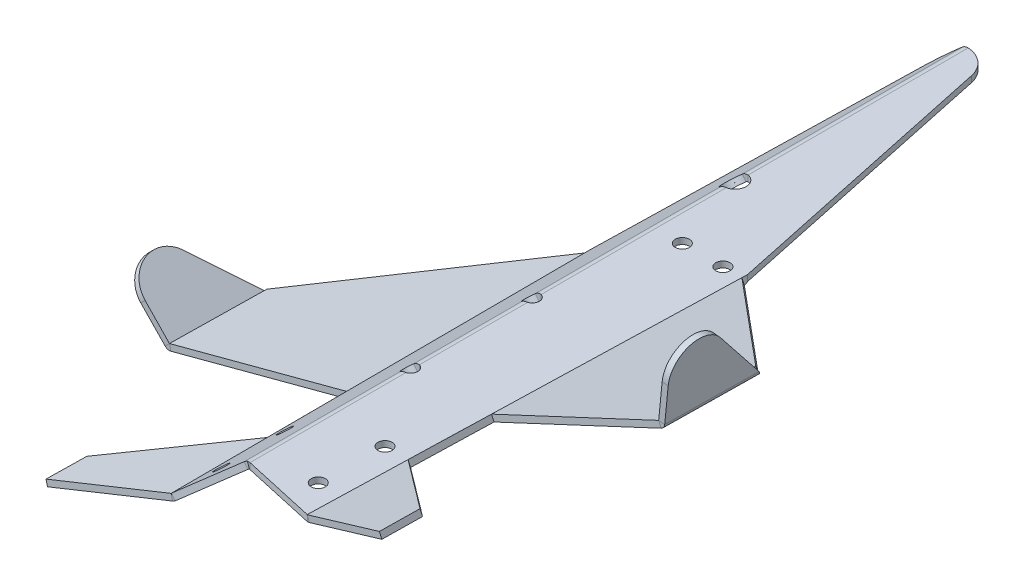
ISO-10303-21;
HEADER;
FILE_DESCRIPTION(('STEP AP214'),'2;1');
FILE_NAME('part.step','',(''),(''),'','','');
FILE_SCHEMA(('AUTOMOTIVE_DESIGN { 1 0 10303 214 1 1 1 1 }'));
ENDSEC;
DATA;
#1=APPLICATION_CONTEXT('core data for automotive mechanical design processes');
#2=APPLICATION_PROTOCOL_DEFINITION('international standard','automotive_design',2000,#1);
#3=PRODUCT_CONTEXT('',#1,'mechanical');
#4=PRODUCT('Part','Part','',(#3));
#5=PRODUCT_RELATED_PRODUCT_CATEGORY('part','',(#4));
#6=PRODUCT_DEFINITION_FORMATION('','',#4);
#7=PRODUCT_DEFINITION_CONTEXT('part definition',#1,'design');
#8=PRODUCT_DEFINITION('design','',#6,#7);
#9=PRODUCT_DEFINITION_SHAPE('','',#8);
#10=(LENGTH_UNIT() NAMED_UNIT(*) SI_UNIT(.MILLI.,.METRE.));
#11=(NAMED_UNIT(*) PLANE_ANGLE_UNIT() SI_UNIT($,.RADIAN.));
#12=(NAMED_UNIT(*) SI_UNIT($,.STERADIAN.) SOLID_ANGLE_UNIT());
#13=UNCERTAINTY_MEASURE_WITH_UNIT(LENGTH_MEASURE(1.E-05),#10,'distance_accuracy_value','');
#14=(GEOMETRIC_REPRESENTATION_CONTEXT(3) GLOBAL_UNCERTAINTY_ASSIGNED_CONTEXT((#13)) GLOBAL_UNIT_ASSIGNED_CONTEXT((#10,
#11,#12)) REPRESENTATION_CONTEXT('',''));
#15=CARTESIAN_POINT('',(0.,0.,0.));
#16=DIRECTION('',(0.,0.,1.));
#17=DIRECTION('',(1.,0.,0.));
#18=AXIS2_PLACEMENT_3D('',#15,#16,#17);
#19=CARTESIAN_POINT('',(-0.120539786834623,1.02030487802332,-120.));
#20=DIRECTION('',(0.342020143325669,-0.939692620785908,0.));
#21=DIRECTION('',(0.939692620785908,0.342020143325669,0.));
#22=AXIS2_PLACEMENT_3D('',#19,#20,#21);
#23=CYLINDRICAL_SURFACE('',#22,0.00500000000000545);
#24=CARTESIAN_POINT('',(-0.120539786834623,1.02030487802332,-120.));
#25=DIRECTION('',(-0.342020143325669,0.939692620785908,0.));
#26=DIRECTION('',(-0.939692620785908,-0.342020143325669,0.));
#27=AXIS2_PLACEMENT_3D('',#24,#25,#26);
#28=CIRCLE('',#27,0.00500000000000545);
#29=CARTESIAN_POINT('',(-0.125238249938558,1.01859477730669,-120.));
#30=VERTEX_POINT('',#29);
#31=EDGE_CURVE('E13',#30,#30,#28,.T.);
#32=ORIENTED_EDGE('',*,*,#31,.F.);
#33=EDGE_LOOP('',(#32));
#34=FACE_BOUND('',#33,.T.);
#35=CARTESIAN_POINT('',(0.221480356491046,0.0806122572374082,-120.));
#36=DIRECTION('',(-0.342020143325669,0.939692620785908,0.));
#37=DIRECTION('',(-0.939692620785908,-0.342020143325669,0.));
#38=AXIS2_PLACEMENT_3D('',#35,#36,#37);
#39=CIRCLE('',#38,0.00500000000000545);
#40=CARTESIAN_POINT('',(0.216781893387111,0.078902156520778,-120.));
#41=VERTEX_POINT('',#40);
#42=EDGE_CURVE('E334',#41,#41,#39,.T.);
#43=ORIENTED_EDGE('',*,*,#42,.T.);
#44=EDGE_LOOP('',(#43));
#45=FACE_BOUND('',#44,.T.);
#46=ADVANCED_FACE('F331',(#34,#45),#23,.T.);
#47=CARTESIAN_POINT('',(-0.120539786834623,1.02030487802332,-120.));
#48=DIRECTION('',(-0.342020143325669,0.939692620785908,0.));
#49=DIRECTION('',(-0.939692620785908,-0.342020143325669,0.));
#50=AXIS2_PLACEMENT_3D('',#47,#48,#49);
#51=PLANE('',#50);
#52=ORIENTED_EDGE('',*,*,#31,.T.);
#53=EDGE_LOOP('',(#52));
#54=FACE_BOUND('',#53,.T.);
#55=ADVANCED_FACE('F346',(#54),#51,.T.);
#56=CARTESIAN_POINT('',(0.221480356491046,0.0806122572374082,-120.));
#57=DIRECTION('',(-0.342020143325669,0.939692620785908,0.));
#58=DIRECTION('',(-0.939692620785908,-0.342020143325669,0.));
#59=AXIS2_PLACEMENT_3D('',#56,#57,#58);
#60=PLANE('',#59);
#61=ORIENTED_EDGE('',*,*,#42,.F.);
#62=EDGE_LOOP('',(#61));
#63=FACE_BOUND('',#62,.T.);
#64=ADVANCED_FACE('F344',(#63),#60,.F.);
#65=CLOSED_SHELL('',(#46,#55,#64));
#66=MANIFOLD_SOLID_BREP('B2',#65);
#67=CARTESIAN_POINT('',(-0.120539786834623,1.02030487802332,-70.));
#68=DIRECTION('',(0.342020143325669,-0.939692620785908,0.));
#69=DIRECTION('',(0.939692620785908,0.342020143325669,0.));
#70=AXIS2_PLACEMENT_3D('',#67,#68,#69);
#71=CYLINDRICAL_SURFACE('',#70,0.00500000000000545);
#72=CARTESIAN_POINT('',(-0.120539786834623,1.02030487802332,-70.));
#73=DIRECTION('',(-0.342020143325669,0.939692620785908,0.));
#74=DIRECTION('',(-0.939692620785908,-0.342020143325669,0.));
#75=AXIS2_PLACEMENT_3D('',#72,#73,#74);
#76=CIRCLE('',#75,0.00500000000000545);
#77=CARTESIAN_POINT('',(-0.125238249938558,1.01859477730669,-70.));
#78=VERTEX_POINT('',#77);
#79=EDGE_CURVE('E330',#78,#78,#76,.T.);
#80=ORIENTED_EDGE('',*,*,#79,.F.);
#81=EDGE_LOOP('',(#80));
#82=FACE_BOUND('',#81,.T.);
#83=CARTESIAN_POINT('',(0.221480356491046,0.0806122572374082,-70.));
#84=DIRECTION('',(-0.342020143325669,0.939692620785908,0.));
#85=DIRECTION('',(-0.939692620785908,-0.342020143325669,0.));
#86=AXIS2_PLACEMENT_3D('',#83,#84,#85);
#87=CIRCLE('',#86,0.00500000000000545);
#88=CARTESIAN_POINT('',(0.216781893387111,0.078902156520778,-70.));
#89=VERTEX_POINT('',#88);
#90=EDGE_CURVE('E382',#89,#89,#87,.T.);
#91=ORIENTED_EDGE('',*,*,#90,.T.);
#92=EDGE_LOOP('',(#91));
#93=FACE_BOUND('',#92,.T.);
#94=ADVANCED_FACE('F379',(#82,#93),#71,.T.);
#95=CARTESIAN_POINT('',(-0.120539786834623,1.02030487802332,-70.));
#96=DIRECTION('',(-0.342020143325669,0.939692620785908,0.));
#97=DIRECTION('',(-0.939692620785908,-0.342020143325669,0.));
#98=AXIS2_PLACEMENT_3D('',#95,#96,#97);
#99=PLANE('',#98);
#100=ORIENTED_EDGE('',*,*,#79,.T.);
#101=EDGE_LOOP('',(#100));
#102=FACE_BOUND('',#101,.T.);
#103=ADVANCED_FACE('F394',(#102),#99,.T.);
#104=CARTESIAN_POINT('',(0.221480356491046,0.0806122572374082,-70.));
#105=DIRECTION('',(-0.342020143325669,0.939692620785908,0.));
#106=DIRECTION('',(-0.939692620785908,-0.342020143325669,0.));
#107=AXIS2_PLACEMENT_3D('',#104,#105,#106);
#108=PLANE('',#107);
#109=ORIENTED_EDGE('',*,*,#90,.F.);
#110=EDGE_LOOP('',(#109));
#111=FACE_BOUND('',#110,.T.);
#112=ADVANCED_FACE('F392',(#111),#108,.F.);
#113=CLOSED_SHELL('',(#94,#103,#112));
#114=MANIFOLD_SOLID_BREP('B8',#113);
#115=CARTESIAN_POINT('',(-0.120539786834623,1.02030487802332,-40.));
#116=DIRECTION('',(0.342020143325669,-0.939692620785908,0.));
#117=DIRECTION('',(0.939692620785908,0.342020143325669,0.));
#118=AXIS2_PLACEMENT_3D('',#115,#116,#117);
#119=CYLINDRICAL_SURFACE('',#118,0.00499999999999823);
#120=CARTESIAN_POINT('',(-0.120539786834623,1.02030487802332,-40.));
#121=DIRECTION('',(-0.342020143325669,0.939692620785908,0.));
#122=DIRECTION('',(-0.939692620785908,-0.342020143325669,0.));
#123=AXIS2_PLACEMENT_3D('',#120,#121,#122);
#124=CIRCLE('',#123,0.00499999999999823);
#125=CARTESIAN_POINT('',(-0.125238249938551,1.01859477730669,-40.));
#126=VERTEX_POINT('',#125);
#127=EDGE_CURVE('E378',#126,#126,#124,.T.);
#128=ORIENTED_EDGE('',*,*,#127,.F.);
#129=EDGE_LOOP('',(#128));
#130=FACE_BOUND('',#129,.T.);
#131=CARTESIAN_POINT('',(0.221480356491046,0.0806122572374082,-40.));
#132=DIRECTION('',(-0.342020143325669,0.939692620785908,0.));
#133=DIRECTION('',(-0.939692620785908,-0.342020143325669,0.));
#134=AXIS2_PLACEMENT_3D('',#131,#132,#133);
#135=CIRCLE('',#134,0.00499999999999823);
#136=CARTESIAN_POINT('',(0.216781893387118,0.0789021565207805,-40.));
#137=VERTEX_POINT('',#136);
#138=EDGE_CURVE('E431',#137,#137,#135,.T.);
#139=ORIENTED_EDGE('',*,*,#138,.T.);
#140=EDGE_LOOP('',(#139));
#141=FACE_BOUND('',#140,.T.);
#142=ADVANCED_FACE('F428',(#130,#141),#119,.T.);
#143=CARTESIAN_POINT('',(-0.120539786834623,1.02030487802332,-40.));
#144=DIRECTION('',(-0.342020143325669,0.939692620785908,0.));
#145=DIRECTION('',(-0.939692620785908,-0.342020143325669,0.));
#146=AXIS2_PLACEMENT_3D('',#143,#144,#145);
#147=PLANE('',#146);
#148=ORIENTED_EDGE('',*,*,#127,.T.);
#149=EDGE_LOOP('',(#148));
#150=FACE_BOUND('',#149,.T.);
#151=ADVANCED_FACE('F443',(#150),#147,.T.);
#152=CARTESIAN_POINT('',(0.221480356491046,0.0806122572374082,-40.));
#153=DIRECTION('',(-0.342020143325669,0.939692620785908,0.));
#154=DIRECTION('',(-0.939692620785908,-0.342020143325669,0.));
#155=AXIS2_PLACEMENT_3D('',#152,#153,#154);
#156=PLANE('',#155);
#157=ORIENTED_EDGE('',*,*,#138,.F.);
#158=EDGE_LOOP('',(#157));
#159=FACE_BOUND('',#158,.T.);
#160=ADVANCED_FACE('F441',(#159),#156,.F.);
#161=CLOSED_SHELL('',(#142,#151,#160));
#162=MANIFOLD_SOLID_BREP('B325',#161);
#163=CARTESIAN_POINT('',(-0.521220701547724,1.31029117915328,0.));
#164=DIRECTION('',(-0.166178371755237,-0.139440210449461,-0.976187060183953));
#165=DIRECTION('',(-0.747802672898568,-0.627480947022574,0.216930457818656));
#166=AXIS2_PLACEMENT_3D('',#163,#164,#165);
#167=PLANE('',#166);
#168=DIRECTION('',(0.747802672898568,0.627480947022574,-0.216930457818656));
#169=VECTOR('',#168,1.);
#170=CARTESIAN_POINT('',(0.442960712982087,0.161224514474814,0.));
#171=LINE('',#170,#169);
#172=CARTESIAN_POINT('',(-13.8586560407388,-11.8392568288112,4.14876327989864));
#173=VERTEX_POINT('',#172);
#174=CARTESIAN_POINT('',(0.0454439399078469,-0.17233166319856,0.115315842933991));
#175=VERTEX_POINT('',#174);
#176=EDGE_CURVE('E1365',#173,#175,#171,.T.);
#177=ORIENTED_EDGE('',*,*,#176,.T.);
#178=CARTESIAN_POINT('',(-0.91873747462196,0.976735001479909,0.115315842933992));
#179=CARTESIAN_POINT('',(0.0454439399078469,-0.17233166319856,0.115315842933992));
#180=B_SPLINE_CURVE_WITH_KNOTS('',1,(#178,#179),.UNSPECIFIED.,.F.,.F.,(2,2),(0.,1.),.UNSPECIFIED.);
#181=CARTESIAN_POINT('',(-0.91873747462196,0.976735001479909,0.115315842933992));
#182=VERTEX_POINT('',#181);
#183=EDGE_CURVE('E1230',#175,#182,#180,.F.);
#184=ORIENTED_EDGE('',*,*,#183,.T.);
#185=DIRECTION('',(0.747802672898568,0.627480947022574,-0.216930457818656));
#186=VECTOR('',#185,1.);
#187=CARTESIAN_POINT('',(-0.521220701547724,1.31029117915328,0.));
#188=LINE('',#187,#186);
#189=CARTESIAN_POINT('',(-14.8228374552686,-10.6901901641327,4.14876327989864));
#190=VERTEX_POINT('',#189);
#191=EDGE_CURVE('E1345',#190,#182,#188,.T.);
#192=ORIENTED_EDGE('',*,*,#191,.F.);
#193=DIRECTION('',(-0.64278760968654,0.766044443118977,0.));
#194=VECTOR('',#193,1.);
#195=CARTESIAN_POINT('',(-14.8228374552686,-10.6901901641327,4.14876327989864));
#196=LINE('',#195,#194);
#197=EDGE_CURVE('E1353',#173,#190,#196,.T.);
#198=ORIENTED_EDGE('',*,*,#197,.F.);
#199=EDGE_LOOP('',(#177,#184,#192,#198));
#200=FACE_BOUND('',#199,.T.);
#201=ADVANCED_FACE('F468',(#200),#167,.F.);
#202=CARTESIAN_POINT('',(-0.521220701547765,1.31029117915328,-170.));
#203=DIRECTION('',(0.642787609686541,-0.766044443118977,0.));
#204=DIRECTION('',(0.,0.,-1.));
#205=AXIS2_PLACEMENT_3D('',#202,#203,#204);
#206=CYLINDRICAL_SURFACE('',#205,7.);
#207=CARTESIAN_POINT('',(-0.521220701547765,1.31029117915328,-170.));
#208=DIRECTION('',(-0.642787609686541,0.766044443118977,0.));
#209=DIRECTION('',(0.,0.,1.));
#210=AXIS2_PLACEMENT_3D('',#207,#208,#209);
#211=CIRCLE('',#210,7.);
#212=CARTESIAN_POINT('',(-0.918737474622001,0.97673500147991,-176.980739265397));
#213=VERTEX_POINT('',#212);
#214=CARTESIAN_POINT('',(-5.7668795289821,-3.09133920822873,-171.452140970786));
#215=VERTEX_POINT('',#214);
#216=EDGE_CURVE('E1367',#213,#215,#211,.T.);
#217=ORIENTED_EDGE('',*,*,#216,.F.);
#218=DIRECTION('',(0.642787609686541,-0.766044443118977,0.));
#219=VECTOR('',#218,1.);
#220=CARTESIAN_POINT('',(-0.918737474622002,0.976735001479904,-176.980739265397));
#221=LINE('',#220,#219);
#222=CARTESIAN_POINT('',(0.0454439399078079,-0.172331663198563,-176.980739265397));
#223=VERTEX_POINT('',#222);
#224=EDGE_CURVE('E426',#213,#223,#221,.T.);
#225=ORIENTED_EDGE('',*,*,#224,.T.);
#226=CARTESIAN_POINT('',(0.442960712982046,0.161224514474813,-170.));
#227=DIRECTION('',(-0.642787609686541,0.766044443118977,0.));
#228=DIRECTION('',(0.,0.,1.));
#229=AXIS2_PLACEMENT_3D('',#226,#227,#228);
#230=CIRCLE('',#229,7.);
#231=CARTESIAN_POINT('',(-4.80269811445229,-4.2404058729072,-171.452140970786));
#232=VERTEX_POINT('',#231);
#233=EDGE_CURVE('E1374',#223,#232,#230,.T.);
#234=ORIENTED_EDGE('',*,*,#233,.T.);
#235=DIRECTION('',(0.642787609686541,-0.766044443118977,0.));
#236=VECTOR('',#235,1.);
#237=CARTESIAN_POINT('',(-5.7668795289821,-3.09133920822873,-171.452140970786));
#238=LINE('',#237,#236);
#239=EDGE_CURVE('E1349',#215,#232,#238,.T.);
#240=ORIENTED_EDGE('',*,*,#239,.F.);
#241=EDGE_LOOP('',(#217,#225,#234,#240));
#242=FACE_BOUND('',#241,.T.);
#243=ADVANCED_FACE('F1201',(#242),#206,.T.);
#244=CARTESIAN_POINT('',(56.9321125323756,49.5193619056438,-47.));
#245=DIRECTION('',(0.642787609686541,-0.766044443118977,0.));
#246=DIRECTION('',(0.,0.,-1.));
#247=AXIS2_PLACEMENT_3D('',#244,#245,#246);
#248=PLANE('',#247);
#249=CARTESIAN_POINT('',(-10.6591973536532,-7.1964812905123,-4.));
#250=DIRECTION('',(-0.642787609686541,0.766044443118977,0.));
#251=DIRECTION('',(0.,0.,1.));
#252=AXIS2_PLACEMENT_3D('',#249,#250,#251);
#253=CIRCLE('',#252,1.75);
#254=CARTESIAN_POINT('',(-10.6591973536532,-7.1964812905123,-2.25));
#255=VERTEX_POINT('',#254);
#256=EDGE_CURVE('E1452',#255,#255,#253,.T.);
#257=ORIENTED_EDGE('',*,*,#256,.F.);
#258=EDGE_LOOP('',(#257));
#259=FACE_BOUND('',#258,.T.);
#260=CARTESIAN_POINT('',(-11.0120024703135,-7.49251993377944,-20.));
#261=DIRECTION('',(-0.642787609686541,0.766044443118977,0.));
#262=DIRECTION('',(0.,0.,1.));
#263=AXIS2_PLACEMENT_3D('',#260,#261,#262);
#264=CIRCLE('',#263,1.75);
#265=CARTESIAN_POINT('',(-11.0120024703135,-7.49251993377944,-18.25));
#266=VERTEX_POINT('',#265);
#267=EDGE_CURVE('E1418',#266,#266,#264,.T.);
#268=ORIENTED_EDGE('',*,*,#267,.F.);
#269=EDGE_LOOP('',(#268));
#270=FACE_BOUND('',#269,.T.);
#271=ORIENTED_EDGE('',*,*,#191,.T.);
#272=DIRECTION('',(0.,0.,-1.));
#273=VECTOR('',#272,1.);
#274=CARTESIAN_POINT('',(-0.918737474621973,0.976735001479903,-47.));
#275=LINE('',#274,#273);
#276=CARTESIAN_POINT('',(-0.91873747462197,0.976735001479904,-38.3287068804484));
#277=VERTEX_POINT('',#276);
#278=EDGE_CURVE('E1356',#182,#277,#275,.T.);
#279=ORIENTED_EDGE('',*,*,#278,.T.);
#280=CARTESIAN_POINT('',(-0.521220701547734,1.31029117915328,-40.));
#281=DIRECTION('',(-0.642787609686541,0.766044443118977,0.));
#282=DIRECTION('',(0.,0.,1.));
#283=AXIS2_PLACEMENT_3D('',#280,#281,#282);
#284=CIRCLE('',#283,1.75);
#285=CARTESIAN_POINT('',(-0.918737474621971,0.976735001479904,-41.6712931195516));
#286=VERTEX_POINT('',#285);
#287=EDGE_CURVE('E1240',#286,#277,#284,.T.);
#288=ORIENTED_EDGE('',*,*,#287,.F.);
#289=DIRECTION('',(0.,0.,-1.));
#290=VECTOR('',#289,1.);
#291=CARTESIAN_POINT('',(-0.918737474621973,0.976735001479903,-47.));
#292=LINE('',#291,#290);
#293=CARTESIAN_POINT('',(-0.918737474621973,0.976735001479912,-68.3287068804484));
#294=VERTEX_POINT('',#293);
#295=EDGE_CURVE('E806',#286,#294,#292,.T.);
#296=ORIENTED_EDGE('',*,*,#295,.T.);
#297=CARTESIAN_POINT('',(-0.521220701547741,1.31029117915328,-70.));
#298=DIRECTION('',(-0.642787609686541,0.766044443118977,0.));
#299=DIRECTION('',(0.,0.,1.));
#300=AXIS2_PLACEMENT_3D('',#297,#298,#299);
#301=CIRCLE('',#300,1.75);
#302=CARTESIAN_POINT('',(-0.918737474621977,0.976735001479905,-71.6712931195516));
#303=VERTEX_POINT('',#302);
#304=EDGE_CURVE('E1333',#303,#294,#301,.T.);
#305=ORIENTED_EDGE('',*,*,#304,.F.);
#306=DIRECTION('',(0.,0.,-1.));
#307=VECTOR('',#306,1.);
#308=CARTESIAN_POINT('',(-0.918737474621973,0.976735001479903,-47.));
#309=LINE('',#308,#307);
#310=CARTESIAN_POINT('',(-0.918737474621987,0.97673500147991,-117.299403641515));
#311=VERTEX_POINT('',#310);
#312=EDGE_CURVE('E1710',#303,#311,#309,.T.);
#313=ORIENTED_EDGE('',*,*,#312,.T.);
#314=CARTESIAN_POINT('',(-0.521220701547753,1.31029117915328,-120.));
#315=DIRECTION('',(-0.642787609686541,0.766044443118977,0.));
#316=DIRECTION('',(0.,0.,1.));
#317=AXIS2_PLACEMENT_3D('',#314,#315,#316);
#318=CIRCLE('',#317,2.75);
#319=CARTESIAN_POINT('',(-0.918737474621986,0.976735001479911,-122.700596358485));
#320=VERTEX_POINT('',#319);
#321=EDGE_CURVE('E1332',#320,#311,#318,.T.);
#322=ORIENTED_EDGE('',*,*,#321,.F.);
#323=DIRECTION('',(0.,0.,-1.));
#324=VECTOR('',#323,1.);
#325=CARTESIAN_POINT('',(-0.918737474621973,0.976735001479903,-47.));
#326=LINE('',#325,#324);
#327=EDGE_CURVE('E1287',#320,#213,#326,.T.);
#328=ORIENTED_EDGE('',*,*,#327,.T.);
#329=ORIENTED_EDGE('',*,*,#216,.T.);
#330=DIRECTION('',(-0.158914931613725,-0.13334546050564,0.978245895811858));
#331=VECTOR('',#330,1.);
#332=CARTESIAN_POINT('',(-17.3741984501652,-12.8310362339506,-100.));
#333=LINE('',#332,#331);
#334=CARTESIAN_POINT('',(-17.1498089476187,-12.6427510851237,-101.381293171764));
#335=VERTEX_POINT('',#334);
#336=EDGE_CURVE('E1350',#215,#335,#333,.T.);
#337=ORIENTED_EDGE('',*,*,#336,.T.);
#338=DIRECTION('',(-0.0220411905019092,-0.01849475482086,-0.999585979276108));
#339=VECTOR('',#338,1.);
#340=CARTESIAN_POINT('',(-15.8903465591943,-11.5859366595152,-44.2636458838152));
#341=LINE('',#340,#339);
#342=CARTESIAN_POINT('',(-17.1200433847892,-12.6177748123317,-100.031400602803));
#343=VERTEX_POINT('',#342);
#344=EDGE_CURVE('E1435',#343,#335,#341,.T.);
#345=ORIENTED_EDGE('',*,*,#344,.F.);
#346=DIRECTION('',(-0.0220411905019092,-0.01849475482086,-0.999585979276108));
#347=VECTOR('',#346,1.);
#348=CARTESIAN_POINT('',(-15.8903465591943,-11.5859366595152,-44.2636458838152));
#349=LINE('',#348,#347);
#350=EDGE_CURVE('E1351',#190,#343,#349,.T.);
#351=ORIENTED_EDGE('',*,*,#350,.F.);
#352=EDGE_LOOP('',(#271,#279,#288,#296,#305,#313,#322,#328,#329,#337,#345,#351));
#353=FACE_BOUND('',#352,.T.);
#354=ADVANCED_FACE('F1207',(#259,#270,#353),#248,.F.);
#355=CARTESIAN_POINT('',(57.8962939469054,48.3702952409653,-47.));
#356=DIRECTION('',(0.642787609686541,-0.766044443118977,0.));
#357=DIRECTION('',(0.,0.,-1.));
#358=AXIS2_PLACEMENT_3D('',#355,#356,#357);
#359=PLANE('',#358);
#360=DIRECTION('',(0.,0.,-1.));
#361=VECTOR('',#360,1.);
#362=CARTESIAN_POINT('',(0.0454439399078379,-0.172331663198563,-47.));
#363=LINE('',#362,#361);
#364=CARTESIAN_POINT('',(0.0454439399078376,-0.17233166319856,-38.3287068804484));
#365=VERTEX_POINT('',#364);
#366=EDGE_CURVE('E1222',#175,#365,#363,.T.);
#367=ORIENTED_EDGE('',*,*,#366,.F.);
#368=ORIENTED_EDGE('',*,*,#176,.F.);
#369=DIRECTION('',(-0.0220411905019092,-0.01849475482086,-0.999585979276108));
#370=VECTOR('',#369,1.);
#371=CARTESIAN_POINT('',(-14.9261651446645,-12.7350033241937,-44.2636458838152));
#372=LINE('',#371,#370);
#373=CARTESIAN_POINT('',(-16.1856275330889,-13.7918177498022,-101.381293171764));
#374=VERTEX_POINT('',#373);
#375=EDGE_CURVE('E1357',#173,#374,#372,.T.);
#376=ORIENTED_EDGE('',*,*,#375,.T.);
#377=DIRECTION('',(-0.158914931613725,-0.13334546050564,0.978245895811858));
#378=VECTOR('',#377,1.);
#379=CARTESIAN_POINT('',(-16.4100170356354,-13.9801028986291,-100.));
#380=LINE('',#379,#378);
#381=EDGE_CURVE('E1368',#232,#374,#380,.T.);
#382=ORIENTED_EDGE('',*,*,#381,.F.);
#383=ORIENTED_EDGE('',*,*,#233,.F.);
#384=DIRECTION('',(0.,0.,-1.));
#385=VECTOR('',#384,1.);
#386=CARTESIAN_POINT('',(0.0454439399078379,-0.172331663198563,-47.));
#387=LINE('',#386,#385);
#388=CARTESIAN_POINT('',(0.045443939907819,-0.172331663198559,-122.700596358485));
#389=VERTEX_POINT('',#388);
#390=EDGE_CURVE('E479',#389,#223,#387,.T.);
#391=ORIENTED_EDGE('',*,*,#390,.F.);
#392=CARTESIAN_POINT('',(0.442960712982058,0.161224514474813,-120.));
#393=DIRECTION('',(-0.642787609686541,0.766044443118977,0.));
#394=DIRECTION('',(0.,0.,1.));
#395=AXIS2_PLACEMENT_3D('',#392,#393,#394);
#396=CIRCLE('',#395,2.75);
#397=CARTESIAN_POINT('',(0.0454439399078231,-0.172331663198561,-117.299403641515));
#398=VERTEX_POINT('',#397);
#399=EDGE_CURVE('E493',#389,#398,#396,.T.);
#400=ORIENTED_EDGE('',*,*,#399,.T.);
#401=DIRECTION('',(0.,0.,-1.));
#402=VECTOR('',#401,1.);
#403=CARTESIAN_POINT('',(0.0454439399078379,-0.172331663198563,-47.));
#404=LINE('',#403,#402);
#405=CARTESIAN_POINT('',(0.0454439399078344,-0.172331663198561,-71.6712931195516));
#406=VERTEX_POINT('',#405);
#407=EDGE_CURVE('E1321',#406,#398,#404,.T.);
#408=ORIENTED_EDGE('',*,*,#407,.F.);
#409=CARTESIAN_POINT('',(0.44296071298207,0.161224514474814,-70.));
#410=DIRECTION('',(-0.642787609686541,0.766044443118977,0.));
#411=DIRECTION('',(0.,0.,1.));
#412=AXIS2_PLACEMENT_3D('',#409,#410,#411);
#413=CIRCLE('',#412,1.75);
#414=CARTESIAN_POINT('',(0.0454439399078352,-0.172331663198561,-68.3287068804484));
#415=VERTEX_POINT('',#414);
#416=EDGE_CURVE('E1337',#406,#415,#413,.T.);
#417=ORIENTED_EDGE('',*,*,#416,.T.);
#418=DIRECTION('',(0.,0.,-1.));
#419=VECTOR('',#418,1.);
#420=CARTESIAN_POINT('',(0.0454439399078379,-0.172331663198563,-47.));
#421=LINE('',#420,#419);
#422=CARTESIAN_POINT('',(0.0454439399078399,-0.172331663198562,-41.6712931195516));
#423=VERTEX_POINT('',#422);
#424=EDGE_CURVE('E1250',#423,#415,#421,.T.);
#425=ORIENTED_EDGE('',*,*,#424,.F.);
#426=CARTESIAN_POINT('',(0.442960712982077,0.161224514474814,-40.));
#427=DIRECTION('',(-0.642787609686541,0.766044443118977,0.));
#428=DIRECTION('',(0.,0.,1.));
#429=AXIS2_PLACEMENT_3D('',#426,#427,#428);
#430=CIRCLE('',#429,1.75);
#431=EDGE_CURVE('E1238',#423,#365,#430,.T.);
#432=ORIENTED_EDGE('',*,*,#431,.T.);
#433=EDGE_LOOP('',(#367,#368,#376,#382,#383,#391,#400,#408,#417,#425,#432));
#434=FACE_BOUND('',#433,.T.);
#435=CARTESIAN_POINT('',(-10.0478210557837,-8.64158659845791,-20.));
#436=DIRECTION('',(-0.642787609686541,0.766044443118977,0.));
#437=DIRECTION('',(0.,0.,1.));
#438=AXIS2_PLACEMENT_3D('',#435,#436,#437);
#439=CIRCLE('',#438,1.75);
#440=CARTESIAN_POINT('',(-10.0478210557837,-8.64158659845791,-18.25));
#441=VERTEX_POINT('',#440);
#442=EDGE_CURVE('E2592',#441,#441,#439,.T.);
#443=ORIENTED_EDGE('',*,*,#442,.T.);
#444=EDGE_LOOP('',(#443));
#445=FACE_BOUND('',#444,.T.);
#446=CARTESIAN_POINT('',(-9.69501593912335,-8.34554795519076,-4.));
#447=DIRECTION('',(-0.642787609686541,0.766044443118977,0.));
#448=DIRECTION('',(0.,0.,1.));
#449=AXIS2_PLACEMENT_3D('',#446,#447,#448);
#450=CIRCLE('',#449,1.75);
#451=CARTESIAN_POINT('',(-9.69501593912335,-8.34554795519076,-2.25));
#452=VERTEX_POINT('',#451);
#453=EDGE_CURVE('E1335',#452,#452,#450,.T.);
#454=ORIENTED_EDGE('',*,*,#453,.T.);
#455=EDGE_LOOP('',(#454));
#456=FACE_BOUND('',#455,.T.);
#457=ADVANCED_FACE('F1214',(#434,#445,#456),#359,.T.);
#458=CARTESIAN_POINT('',(-17.3741984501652,-12.8310362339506,-100.));
#459=DIRECTION('',(0.749379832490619,0.628804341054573,0.207448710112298));
#460=DIRECTION('',(0.158914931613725,0.13334546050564,-0.978245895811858));
#461=AXIS2_PLACEMENT_3D('',#458,#459,#460);
#462=PLANE('',#461);
#463=DIRECTION('',(0.642787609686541,-0.766044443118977,0.));
#464=VECTOR('',#463,1.);
#465=CARTESIAN_POINT('',(-17.1498089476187,-12.6427510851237,-101.381293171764));
#466=LINE('',#465,#464);
#467=EDGE_CURVE('E1362',#335,#374,#466,.T.);
#468=ORIENTED_EDGE('',*,*,#467,.F.);
#469=ORIENTED_EDGE('',*,*,#336,.F.);
#470=ORIENTED_EDGE('',*,*,#239,.T.);
#471=ORIENTED_EDGE('',*,*,#381,.T.);
#472=EDGE_LOOP('',(#468,#469,#470,#471));
#473=FACE_BOUND('',#472,.T.);
#474=ADVANCED_FACE('F1277',(#473),#462,.F.);
#475=CARTESIAN_POINT('',(-11.0120024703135,-7.49251993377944,-20.));
#476=DIRECTION('',(0.642787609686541,-0.766044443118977,0.));
#477=DIRECTION('',(0.,0.,-1.));
#478=AXIS2_PLACEMENT_3D('',#475,#476,#477);
#479=CYLINDRICAL_SURFACE('',#478,1.75);
#480=ORIENTED_EDGE('',*,*,#267,.T.);
#481=EDGE_LOOP('',(#480));
#482=FACE_BOUND('',#481,.T.);
#483=ORIENTED_EDGE('',*,*,#442,.F.);
#484=EDGE_LOOP('',(#483));
#485=FACE_BOUND('',#484,.T.);
#486=ADVANCED_FACE('F2442',(#482,#485),#479,.F.);
#487=CARTESIAN_POINT('',(-10.6591973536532,-7.1964812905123,-4.));
#488=DIRECTION('',(0.642787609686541,-0.766044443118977,0.));
#489=DIRECTION('',(0.,0.,-1.));
#490=AXIS2_PLACEMENT_3D('',#487,#488,#489);
#491=CYLINDRICAL_SURFACE('',#490,1.75);
#492=ORIENTED_EDGE('',*,*,#256,.T.);
#493=EDGE_LOOP('',(#492));
#494=FACE_BOUND('',#493,.T.);
#495=ORIENTED_EDGE('',*,*,#453,.F.);
#496=EDGE_LOOP('',(#495));
#497=FACE_BOUND('',#496,.T.);
#498=ADVANCED_FACE('F1313',(#494,#497),#491,.F.);
#499=CARTESIAN_POINT('',(-0.521220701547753,1.31029117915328,-120.));
#500=DIRECTION('',(0.642787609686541,-0.766044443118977,0.));
#501=DIRECTION('',(0.,0.,-1.));
#502=AXIS2_PLACEMENT_3D('',#499,#500,#501);
#503=CYLINDRICAL_SURFACE('',#502,2.75);
#504=CARTESIAN_POINT('',(-0.918737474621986,0.976735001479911,-122.700596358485));
#505=CARTESIAN_POINT('',(0.0454439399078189,-0.172331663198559,-122.700596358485));
#506=B_SPLINE_CURVE_WITH_KNOTS('',1,(#504,#505),.UNSPECIFIED.,.F.,.F.,(2,2),(0.,1.),.UNSPECIFIED.);
#507=EDGE_CURVE('E1295',#320,#389,#506,.T.);
#508=ORIENTED_EDGE('',*,*,#507,.F.);
#509=ORIENTED_EDGE('',*,*,#321,.T.);
#510=CARTESIAN_POINT('',(0.0454439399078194,-0.17233166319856,-117.299403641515));
#511=CARTESIAN_POINT('',(-0.918737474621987,0.97673500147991,-117.299403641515));
#512=B_SPLINE_CURVE_WITH_KNOTS('',1,(#510,#511),.UNSPECIFIED.,.F.,.F.,(2,2),(0.,1.),.UNSPECIFIED.);
#513=EDGE_CURVE('E1296',#398,#311,#512,.T.);
#514=ORIENTED_EDGE('',*,*,#513,.F.);
#515=ORIENTED_EDGE('',*,*,#399,.F.);
#516=EDGE_LOOP('',(#508,#509,#514,#515));
#517=FACE_BOUND('',#516,.T.);
#518=ADVANCED_FACE('F1276',(#517),#503,.F.);
#519=CARTESIAN_POINT('',(-0.521220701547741,1.31029117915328,-70.));
#520=DIRECTION('',(0.642787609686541,-0.766044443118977,0.));
#521=DIRECTION('',(0.,0.,-1.));
#522=AXIS2_PLACEMENT_3D('',#519,#520,#521);
#523=CYLINDRICAL_SURFACE('',#522,1.75);
#524=CARTESIAN_POINT('',(-0.918737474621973,0.976735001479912,-71.6712931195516));
#525=CARTESIAN_POINT('',(0.0454439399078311,-0.172331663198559,-71.6712931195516));
#526=B_SPLINE_CURVE_WITH_KNOTS('',1,(#524,#525),.UNSPECIFIED.,.F.,.F.,(2,2),(0.,1.),.UNSPECIFIED.);
#527=EDGE_CURVE('E1329',#303,#406,#526,.T.);
#528=ORIENTED_EDGE('',*,*,#527,.F.);
#529=ORIENTED_EDGE('',*,*,#304,.T.);
#530=CARTESIAN_POINT('',(0.0454439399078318,-0.172331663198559,-68.3287068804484));
#531=CARTESIAN_POINT('',(-0.918737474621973,0.976735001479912,-68.3287068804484));
#532=B_SPLINE_CURVE_WITH_KNOTS('',1,(#530,#531),.UNSPECIFIED.,.F.,.F.,(2,2),(0.,1.),.UNSPECIFIED.);
#533=EDGE_CURVE('E1260',#415,#294,#532,.T.);
#534=ORIENTED_EDGE('',*,*,#533,.F.);
#535=ORIENTED_EDGE('',*,*,#416,.F.);
#536=EDGE_LOOP('',(#528,#529,#534,#535));
#537=FACE_BOUND('',#536,.T.);
#538=ADVANCED_FACE('F1267',(#537),#523,.F.);
#539=CARTESIAN_POINT('',(-0.521220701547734,1.31029117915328,-40.));
#540=DIRECTION('',(0.642787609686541,-0.766044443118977,0.));
#541=DIRECTION('',(0.,0.,-1.));
#542=AXIS2_PLACEMENT_3D('',#539,#540,#541);
#543=CYLINDRICAL_SURFACE('',#542,1.75);
#544=CARTESIAN_POINT('',(-0.918737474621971,0.976735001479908,-41.6712931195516));
#545=CARTESIAN_POINT('',(0.0454439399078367,-0.17233166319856,-41.6712931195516));
#546=B_SPLINE_CURVE_WITH_KNOTS('',1,(#544,#545),.UNSPECIFIED.,.F.,.F.,(2,2),(0.,1.),.UNSPECIFIED.);
#547=EDGE_CURVE('E1246',#286,#423,#546,.T.);
#548=ORIENTED_EDGE('',*,*,#547,.F.);
#549=ORIENTED_EDGE('',*,*,#287,.T.);
#550=CARTESIAN_POINT('',(0.0454439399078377,-0.17233166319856,-38.3287068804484));
#551=CARTESIAN_POINT('',(-0.91873747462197,0.976735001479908,-38.3287068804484));
#552=B_SPLINE_CURVE_WITH_KNOTS('',1,(#550,#551),.UNSPECIFIED.,.F.,.F.,(2,2),(0.,1.),.UNSPECIFIED.);
#553=EDGE_CURVE('E1229',#365,#277,#552,.T.);
#554=ORIENTED_EDGE('',*,*,#553,.F.);
#555=ORIENTED_EDGE('',*,*,#431,.F.);
#556=EDGE_LOOP('',(#548,#549,#554,#555));
#557=FACE_BOUND('',#556,.T.);
#558=ADVANCED_FACE('F470',(#557),#543,.F.);
#559=CARTESIAN_POINT('',(-14.8228374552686,-10.6901901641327,4.14876327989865));
#560=CARTESIAN_POINT('',(-14.5014436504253,-11.0732123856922,4.14876327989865));
#561=CARTESIAN_POINT('',(-14.1800498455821,-11.4562346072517,4.14876327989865));
#562=CARTESIAN_POINT('',(-13.8586560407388,-11.8392568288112,4.14876327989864));
#563=CARTESIAN_POINT('',(-14.82237532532,-10.6898023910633,4.16972125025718));
#564=CARTESIAN_POINT('',(-14.5566667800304,-11.1195500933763,4.17181366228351));
#565=CARTESIAN_POINT('',(-14.2909582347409,-11.5492977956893,4.17390607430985));
#566=CARTESIAN_POINT('',(-14.0252496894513,-11.9790454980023,4.17599848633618));
#567=CARTESIAN_POINT('',(-14.8219131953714,-10.6894146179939,4.19067922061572));
#568=CARTESIAN_POINT('',(-14.6222134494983,-11.1535169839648,4.19486279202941));
#569=CARTESIAN_POINT('',(-14.4225137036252,-11.6176193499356,4.19904636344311));
#570=CARTESIAN_POINT('',(-14.2228139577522,-12.0817217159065,4.2032299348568));
#571=CARTESIAN_POINT('',(-14.8214510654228,-10.6890268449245,4.21163719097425));
#572=CARTESIAN_POINT('',(-14.6919745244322,-11.1719335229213,4.2177171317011));
#573=CARTESIAN_POINT('',(-14.5624979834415,-11.654840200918,4.22379707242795));
#574=CARTESIAN_POINT('',(-14.4330214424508,-12.1377468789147,4.2298770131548));
#575=B_SPLINE_SURFACE_WITH_KNOTS('',3,3,((#559,#560,#561,#562),(#563,#564,#565,#566),(#567,#568,
#569,#570),(#571,#572,#573,#574)),.UNSPECIFIED.,.F.,.F.,.F.,(4,4),(4,4),(0.,1.),(0.,1.),.UNSPECIFIED.);
#576=DIRECTION('',(-0.0220411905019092,-0.01849475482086,-0.999585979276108));
#577=VECTOR('',#576,1.);
#578=CARTESIAN_POINT('',(-15.8903465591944,-11.5859366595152,-44.2636458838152));
#579=LINE('',#578,#577);
#580=CARTESIAN_POINT('',(-14.8214510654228,-10.6890268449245,4.21163719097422));
#581=VERTEX_POINT('',#580);
#582=EDGE_CURVE('E1399',#581,#190,#579,.T.);
#583=DIRECTION('',(-0.258953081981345,0.965813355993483,-0.012159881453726));
#584=VECTOR('',#583,1.);
#585=CARTESIAN_POINT('',(-14.8214510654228,-10.6890268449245,4.21163719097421));
#586=LINE('',#585,#584);
#587=CARTESIAN_POINT('',(-14.4330214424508,-12.1377468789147,4.2298770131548));
#588=VERTEX_POINT('',#587);
#589=EDGE_CURVE('E1408',#588,#581,#586,.T.);
#590=CARTESIAN_POINT('',(-14.4330214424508,-12.1377468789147,4.2298770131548));
#591=CARTESIAN_POINT('',(-14.2228139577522,-12.0817217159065,4.2032299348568));
#592=CARTESIAN_POINT('',(-14.0252496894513,-11.9790454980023,4.17599848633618));
#593=CARTESIAN_POINT('',(-13.8586560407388,-11.8392568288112,4.14876327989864));
#594=B_SPLINE_CURVE_WITH_KNOTS('',3,(#590,#591,#592,#593),.UNSPECIFIED.,.F.,.F.,(4,4),(0.,1.),.UNSPECIFIED.);
#595=EDGE_CURVE('E1439',#173,#588,#594,.F.);
#596=ORIENTED_EDGE('',*,*,#582,.F.);
#597=ORIENTED_EDGE('',*,*,#589,.F.);
#598=ORIENTED_EDGE('',*,*,#595,.F.);
#599=ORIENTED_EDGE('',*,*,#197,.T.);
#600=EDGE_LOOP('',(#596,#597,#598,#599));
#601=FACE_BOUND('',#600,.T.);
#602=ADVANCED_FACE('F1485',(#601),#575,.T.);
#603=CARTESIAN_POINT('',(-17.1200433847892,-12.6177748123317,-100.031400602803));
#604=CARTESIAN_POINT('',(-16.9905668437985,-13.1006814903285,-100.025320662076));
#605=CARTESIAN_POINT('',(-16.8610903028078,-13.5835881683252,-100.019240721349));
#606=CARTESIAN_POINT('',(-16.7316137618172,-14.0664948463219,-100.013160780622));
#607=CARTESIAN_POINT('',(-17.1299652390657,-12.6261002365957,-100.481364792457));
#608=CARTESIAN_POINT('',(-16.9302654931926,-13.0902026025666,-100.477181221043));
#609=CARTESIAN_POINT('',(-16.7305657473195,-13.5543049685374,-100.472997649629));
#610=CARTESIAN_POINT('',(-16.5308660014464,-14.0184073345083,-100.468814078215));
#611=CARTESIAN_POINT('',(-17.1398870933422,-12.6344256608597,-100.931328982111));
#612=CARTESIAN_POINT('',(-16.8741785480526,-13.0641733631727,-100.929236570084));
#613=CARTESIAN_POINT('',(-16.608470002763,-13.4939210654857,-100.927144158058));
#614=CARTESIAN_POINT('',(-16.3427614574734,-13.9236687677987,-100.925051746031));
#615=CARTESIAN_POINT('',(-17.1498089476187,-12.6427510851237,-101.381293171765));
#616=CARTESIAN_POINT('',(-16.8284151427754,-13.0257733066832,-101.381293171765));
#617=CARTESIAN_POINT('',(-16.5070213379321,-13.4087955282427,-101.381293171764));
#618=CARTESIAN_POINT('',(-16.1856275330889,-13.7918177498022,-101.381293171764));
#619=B_SPLINE_SURFACE_WITH_KNOTS('',3,3,((#603,#604,#605,#606),(#607,#608,#609,#610),(#611,#612,
#613,#614),(#615,#616,#617,#618)),.UNSPECIFIED.,.F.,.F.,.F.,(4,4),(4,4),(0.,1.),(0.,1.),.UNSPECIFIED.);
#620=CARTESIAN_POINT('',(-16.1856275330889,-13.7918177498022,-101.381293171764));
#621=CARTESIAN_POINT('',(-16.3427614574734,-13.9236687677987,-100.925051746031));
#622=CARTESIAN_POINT('',(-16.5308660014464,-14.0184073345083,-100.468814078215));
#623=CARTESIAN_POINT('',(-16.7316137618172,-14.0664948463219,-100.013160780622));
#624=B_SPLINE_CURVE_WITH_KNOTS('',3,(#620,#621,#622,#623),.UNSPECIFIED.,.F.,.F.,(4,4),(0.,1.),.UNSPECIFIED.);
#625=CARTESIAN_POINT('',(-16.7316137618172,-14.0664948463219,-100.013160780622));
#626=VERTEX_POINT('',#625);
#627=EDGE_CURVE('E1442',#626,#374,#624,.F.);
#628=DIRECTION('',(0.258953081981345,-0.965813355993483,0.012159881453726));
#629=VECTOR('',#628,1.);
#630=CARTESIAN_POINT('',(-17.1200433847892,-12.6177748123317,-100.031400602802));
#631=LINE('',#630,#629);
#632=EDGE_CURVE('E1388',#343,#626,#631,.T.);
#633=ORIENTED_EDGE('',*,*,#344,.T.);
#634=ORIENTED_EDGE('',*,*,#467,.T.);
#635=ORIENTED_EDGE('',*,*,#627,.F.);
#636=ORIENTED_EDGE('',*,*,#632,.F.);
#637=EDGE_LOOP('',(#633,#634,#635,#636));
#638=FACE_BOUND('',#637,.T.);
#639=ADVANCED_FACE('F1436',(#638),#619,.T.);
#640=CARTESIAN_POINT('',(-17.1498089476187,-12.6427510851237,-101.381293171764));
#641=DIRECTION('',(-0.0220411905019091,-0.01849475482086,-0.999585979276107));
#642=DIRECTION('',(0.642787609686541,-0.766044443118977,0.));
#643=AXIS2_PLACEMENT_3D('',#640,#641,#642);
#644=CYLINDRICAL_SURFACE('',#643,1.5);
#645=DIRECTION('',(-0.0220411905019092,-0.01849475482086,-0.999585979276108));
#646=VECTOR('',#645,1.);
#647=CARTESIAN_POINT('',(-15.5019169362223,-13.0346566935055,-44.2454060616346));
#648=LINE('',#647,#646);
#649=EDGE_CURVE('E1380',#588,#626,#648,.T.);
#650=ORIENTED_EDGE('',*,*,#649,.T.);
#651=ORIENTED_EDGE('',*,*,#627,.T.);
#652=ORIENTED_EDGE('',*,*,#375,.F.);
#653=ORIENTED_EDGE('',*,*,#595,.T.);
#654=EDGE_LOOP('',(#650,#651,#652,#653));
#655=FACE_BOUND('',#654,.T.);
#656=ADVANCED_FACE('F1467',(#655),#644,.T.);
#657=CARTESIAN_POINT('',(39.3832748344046,-124.34144033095,-45.4459522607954));
#658=DIRECTION('',(-0.706993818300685,-0.707209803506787,0.00374629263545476));
#659=DIRECTION('',(0.00575198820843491,-0.0110471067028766,-0.99992243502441));
#660=AXIS2_PLACEMENT_3D('',#657,#658,#659);
#661=PLANE('',#660);
#662=DIRECTION('',(-0.548249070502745,0.551412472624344,0.628782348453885));
#663=VECTOR('',#662,1.);
#664=CARTESIAN_POINT('',(-28.9099142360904,-56.3559461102,-99.5940168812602));
#665=LINE('',#664,#663);
#666=CARTESIAN_POINT('',(-60.5158189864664,-24.5676750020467,-63.3454647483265));
#667=VERTEX_POINT('',#666);
#668=CARTESIAN_POINT('',(-69.8234028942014,-15.2063862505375,-52.6706733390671));
#669=VERTEX_POINT('',#668);
#670=EDGE_CURVE('E1587',#667,#669,#665,.T.);
#671=ORIENTED_EDGE('',*,*,#670,.F.);
#672=DIRECTION('',(-0.00575198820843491,0.0110471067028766,0.99992243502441));
#673=VECTOR('',#672,1.);
#674=CARTESIAN_POINT('',(-60.609123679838,-24.3884766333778,-47.1254286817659));
#675=LINE('',#674,#673);
#676=CARTESIAN_POINT('',(-60.649387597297,-24.3111468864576,-40.125971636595));
#677=VERTEX_POINT('',#676);
#678=EDGE_CURVE('E1382',#667,#677,#675,.T.);
#679=ORIENTED_EDGE('',*,*,#678,.T.);
#680=DIRECTION('',(0.707196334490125,-0.706917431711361,0.0118780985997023));
#681=VECTOR('',#680,1.);
#682=CARTESIAN_POINT('',(-28.0336496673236,-56.9140218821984,-39.5781563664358));
#683=LINE('',#682,#681);
#684=CARTESIAN_POINT('',(-66.7364392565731,-18.2264958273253,-40.2282100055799));
#685=VERTEX_POINT('',#684);
#686=EDGE_CURVE('E1596',#685,#677,#683,.T.);
#687=ORIENTED_EDGE('',*,*,#686,.F.);
#688=CARTESIAN_POINT('',(-66.6961753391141,-18.3038255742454,-47.2276670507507));
#689=DIRECTION('',(0.706993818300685,0.707209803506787,-0.00374629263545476));
#690=DIRECTION('',(-0.00575198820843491,0.0110471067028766,0.99992243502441));
#691=AXIS2_PLACEMENT_3D('',#688,#689,#690);
#692=CIRCLE('',#691,7.00000000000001);
#693=EDGE_CURVE('E1594',#669,#685,#692,.T.);
#694=ORIENTED_EDGE('',*,*,#693,.F.);
#695=EDGE_LOOP('',(#671,#679,#687,#694));
#696=FACE_BOUND('',#695,.T.);
#697=ADVANCED_FACE('F922',(#696),#661,.T.);
#698=CARTESIAN_POINT('',(-59.588896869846,-23.2503321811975,-40.1315910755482));
#699=DIRECTION('',(-0.00575198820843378,0.0110471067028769,0.99992243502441));
#700=DIRECTION('',(0.965872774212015,0.2590029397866,0.00269466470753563));
#701=AXIS2_PLACEMENT_3D('',#698,#699,#700);
#702=PLANE('',#701);
#703=DIRECTION('',(0.258953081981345,-0.965813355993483,0.012159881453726));
#704=VECTOR('',#703,1.);
#705=CARTESIAN_POINT('',(-59.588896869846,-23.2503321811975,-40.1315910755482));
#706=LINE('',#705,#704);
#707=CARTESIAN_POINT('',(-59.588896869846,-23.2503321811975,-40.1315910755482));
#708=VERTEX_POINT('',#707);
#709=CARTESIAN_POINT('',(-59.2004672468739,-24.6990522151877,-40.1133512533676));
#710=VERTEX_POINT('',#709);
#711=EDGE_CURVE('E1561',#708,#710,#706,.T.);
#712=ORIENTED_EDGE('',*,*,#711,.F.);
#713=DIRECTION('',(-0.706993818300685,-0.707209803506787,0.00374629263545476));
#714=VECTOR('',#713,1.);
#715=CARTESIAN_POINT('',(-59.588896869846,-23.2503321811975,-40.1315910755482));
#716=LINE('',#715,#714);
#717=EDGE_CURVE('E1601',#708,#677,#716,.T.);
#718=ORIENTED_EDGE('',*,*,#717,.T.);
#719=CARTESIAN_POINT('',(-59.588896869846,-23.2503321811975,-40.1315910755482));
#720=DIRECTION('',(0.00575198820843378,-0.0110471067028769,-0.99992243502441));
#721=DIRECTION('',(-0.965872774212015,-0.2590029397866,-0.00269466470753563));
#722=AXIS2_PLACEMENT_3D('',#719,#720,#721);
#723=CIRCLE('',#722,1.5);
#724=EDGE_CURVE('E1579',#710,#677,#723,.T.);
#725=ORIENTED_EDGE('',*,*,#724,.F.);
#726=EDGE_LOOP('',(#712,#718,#725));
#727=FACE_BOUND('',#726,.T.);
#728=ADVANCED_FACE('F1616',(#727),#702,.T.);
#729=CARTESIAN_POINT('',(-26.9731589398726,-55.8532071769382,-39.583775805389));
#730=DIRECTION('',(0.00575198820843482,-0.0110471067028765,-0.99992243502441));
#731=DIRECTION('',(-0.707196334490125,0.706917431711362,-0.0118780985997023));
#732=AXIS2_PLACEMENT_3D('',#729,#730,#731);
#733=PLANE('',#732);
#734=ORIENTED_EDGE('',*,*,#717,.F.);
#735=DIRECTION('',(0.707196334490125,-0.706917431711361,0.0118780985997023));
#736=VECTOR('',#735,1.);
#737=CARTESIAN_POINT('',(-26.9731589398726,-55.8532071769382,-39.583775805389));
#738=LINE('',#737,#736);
#739=CARTESIAN_POINT('',(-65.6759485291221,-17.1656811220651,-40.2338294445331));
#740=VERTEX_POINT('',#739);
#741=EDGE_CURVE('E1549',#740,#708,#738,.T.);
#742=ORIENTED_EDGE('',*,*,#741,.F.);
#743=DIRECTION('',(-0.706993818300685,-0.707209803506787,0.00374629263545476));
#744=VECTOR('',#743,1.);
#745=CARTESIAN_POINT('',(-65.6759485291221,-17.1656811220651,-40.2338294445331));
#746=LINE('',#745,#744);
#747=EDGE_CURVE('E1598',#740,#685,#746,.T.);
#748=ORIENTED_EDGE('',*,*,#747,.T.);
#749=ORIENTED_EDGE('',*,*,#686,.T.);
#750=EDGE_LOOP('',(#734,#742,#748,#749));
#751=FACE_BOUND('',#750,.T.);
#752=ADVANCED_FACE('F2364',(#751),#733,.F.);
#753=CARTESIAN_POINT('',(-65.6356846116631,-17.2430108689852,-47.2332864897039));
#754=DIRECTION('',(-0.706993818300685,-0.707209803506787,0.00374629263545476));
#755=DIRECTION('',(0.00575198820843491,-0.0110471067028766,-0.99992243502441));
#756=AXIS2_PLACEMENT_3D('',#753,#754,#755);
#757=CYLINDRICAL_SURFACE('',#756,7.00000000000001);
#758=ORIENTED_EDGE('',*,*,#693,.T.);
#759=ORIENTED_EDGE('',*,*,#747,.F.);
#760=CARTESIAN_POINT('',(-65.6356846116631,-17.2430108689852,-47.2332864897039));
#761=DIRECTION('',(0.706993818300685,0.707209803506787,-0.00374629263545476));
#762=DIRECTION('',(-0.00575198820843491,0.0110471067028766,0.99992243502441));
#763=AXIS2_PLACEMENT_3D('',#760,#761,#762);
#764=CIRCLE('',#763,7.00000000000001);
#765=CARTESIAN_POINT('',(-68.7629121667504,-14.1455715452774,-52.6762927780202));
#766=VERTEX_POINT('',#765);
#767=EDGE_CURVE('E1553',#766,#740,#764,.T.);
#768=ORIENTED_EDGE('',*,*,#767,.F.);
#769=DIRECTION('',(-0.706993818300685,-0.707209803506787,0.00374629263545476));
#770=VECTOR('',#769,1.);
#771=CARTESIAN_POINT('',(-68.7629121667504,-14.1455715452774,-52.6762927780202));
#772=LINE('',#771,#770);
#773=EDGE_CURVE('E1589',#766,#669,#772,.T.);
#774=ORIENTED_EDGE('',*,*,#773,.T.);
#775=EDGE_LOOP('',(#758,#759,#768,#774));
#776=FACE_BOUND('',#775,.T.);
#777=ADVANCED_FACE('F2353',(#776),#757,.T.);
#778=CARTESIAN_POINT('',(-27.8494235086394,-55.2951314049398,-99.5996363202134));
#779=DIRECTION('',(0.446746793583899,-0.442491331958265,0.777572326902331));
#780=DIRECTION('',(0.548249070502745,-0.551412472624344,-0.628782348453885));
#781=AXIS2_PLACEMENT_3D('',#778,#779,#780);
#782=PLANE('',#781);
#783=DIRECTION('',(0.706993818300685,0.707209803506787,-0.00374629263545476));
#784=VECTOR('',#783,1.);
#785=CARTESIAN_POINT('',(-59.4553282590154,-23.5068602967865,-63.3510841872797));
#786=LINE('',#785,#784);
#787=CARTESIAN_POINT('',(-59.4553282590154,-23.5068602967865,-63.3510841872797));
#788=VERTEX_POINT('',#787);
#789=EDGE_CURVE('E1544',#667,#788,#786,.T.);
#790=ORIENTED_EDGE('',*,*,#789,.F.);
#791=ORIENTED_EDGE('',*,*,#670,.T.);
#792=ORIENTED_EDGE('',*,*,#773,.F.);
#793=DIRECTION('',(-0.548249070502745,0.551412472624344,0.628782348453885));
#794=VECTOR('',#793,1.);
#795=CARTESIAN_POINT('',(-27.8494235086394,-55.2951314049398,-99.5996363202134));
#796=LINE('',#795,#794);
#797=EDGE_CURVE('E1555',#788,#766,#796,.T.);
#798=ORIENTED_EDGE('',*,*,#797,.F.);
#799=EDGE_LOOP('',(#790,#791,#792,#798));
#800=FACE_BOUND('',#799,.T.);
#801=ADVANCED_FACE('F2343',(#800),#782,.F.);
#802=CARTESIAN_POINT('',(-59.4515854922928,-23.5140485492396,-64.0017246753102));
#803=DIRECTION('',(0.00575198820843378,-0.0110471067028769,-0.99992243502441));
#804=DIRECTION('',(0.258953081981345,-0.965813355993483,0.012159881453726));
#805=AXIS2_PLACEMENT_3D('',#802,#803,#804);
#806=CYLINDRICAL_SURFACE('',#805,1.5);
#807=ORIENTED_EDGE('',*,*,#678,.F.);
#808=CARTESIAN_POINT('',(-59.0631558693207,-24.9627685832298,-63.9834848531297));
#809=CARTESIAN_POINT('',(-59.5701332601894,-25.0959861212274,-63.7680156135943));
#810=CARTESIAN_POINT('',(-60.1442842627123,-24.9402121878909,-63.5561255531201));
#811=CARTESIAN_POINT('',(-60.5158189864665,-24.5676750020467,-63.3454647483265));
#812=B_SPLINE_CURVE_WITH_KNOTS('',3,(#808,#809,#810,#811),.UNSPECIFIED.,.F.,.F.,(4,4),(0.,1.),.UNSPECIFIED.);
#813=CARTESIAN_POINT('',(-59.0631558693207,-24.9627685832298,-63.9834848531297));
#814=VERTEX_POINT('',#813);
#815=EDGE_CURVE('E1584',#667,#814,#812,.F.);
#816=ORIENTED_EDGE('',*,*,#815,.T.);
#817=DIRECTION('',(-0.00575198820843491,0.0110471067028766,0.99992243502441));
#818=VECTOR('',#817,1.);
#819=CARTESIAN_POINT('',(-59.1602033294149,-24.7763819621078,-47.1128082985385));
#820=LINE('',#819,#818);
#821=EDGE_CURVE('E1582',#814,#710,#820,.T.);
#822=ORIENTED_EDGE('',*,*,#821,.T.);
#823=ORIENTED_EDGE('',*,*,#724,.T.);
#824=EDGE_LOOP('',(#807,#816,#822,#823));
#825=FACE_BOUND('',#824,.T.);
#826=ADVANCED_FACE('F1621',(#825),#806,.T.);
#827=CARTESIAN_POINT('',(-39.9724653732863,-17.3606253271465,9.92006044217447));
#828=DIRECTION('',(0.965872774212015,0.2590029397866,0.00269466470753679));
#829=DIRECTION('',(0.00575198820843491,-0.0110471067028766,-0.99992243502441));
#830=AXIS2_PLACEMENT_3D('',#827,#828,#829);
#831=PLANE('',#830);
#832=DIRECTION('',(-0.00575198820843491,0.0110471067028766,0.99992243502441));
#833=VECTOR('',#832,1.);
#834=CARTESIAN_POINT('',(-39.5840357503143,-18.8093453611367,9.93830026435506));
#835=LINE('',#834,#833);
#836=CARTESIAN_POINT('',(-39.5265158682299,-18.9198164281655,-0.0609240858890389));
#837=VERTEX_POINT('',#836);
#838=CARTESIAN_POINT('',(-39.5840357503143,-18.8093453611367,9.93830026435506));
#839=VERTEX_POINT('',#838);
#840=EDGE_CURVE('E1577',#837,#839,#835,.T.);
#841=ORIENTED_EDGE('',*,*,#840,.T.);
#842=DIRECTION('',(0.258953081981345,-0.965813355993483,0.012159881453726));
#843=VECTOR('',#842,1.);
#844=CARTESIAN_POINT('',(-39.9724653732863,-17.3606253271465,9.92006044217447));
#845=LINE('',#844,#843);
#846=CARTESIAN_POINT('',(-39.9724653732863,-17.3606253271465,9.92006044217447));
#847=VERTEX_POINT('',#846);
#848=EDGE_CURVE('E1411',#847,#839,#845,.T.);
#849=ORIENTED_EDGE('',*,*,#848,.F.);
#850=DIRECTION('',(-0.00575198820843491,0.0110471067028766,0.99992243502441));
#851=VECTOR('',#850,1.);
#852=CARTESIAN_POINT('',(-39.9724653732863,-17.3606253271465,9.92006044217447));
#853=LINE('',#852,#851);
#854=CARTESIAN_POINT('',(-39.9149454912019,-17.4710963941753,-0.0791639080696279));
#855=VERTEX_POINT('',#854);
#856=EDGE_CURVE('E1393',#855,#847,#853,.T.);
#857=ORIENTED_EDGE('',*,*,#856,.F.);
#858=DIRECTION('',(0.258953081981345,-0.965813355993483,0.012159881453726));
#859=VECTOR('',#858,1.);
#860=CARTESIAN_POINT('',(-39.9149454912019,-17.4710963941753,-0.0791639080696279));
#861=LINE('',#860,#859);
#862=EDGE_CURVE('E1574',#855,#837,#861,.T.);
#863=ORIENTED_EDGE('',*,*,#862,.T.);
#864=EDGE_LOOP('',(#841,#849,#857,#863));
#865=FACE_BOUND('',#864,.T.);
#866=ADVANCED_FACE('F2322',(#865),#831,.F.);
#867=CARTESIAN_POINT('',(-39.9149454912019,-17.4710963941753,-0.0791639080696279));
#868=DIRECTION('',(0.594430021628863,0.169275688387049,0.786128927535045));
#869=DIRECTION('',(0.761312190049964,0.196342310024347,-0.617942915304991));
#870=AXIS2_PLACEMENT_3D('',#867,#868,#869);
#871=PLANE('',#870);
#872=DIRECTION('',(-0.761312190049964,-0.196342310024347,0.617942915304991));
#873=VECTOR('',#872,1.);
#874=CARTESIAN_POINT('',(-39.5265158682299,-18.9198164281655,-0.0609240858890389));
#875=LINE('',#874,#873);
#876=CARTESIAN_POINT('',(-14.9722176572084,-12.5872662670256,-19.9911903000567));
#877=VERTEX_POINT('',#876);
#878=EDGE_CURVE('E1572',#877,#837,#875,.T.);
#879=ORIENTED_EDGE('',*,*,#878,.T.);
#880=ORIENTED_EDGE('',*,*,#862,.F.);
#881=DIRECTION('',(-0.761312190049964,-0.196342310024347,0.617942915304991));
#882=VECTOR('',#881,1.);
#883=CARTESIAN_POINT('',(-39.9149454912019,-17.4710963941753,-0.0791639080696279));
#884=LINE('',#883,#882);
#885=CARTESIAN_POINT('',(-15.3606472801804,-11.1385462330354,-20.0094301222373));
#886=VERTEX_POINT('',#885);
#887=EDGE_CURVE('E1637',#886,#855,#884,.T.);
#888=ORIENTED_EDGE('',*,*,#887,.F.);
#889=DIRECTION('',(0.258953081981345,-0.965813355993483,0.012159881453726));
#890=VECTOR('',#889,1.);
#891=CARTESIAN_POINT('',(-15.3606472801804,-11.1385462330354,-20.0094301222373));
#892=LINE('',#891,#890);
#893=EDGE_CURVE('E1569',#886,#877,#892,.T.);
#894=ORIENTED_EDGE('',*,*,#893,.T.);
#895=EDGE_LOOP('',(#879,#880,#888,#894));
#896=FACE_BOUND('',#895,.T.);
#897=ADVANCED_FACE('F2312',(#896),#871,.F.);
#898=CARTESIAN_POINT('',(-15.3606472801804,-11.1385462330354,-20.0094301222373));
#899=DIRECTION('',(0.965638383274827,0.258577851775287,-0.0260769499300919));
#900=DIRECTION('',(-0.0220411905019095,-0.0184947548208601,-0.999585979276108));
#901=AXIS2_PLACEMENT_3D('',#898,#899,#900);
#902=PLANE('',#901);
#903=DIRECTION('',(0.0220411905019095,0.0184947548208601,0.999585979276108));
#904=VECTOR('',#903,1.);
#905=CARTESIAN_POINT('',(-14.9722176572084,-12.5872662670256,-19.9911903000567));
#906=LINE('',#905,#904);
#907=CARTESIAN_POINT('',(-15.4132240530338,-12.9573145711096,-39.9911903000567));
#908=VERTEX_POINT('',#907);
#909=EDGE_CURVE('E1567',#908,#877,#906,.T.);
#910=ORIENTED_EDGE('',*,*,#909,.T.);
#911=ORIENTED_EDGE('',*,*,#893,.F.);
#912=DIRECTION('',(0.0220411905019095,0.0184947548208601,0.999585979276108));
#913=VECTOR('',#912,1.);
#914=CARTESIAN_POINT('',(-15.3606472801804,-11.1385462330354,-20.0094301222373));
#915=LINE('',#914,#913);
#916=CARTESIAN_POINT('',(-15.8016536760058,-11.5085945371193,-40.0094301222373));
#917=VERTEX_POINT('',#916);
#918=EDGE_CURVE('E1635',#917,#886,#915,.T.);
#919=ORIENTED_EDGE('',*,*,#918,.F.);
#920=DIRECTION('',(0.258953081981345,-0.965813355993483,0.012159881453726));
#921=VECTOR('',#920,1.);
#922=CARTESIAN_POINT('',(-15.8016536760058,-11.5085945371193,-40.0094301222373));
#923=LINE('',#922,#921);
#924=EDGE_CURVE('E1564',#917,#908,#923,.T.);
#925=ORIENTED_EDGE('',*,*,#924,.T.);
#926=EDGE_LOOP('',(#910,#911,#919,#925));
#927=FACE_BOUND('',#926,.T.);
#928=ADVANCED_FACE('F2304',(#927),#902,.F.);
#929=CARTESIAN_POINT('',(-15.8016536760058,-11.5085945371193,-40.0094301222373));
#930=DIRECTION('',(0.00575198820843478,-0.0110471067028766,-0.99992243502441));
#931=DIRECTION('',(-0.965872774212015,-0.2590029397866,-0.00269466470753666));
#932=AXIS2_PLACEMENT_3D('',#929,#930,#931);
#933=PLANE('',#932);
#934=DIRECTION('',(0.965872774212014,0.2590029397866,0.00269466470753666));
#935=VECTOR('',#934,1.);
#936=CARTESIAN_POINT('',(-15.8016536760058,-11.5085945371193,-40.0094301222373));
#937=LINE('',#936,#935);
#938=EDGE_CURVE('E1633',#708,#917,#937,.T.);
#939=ORIENTED_EDGE('',*,*,#938,.F.);
#940=ORIENTED_EDGE('',*,*,#711,.T.);
#941=DIRECTION('',(0.965872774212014,0.2590029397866,0.00269466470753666));
#942=VECTOR('',#941,1.);
#943=CARTESIAN_POINT('',(-15.4132240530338,-12.9573145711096,-39.9911903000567));
#944=LINE('',#943,#942);
#945=EDGE_CURVE('E1557',#710,#908,#944,.T.);
#946=ORIENTED_EDGE('',*,*,#945,.T.);
#947=ORIENTED_EDGE('',*,*,#924,.F.);
#948=EDGE_LOOP('',(#939,#940,#946,#947));
#949=FACE_BOUND('',#948,.T.);
#950=ADVANCED_FACE('F1632',(#949),#933,.F.);
#951=CARTESIAN_POINT('',(40.4437655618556,-123.280625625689,-45.4515716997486));
#952=DIRECTION('',(-0.706993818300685,-0.707209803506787,0.00374629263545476));
#953=DIRECTION('',(0.00575198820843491,-0.0110471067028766,-0.99992243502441));
#954=AXIS2_PLACEMENT_3D('',#951,#952,#953);
#955=PLANE('',#954);
#956=DIRECTION('',(-0.00575198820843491,0.0110471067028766,0.99992243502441));
#957=VECTOR('',#956,1.);
#958=CARTESIAN_POINT('',(-59.5486329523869,-23.3276619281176,-47.1310481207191));
#959=LINE('',#958,#957);
#960=EDGE_CURVE('E1531',#788,#708,#959,.T.);
#961=ORIENTED_EDGE('',*,*,#960,.F.);
#962=ORIENTED_EDGE('',*,*,#797,.T.);
#963=ORIENTED_EDGE('',*,*,#767,.T.);
#964=ORIENTED_EDGE('',*,*,#741,.T.);
#965=EDGE_LOOP('',(#961,#962,#963,#964));
#966=FACE_BOUND('',#965,.T.);
#967=ADVANCED_FACE('F1661',(#966),#955,.F.);
#968=CARTESIAN_POINT('',(-59.4553282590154,-23.5068602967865,-63.3510841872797));
#969=CARTESIAN_POINT('',(-59.8088251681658,-23.8604651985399,-63.3492110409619));
#970=CARTESIAN_POINT('',(-60.1623220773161,-24.2140701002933,-63.3473378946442));
#971=CARTESIAN_POINT('',(-60.5158189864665,-24.5676750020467,-63.3454647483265));
#972=CARTESIAN_POINT('',(-59.4540806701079,-23.5092563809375,-63.5679643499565));
#973=CARTESIAN_POINT('',(-59.6841485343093,-23.986241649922,-63.5640180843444));
#974=CARTESIAN_POINT('',(-59.9142163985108,-24.4632269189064,-63.5600718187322));
#975=CARTESIAN_POINT('',(-60.1442842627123,-24.9402121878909,-63.5561255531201));
#976=CARTESIAN_POINT('',(-59.4528330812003,-23.5116524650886,-63.7848445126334));
#977=CARTESIAN_POINT('',(-59.4919331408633,-24.0397636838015,-63.7792348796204));
#978=CARTESIAN_POINT('',(-59.5310332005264,-24.5678749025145,-63.7736252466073));
#979=CARTESIAN_POINT('',(-59.5701332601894,-25.0959861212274,-63.7680156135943));
#980=CARTESIAN_POINT('',(-59.4515854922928,-23.5140485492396,-64.0017246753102));
#981=CARTESIAN_POINT('',(-59.3221089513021,-23.9969552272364,-63.9956447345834));
#982=CARTESIAN_POINT('',(-59.1926324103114,-24.4798619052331,-63.9895647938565));
#983=CARTESIAN_POINT('',(-59.0631558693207,-24.9627685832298,-63.9834848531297));
#984=B_SPLINE_SURFACE_WITH_KNOTS('',3,3,((#968,#969,#970,#971),(#972,#973,#974,#975),(#976,#977,
#978,#979),(#980,#981,#982,#983)),.UNSPECIFIED.,.F.,.F.,.F.,(4,4),(4,4),(0.,1.),(0.,1.),.UNSPECIFIED.);
#985=DIRECTION('',(-0.00575198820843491,0.0110471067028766,0.99992243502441));
#986=VECTOR('',#985,1.);
#987=CARTESIAN_POINT('',(-59.5486329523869,-23.3276619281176,-47.1310481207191));
#988=LINE('',#987,#986);
#989=CARTESIAN_POINT('',(-59.4515854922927,-23.5140485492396,-64.0017246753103));
#990=VERTEX_POINT('',#989);
#991=EDGE_CURVE('E1529',#990,#788,#988,.T.);
#992=DIRECTION('',(-0.258953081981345,0.965813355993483,-0.012159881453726));
#993=VECTOR('',#992,1.);
#994=CARTESIAN_POINT('',(-59.4515854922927,-23.5140485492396,-64.0017246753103));
#995=LINE('',#994,#993);
#996=EDGE_CURVE('E1524',#814,#990,#995,.T.);
#997=ORIENTED_EDGE('',*,*,#991,.F.);
#998=ORIENTED_EDGE('',*,*,#996,.F.);
#999=ORIENTED_EDGE('',*,*,#815,.F.);
#1000=ORIENTED_EDGE('',*,*,#789,.T.);
#1001=EDGE_LOOP('',(#997,#998,#999,#1000));
#1002=FACE_BOUND('',#1001,.T.);
#1003=ADVANCED_FACE('F1649',(#1002),#984,.T.);
#1004=CARTESIAN_POINT('',(-17.1246728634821,-12.6187394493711,-100.009430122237));
#1005=DIRECTION('',(0.611776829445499,0.173745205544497,0.771713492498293));
#1006=DIRECTION('',(0.747443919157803,0.192398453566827,-0.63585408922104));
#1007=AXIS2_PLACEMENT_3D('',#1004,#1005,#1006);
#1008=PLANE('',#1007);
#1009=DIRECTION('',(-0.747443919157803,-0.192398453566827,0.63585408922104));
#1010=VECTOR('',#1009,1.);
#1011=CARTESIAN_POINT('',(-16.7362432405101,-14.0674594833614,-99.9911903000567));
#1012=LINE('',#1011,#1010);
#1013=CARTESIAN_POINT('',(-16.7362432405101,-14.0674594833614,-99.9911903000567));
#1014=VERTEX_POINT('',#1013);
#1015=EDGE_CURVE('E1540',#1014,#814,#1012,.T.);
#1016=ORIENTED_EDGE('',*,*,#1015,.T.);
#1017=ORIENTED_EDGE('',*,*,#996,.T.);
#1018=DIRECTION('',(-0.747443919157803,-0.192398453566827,0.63585408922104));
#1019=VECTOR('',#1018,1.);
#1020=CARTESIAN_POINT('',(-17.1246728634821,-12.6187394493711,-100.009430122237));
#1021=LINE('',#1020,#1019);
#1022=CARTESIAN_POINT('',(-17.1246728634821,-12.6187394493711,-100.009430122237));
#1023=VERTEX_POINT('',#1022);
#1024=EDGE_CURVE('E1398',#1023,#990,#1021,.T.);
#1025=ORIENTED_EDGE('',*,*,#1024,.F.);
#1026=DIRECTION('',(0.258953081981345,-0.965813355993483,0.012159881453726));
#1027=VECTOR('',#1026,1.);
#1028=CARTESIAN_POINT('',(-17.1246728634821,-12.6187394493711,-100.009430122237));
#1029=LINE('',#1028,#1027);
#1030=EDGE_CURVE('E1405',#1023,#1014,#1029,.T.);
#1031=ORIENTED_EDGE('',*,*,#1030,.T.);
#1032=EDGE_LOOP('',(#1016,#1017,#1025,#1031));
#1033=FACE_BOUND('',#1032,.T.);
#1034=ADVANCED_FACE('F1527',(#1033),#1008,.F.);
#1035=CARTESIAN_POINT('',(76.2601308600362,13.0900423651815,-46.7521585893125));
#1036=DIRECTION('',(0.258953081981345,-0.965813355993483,0.012159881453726));
#1037=DIRECTION('',(0.00575198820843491,-0.0110471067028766,-0.99992243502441));
#1038=AXIS2_PLACEMENT_3D('',#1035,#1036,#1037);
#1039=PLANE('',#1038);
#1040=DIRECTION('',(0.944120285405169,0.250438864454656,-0.214283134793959));
#1041=VECTOR('',#1040,1.);
#1042=CARTESIAN_POINT('',(3.54932934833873,-5.81596410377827,0.0420960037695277));
#1043=LINE('',#1042,#1041);
#1044=EDGE_CURVE('E1402',#847,#581,#1043,.T.);
#1045=ORIENTED_EDGE('',*,*,#1044,.T.);
#1046=ORIENTED_EDGE('',*,*,#582,.T.);
#1047=ORIENTED_EDGE('',*,*,#350,.T.);
#1048=DIRECTION('',(-0.205995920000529,-0.0429230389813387,0.977611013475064));
#1049=VECTOR('',#1048,1.);
#1050=CARTESIAN_POINT('',(-17.1246728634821,-12.6187394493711,-100.009430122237));
#1051=LINE('',#1050,#1049);
#1052=EDGE_CURVE('E1396',#343,#1023,#1051,.T.);
#1053=ORIENTED_EDGE('',*,*,#1052,.T.);
#1054=ORIENTED_EDGE('',*,*,#1024,.T.);
#1055=ORIENTED_EDGE('',*,*,#991,.T.);
#1056=ORIENTED_EDGE('',*,*,#960,.T.);
#1057=ORIENTED_EDGE('',*,*,#938,.T.);
#1058=ORIENTED_EDGE('',*,*,#918,.T.);
#1059=ORIENTED_EDGE('',*,*,#887,.T.);
#1060=ORIENTED_EDGE('',*,*,#856,.T.);
#1061=EDGE_LOOP('',(#1045,#1046,#1047,#1053,#1054,#1055,#1056,#1057,#1058,#1059,#1060));
#1062=FACE_BOUND('',#1061,.T.);
#1063=ADVANCED_FACE('F1513',(#1062),#1039,.F.);
#1064=CARTESIAN_POINT('',(-17.1246728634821,-12.6187394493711,-100.009430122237));
#1065=DIRECTION('',(0.943667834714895,0.255660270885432,0.210068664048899));
#1066=DIRECTION('',(0.205995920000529,0.0429230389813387,-0.977611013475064));
#1067=AXIS2_PLACEMENT_3D('',#1064,#1065,#1066);
#1068=PLANE('',#1067);
#1069=ORIENTED_EDGE('',*,*,#1052,.F.);
#1070=ORIENTED_EDGE('',*,*,#632,.T.);
#1071=DIRECTION('',(-0.205995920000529,-0.0429230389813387,0.977611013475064));
#1072=VECTOR('',#1071,1.);
#1073=CARTESIAN_POINT('',(-16.7362432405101,-14.0674594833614,-99.9911903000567));
#1074=LINE('',#1073,#1072);
#1075=EDGE_CURVE('E1385',#626,#1014,#1074,.T.);
#1076=ORIENTED_EDGE('',*,*,#1075,.T.);
#1077=ORIENTED_EDGE('',*,*,#1030,.F.);
#1078=EDGE_LOOP('',(#1069,#1070,#1076,#1077));
#1079=FACE_BOUND('',#1078,.T.);
#1080=ADVANCED_FACE('F1517',(#1079),#1068,.F.);
#1081=CARTESIAN_POINT('',(76.6485604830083,11.6413223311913,-46.7339187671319));
#1082=DIRECTION('',(0.258953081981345,-0.965813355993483,0.012159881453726));
#1083=DIRECTION('',(0.00575198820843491,-0.0110471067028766,-0.99992243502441));
#1084=AXIS2_PLACEMENT_3D('',#1081,#1082,#1083);
#1085=PLANE('',#1084);
#1086=ORIENTED_EDGE('',*,*,#649,.F.);
#1087=DIRECTION('',(0.944120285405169,0.250438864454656,-0.214283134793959));
#1088=VECTOR('',#1087,1.);
#1089=CARTESIAN_POINT('',(3.93775897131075,-7.2646841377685,0.0603358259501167));
#1090=LINE('',#1089,#1088);
#1091=EDGE_CURVE('E1387',#839,#588,#1090,.T.);
#1092=ORIENTED_EDGE('',*,*,#1091,.F.);
#1093=ORIENTED_EDGE('',*,*,#840,.F.);
#1094=ORIENTED_EDGE('',*,*,#878,.F.);
#1095=ORIENTED_EDGE('',*,*,#909,.F.);
#1096=ORIENTED_EDGE('',*,*,#945,.F.);
#1097=ORIENTED_EDGE('',*,*,#821,.F.);
#1098=ORIENTED_EDGE('',*,*,#1015,.F.);
#1099=ORIENTED_EDGE('',*,*,#1075,.F.);
#1100=EDGE_LOOP('',(#1086,#1092,#1093,#1094,#1095,#1096,#1097,#1098,#1099));
#1101=FACE_BOUND('',#1100,.T.);
#1102=ADVANCED_FACE('F1626',(#1101),#1085,.T.);
#1103=CARTESIAN_POINT('',(3.54932934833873,-5.81596410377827,0.0420960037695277));
#1104=DIRECTION('',(-0.203912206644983,-0.0669696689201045,-0.976695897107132));
#1105=DIRECTION('',(-0.944120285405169,-0.250438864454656,0.214283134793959));
#1106=AXIS2_PLACEMENT_3D('',#1103,#1104,#1105);
#1107=PLANE('',#1106);
#1108=ORIENTED_EDGE('',*,*,#1091,.T.);
#1109=ORIENTED_EDGE('',*,*,#589,.T.);
#1110=ORIENTED_EDGE('',*,*,#1044,.F.);
#1111=ORIENTED_EDGE('',*,*,#848,.T.);
#1112=EDGE_LOOP('',(#1108,#1109,#1110,#1111));
#1113=FACE_BOUND('',#1112,.T.);
#1114=ADVANCED_FACE('F1478',(#1113),#1107,.F.);
#1115=CARTESIAN_POINT('',(63.300667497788,29.0111557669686,-47.2276670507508));
#1116=DIRECTION('',(0.996174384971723,-0.0873072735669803,0.00374629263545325));
#1117=DIRECTION('',(0.00269466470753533,-0.012159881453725,-0.99992243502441));
#1118=AXIS2_PLACEMENT_3D('',#1115,#1116,#1117);
#1119=PLANE('',#1118);
#1120=DIRECTION('',(-0.00269466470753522,0.0121598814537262,0.99992243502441));
#1121=VECTOR('',#1120,1.);
#1122=CARTESIAN_POINT('',(62.5488537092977,20.4373612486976,-47.1254286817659));
#1123=LINE('',#1122,#1121);
#1124=CARTESIAN_POINT('',(62.5925646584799,20.240112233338,-63.3454647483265));
#1125=VERTEX_POINT('',#1124);
#1126=CARTESIAN_POINT('',(62.529991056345,20.5224804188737,-40.125971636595));
#1127=VERTEX_POINT('',#1126);
#1128=EDGE_CURVE('E1162',#1125,#1127,#1123,.T.);
#1129=ORIENTED_EDGE('',*,*,#1128,.F.);
#1130=DIRECTION('',(-0.0655420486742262,-0.774814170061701,-0.628782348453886));
#1131=VECTOR('',#1130,1.);
#1132=CARTESIAN_POINT('',(58.8141437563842,-24.427000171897,-99.5940168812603));
#1133=LINE('',#1132,#1131);
#1134=CARTESIAN_POINT('',(63.7052671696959,33.3940750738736,-52.6706733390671));
#1135=VERTEX_POINT('',#1134);
#1136=EDGE_CURVE('E1141',#1135,#1125,#1133,.T.);
#1137=ORIENTED_EDGE('',*,*,#1136,.F.);
#1138=CARTESIAN_POINT('',(63.300667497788,29.0111557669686,-47.2276670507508));
#1139=DIRECTION('',(-0.996174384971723,0.0873072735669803,-0.00374629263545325));
#1140=DIRECTION('',(0.00269466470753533,-0.012159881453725,-0.99992243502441));
#1141=AXIS2_PLACEMENT_3D('',#1138,#1139,#1140);
#1142=CIRCLE('',#1141,7.00000000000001);
#1143=CARTESIAN_POINT('',(63.2818048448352,29.0962749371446,-40.2282100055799));
#1144=VERTEX_POINT('',#1143);
#1145=EDGE_CURVE('E1156',#1144,#1135,#1142,.T.);
#1146=ORIENTED_EDGE('',*,*,#1145,.F.);
#1147=DIRECTION('',(0.0873460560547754,0.996107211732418,-0.0118780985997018));
#1148=VECTOR('',#1147,1.);
#1149=CARTESIAN_POINT('',(58.5016103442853,-25.4177630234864,-39.5781563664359));
#1150=LINE('',#1149,#1148);
#1151=EDGE_CURVE('E1146',#1127,#1144,#1150,.T.);
#1152=ORIENTED_EDGE('',*,*,#1151,.F.);
#1153=EDGE_LOOP('',(#1129,#1137,#1146,#1152));
#1154=FACE_BOUND('',#1153,.T.);
#1155=ADVANCED_FACE('F1678',(#1154),#1119,.T.);
#1156=CARTESIAN_POINT('',(61.0357294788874,20.6534413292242,-40.1315910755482));
#1157=DIRECTION('',(-0.00269466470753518,0.0121598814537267,0.99992243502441));
#1158=DIRECTION('',(0.422443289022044,-0.90630778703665,0.012159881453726));
#1159=AXIS2_PLACEMENT_3D('',#1156,#1157,#1158);
#1160=CYLINDRICAL_SURFACE('',#1159,1.5);
#1161=ORIENTED_EDGE('',*,*,#1128,.T.);
#1162=CARTESIAN_POINT('',(61.0357294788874,20.6534413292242,-40.1315910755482));
#1163=DIRECTION('',(-0.00269466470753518,0.0121598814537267,0.99992243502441));
#1164=DIRECTION('',(0.90638535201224,0.422443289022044,-0.0026946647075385));
#1165=AXIS2_PLACEMENT_3D('',#1162,#1163,#1164);
#1166=CIRCLE('',#1165,1.5);
#1167=CARTESIAN_POINT('',(61.6693944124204,19.2939796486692,-40.1133512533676));
#1168=VERTEX_POINT('',#1167);
#1169=EDGE_CURVE('E1159',#1127,#1168,#1166,.F.);
#1170=ORIENTED_EDGE('',*,*,#1169,.T.);
#1171=DIRECTION('',(-0.00269466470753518,0.0121598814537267,0.99992243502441));
#1172=VECTOR('',#1171,1.);
#1173=CARTESIAN_POINT('',(61.6882570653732,19.2088604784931,-47.1128082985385));
#1174=LINE('',#1173,#1172);
#1175=CARTESIAN_POINT('',(61.7337214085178,19.0036991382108,-63.9834848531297));
#1176=VERTEX_POINT('',#1175);
#1177=EDGE_CURVE('E1122',#1176,#1168,#1174,.T.);
#1178=ORIENTED_EDGE('',*,*,#1177,.F.);
#1179=CARTESIAN_POINT('',(62.5925646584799,20.240112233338,-63.3454647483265));
#1180=CARTESIAN_POINT('',(62.5474148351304,19.7159142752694,-63.5561255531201));
#1181=CARTESIAN_POINT('',(62.2077192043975,19.2275273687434,-63.7680156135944));
#1182=CARTESIAN_POINT('',(61.7337214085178,19.0036991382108,-63.9834848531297));
#1183=B_SPLINE_CURVE_WITH_KNOTS('',3,(#1179,#1180,#1181,#1182),.UNSPECIFIED.,.F.,.F.,(4,4),(0.,
1.),.UNSPECIFIED.);
#1184=EDGE_CURVE('E1158',#1176,#1125,#1183,.F.);
#1185=ORIENTED_EDGE('',*,*,#1184,.T.);
#1186=EDGE_LOOP('',(#1161,#1170,#1178,#1185));
#1187=FACE_BOUND('',#1186,.T.);
#1188=ADVANCED_FACE('F1683',(#1187),#1160,.T.);
#1189=CARTESIAN_POINT('',(61.8064059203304,29.142116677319,-47.2332864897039));
#1190=DIRECTION('',(0.996174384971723,-0.0873072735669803,0.00374629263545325));
#1191=DIRECTION('',(0.00269466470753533,-0.012159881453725,-0.99992243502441));
#1192=AXIS2_PLACEMENT_3D('',#1189,#1190,#1191);
#1193=CYLINDRICAL_SURFACE('',#1192,7.00000000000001);
#1194=ORIENTED_EDGE('',*,*,#1145,.T.);
#1195=DIRECTION('',(0.996174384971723,-0.0873072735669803,0.00374629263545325));
#1196=VECTOR('',#1195,1.);
#1197=CARTESIAN_POINT('',(62.2110055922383,33.5250359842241,-52.6762927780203));
#1198=LINE('',#1197,#1196);
#1199=CARTESIAN_POINT('',(62.2110055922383,33.5250359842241,-52.6762927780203));
#1200=VERTEX_POINT('',#1199);
#1201=EDGE_CURVE('E1135',#1200,#1135,#1198,.T.);
#1202=ORIENTED_EDGE('',*,*,#1201,.F.);
#1203=CARTESIAN_POINT('',(61.8064059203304,29.142116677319,-47.2332864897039));
#1204=DIRECTION('',(-0.996174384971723,0.0873072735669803,-0.00374629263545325));
#1205=DIRECTION('',(0.00269466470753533,-0.012159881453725,-0.99992243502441));
#1206=AXIS2_PLACEMENT_3D('',#1203,#1204,#1205);
#1207=CIRCLE('',#1206,7.00000000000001);
#1208=CARTESIAN_POINT('',(61.7875432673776,29.2272358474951,-40.2338294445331));
#1209=VERTEX_POINT('',#1208);
#1210=EDGE_CURVE('E1087',#1209,#1200,#1207,.T.);
#1211=ORIENTED_EDGE('',*,*,#1210,.F.);
#1212=DIRECTION('',(0.996174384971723,-0.0873072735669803,0.00374629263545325));
#1213=VECTOR('',#1212,1.);
#1214=CARTESIAN_POINT('',(61.7875432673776,29.2272358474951,-40.2338294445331));
#1215=LINE('',#1214,#1213);
#1216=EDGE_CURVE('E1153',#1209,#1144,#1215,.T.);
#1217=ORIENTED_EDGE('',*,*,#1216,.T.);
#1218=EDGE_LOOP('',(#1194,#1202,#1211,#1217));
#1219=FACE_BOUND('',#1218,.T.);
#1220=ADVANCED_FACE('F2216',(#1219),#1193,.T.);
#1221=CARTESIAN_POINT('',(57.0073487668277,-25.2868021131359,-39.583775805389));
#1222=DIRECTION('',(0.0026946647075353,-0.0121598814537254,-0.99992243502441));
#1223=DIRECTION('',(-0.0873460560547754,-0.996107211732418,0.0118780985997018));
#1224=AXIS2_PLACEMENT_3D('',#1221,#1222,#1223);
#1225=PLANE('',#1224);
#1226=DIRECTION('',(0.0873460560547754,0.996107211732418,-0.0118780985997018));
#1227=VECTOR('',#1226,1.);
#1228=CARTESIAN_POINT('',(57.0073487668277,-25.2868021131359,-39.583775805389));
#1229=LINE('',#1228,#1227);
#1230=CARTESIAN_POINT('',(61.0357294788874,20.6534413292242,-40.1315910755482));
#1231=VERTEX_POINT('',#1230);
#1232=EDGE_CURVE('E1089',#1231,#1209,#1229,.T.);
#1233=ORIENTED_EDGE('',*,*,#1232,.F.);
#1234=DIRECTION('',(0.996174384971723,-0.0873072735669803,0.00374629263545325));
#1235=VECTOR('',#1234,1.);
#1236=CARTESIAN_POINT('',(61.0357294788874,20.6534413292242,-40.1315910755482));
#1237=LINE('',#1236,#1235);
#1238=EDGE_CURVE('E1150',#1231,#1127,#1237,.T.);
#1239=ORIENTED_EDGE('',*,*,#1238,.T.);
#1240=ORIENTED_EDGE('',*,*,#1151,.T.);
#1241=ORIENTED_EDGE('',*,*,#1216,.F.);
#1242=EDGE_LOOP('',(#1233,#1239,#1240,#1241));
#1243=FACE_BOUND('',#1242,.T.);
#1244=ADVANCED_FACE('F2207',(#1243),#1225,.F.);
#1245=CARTESIAN_POINT('',(57.3198821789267,-24.2960392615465,-99.5996363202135));
#1246=DIRECTION('',(-0.0577999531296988,-0.626131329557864,0.777572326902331));
#1247=DIRECTION('',(0.0655420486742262,0.774814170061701,0.628782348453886));
#1248=AXIS2_PLACEMENT_3D('',#1245,#1246,#1247);
#1249=PLANE('',#1248);
#1250=ORIENTED_EDGE('',*,*,#1136,.T.);
#1251=DIRECTION('',(-0.996174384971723,0.0873072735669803,-0.00374629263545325));
#1252=VECTOR('',#1251,1.);
#1253=CARTESIAN_POINT('',(61.0983030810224,20.3710731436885,-63.3510841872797));
#1254=LINE('',#1253,#1252);
#1255=CARTESIAN_POINT('',(61.0983030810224,20.3710731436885,-63.3510841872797));
#1256=VERTEX_POINT('',#1255);
#1257=EDGE_CURVE('E1138',#1125,#1256,#1254,.T.);
#1258=ORIENTED_EDGE('',*,*,#1257,.T.);
#1259=DIRECTION('',(-0.0655420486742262,-0.774814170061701,-0.628782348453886));
#1260=VECTOR('',#1259,1.);
#1261=CARTESIAN_POINT('',(57.3198821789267,-24.2960392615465,-99.5996363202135));
#1262=LINE('',#1261,#1260);
#1263=EDGE_CURVE('E1094',#1200,#1256,#1262,.T.);
#1264=ORIENTED_EDGE('',*,*,#1263,.F.);
#1265=ORIENTED_EDGE('',*,*,#1201,.T.);
#1266=EDGE_LOOP('',(#1250,#1258,#1264,#1265));
#1267=FACE_BOUND('',#1266,.T.);
#1268=ADVANCED_FACE('F2195',(#1267),#1249,.F.);
#1269=CARTESIAN_POINT('',(61.0357294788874,20.6534413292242,-40.1315910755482));
#1270=DIRECTION('',(0.00269466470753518,-0.0121598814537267,-0.99992243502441));
#1271=DIRECTION('',(-0.90638535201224,-0.422443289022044,0.0026946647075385));
#1272=AXIS2_PLACEMENT_3D('',#1269,#1270,#1271);
#1273=PLANE('',#1272);
#1274=ORIENTED_EDGE('',*,*,#1238,.F.);
#1275=DIRECTION('',(0.422443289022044,-0.90630778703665,0.012159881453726));
#1276=VECTOR('',#1275,1.);
#1277=CARTESIAN_POINT('',(61.0357294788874,20.6534413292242,-40.1315910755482));
#1278=LINE('',#1277,#1276);
#1279=EDGE_CURVE('E1130',#1231,#1168,#1278,.T.);
#1280=ORIENTED_EDGE('',*,*,#1279,.T.);
#1281=ORIENTED_EDGE('',*,*,#1169,.F.);
#1282=EDGE_LOOP('',(#1274,#1280,#1281));
#1283=FACE_BOUND('',#1282,.T.);
#1284=ADVANCED_FACE('F2184',(#1283),#1273,.F.);
#1285=CARTESIAN_POINT('',(70.2016619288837,23.1767431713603,-47.1381184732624));
#1286=DIRECTION('',(0.422443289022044,-0.90630778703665,0.012159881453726));
#1287=DIRECTION('',(0.00269466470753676,-0.012159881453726,-0.99992243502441));
#1288=AXIS2_PLACEMENT_3D('',#1285,#1286,#1287);
#1289=PLANE('',#1288);
#1290=DIRECTION('',(0.884217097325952,0.415021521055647,0.214283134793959));
#1291=VECTOR('',#1290,1.);
#1292=CARTESIAN_POINT('',(2.09611128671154,-7.93498907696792,0.0603358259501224));
#1293=LINE('',#1292,#1291);
#1294=CARTESIAN_POINT('',(19.3012898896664,0.140538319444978,4.22987701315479));
#1295=VERTEX_POINT('',#1294);
#1296=CARTESIAN_POINT('',(42.856505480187,11.1965577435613,9.93830026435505));
#1297=VERTEX_POINT('',#1296);
#1298=EDGE_CURVE('E1063',#1295,#1297,#1293,.T.);
#1299=ORIENTED_EDGE('',*,*,#1298,.F.);
#1300=DIRECTION('',(0.028772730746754,0.,-0.999585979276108));
#1301=VECTOR('',#1300,1.);
#1302=CARTESIAN_POINT('',(20.820814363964,0.140538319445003,-48.5595287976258));
#1303=LINE('',#1302,#1301);
#1304=CARTESIAN_POINT('',(22.3018890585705,0.140538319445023,-100.013160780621));
#1305=VERTEX_POINT('',#1304);
#1306=EDGE_CURVE('E1125',#1295,#1305,#1303,.T.);
#1307=ORIENTED_EDGE('',*,*,#1306,.T.);
#1308=DIRECTION('',(-0.185392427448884,-0.099530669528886,-0.977611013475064));
#1309=VECTOR('',#1308,1.);
#1310=CARTESIAN_POINT('',(22.3060555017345,0.142775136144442,-99.9911903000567));
#1311=LINE('',#1310,#1309);
#1312=CARTESIAN_POINT('',(22.3060555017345,0.142775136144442,-99.9911903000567));
#1313=VERTEX_POINT('',#1312);
#1314=EDGE_CURVE('E1113',#1313,#1305,#1311,.T.);
#1315=ORIENTED_EDGE('',*,*,#1314,.F.);
#1316=DIRECTION('',(-0.696246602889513,-0.333061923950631,-0.635854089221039));
#1317=VECTOR('',#1316,1.);
#1318=CARTESIAN_POINT('',(22.3060555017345,0.142775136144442,-99.9911903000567));
#1319=LINE('',#1318,#1317);
#1320=EDGE_CURVE('E1109',#1176,#1313,#1319,.T.);
#1321=ORIENTED_EDGE('',*,*,#1320,.F.);
#1322=ORIENTED_EDGE('',*,*,#1177,.T.);
#1323=DIRECTION('',(0.90638535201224,0.422443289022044,-0.00269466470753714));
#1324=VECTOR('',#1323,1.);
#1325=CARTESIAN_POINT('',(20.5789766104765,0.142775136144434,-39.9911903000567));
#1326=LINE('',#1325,#1324);
#1327=CARTESIAN_POINT('',(20.5789766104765,0.142775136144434,-39.9911903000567));
#1328=VERTEX_POINT('',#1327);
#1329=EDGE_CURVE('E1082',#1328,#1168,#1326,.T.);
#1330=ORIENTED_EDGE('',*,*,#1329,.F.);
#1331=DIRECTION('',(0.0287727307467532,0.,-0.999585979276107));
#1332=VECTOR('',#1331,1.);
#1333=CARTESIAN_POINT('',(20.0032836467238,0.142775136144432,-19.9911903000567));
#1334=LINE('',#1333,#1332);
#1335=CARTESIAN_POINT('',(20.0032836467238,0.142775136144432,-19.9911903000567));
#1336=VERTEX_POINT('',#1335);
#1337=EDGE_CURVE('E1080',#1336,#1328,#1334,.T.);
#1338=ORIENTED_EDGE('',*,*,#1337,.F.);
#1339=DIRECTION('',(-0.709405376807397,-0.338955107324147,-0.617942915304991));
#1340=VECTOR('',#1339,1.);
#1341=CARTESIAN_POINT('',(42.8834521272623,11.0749589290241,-0.0609240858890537));
#1342=LINE('',#1341,#1340);
#1343=CARTESIAN_POINT('',(42.8834521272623,11.0749589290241,-0.0609240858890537));
#1344=VERTEX_POINT('',#1343);
#1345=EDGE_CURVE('E1075',#1344,#1336,#1342,.T.);
#1346=ORIENTED_EDGE('',*,*,#1345,.F.);
#1347=DIRECTION('',(0.00269466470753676,-0.012159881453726,-0.99992243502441));
#1348=VECTOR('',#1347,1.);
#1349=CARTESIAN_POINT('',(42.856505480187,11.1965577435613,9.93830026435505));
#1350=LINE('',#1349,#1348);
#1351=EDGE_CURVE('E1070',#1297,#1344,#1350,.T.);
#1352=ORIENTED_EDGE('',*,*,#1351,.F.);
#1353=EDGE_LOOP('',(#1299,#1307,#1315,#1321,#1322,#1330,#1338,#1346,#1352));
#1354=FACE_BOUND('',#1353,.T.);
#1355=ADVANCED_FACE('F2173',(#1354),#1289,.T.);
#1356=CARTESIAN_POINT('',(21.6723905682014,1.50223681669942,-100.009430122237));
#1357=DIRECTION('',(-0.887226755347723,-0.410730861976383,0.210068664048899));
#1358=DIRECTION('',(0.185392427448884,0.099530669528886,0.977611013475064));
#1359=AXIS2_PLACEMENT_3D('',#1356,#1357,#1358);
#1360=PLANE('',#1359);
#1361=DIRECTION('',(0.422443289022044,-0.90630778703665,0.012159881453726));
#1362=VECTOR('',#1361,1.);
#1363=CARTESIAN_POINT('',(21.6682241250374,1.5,-100.031400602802));
#1364=LINE('',#1363,#1362);
#1365=CARTESIAN_POINT('',(21.6682241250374,1.5,-100.031400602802));
#1366=VERTEX_POINT('',#1365);
#1367=EDGE_CURVE('E1019',#1366,#1305,#1364,.T.);
#1368=ORIENTED_EDGE('',*,*,#1367,.F.);
#1369=DIRECTION('',(-0.185392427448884,-0.099530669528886,-0.977611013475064));
#1370=VECTOR('',#1369,1.);
#1371=CARTESIAN_POINT('',(21.6723905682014,1.50223681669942,-100.009430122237));
#1372=LINE('',#1371,#1370);
#1373=CARTESIAN_POINT('',(21.6723905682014,1.50223681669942,-100.009430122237));
#1374=VERTEX_POINT('',#1373);
#1375=EDGE_CURVE('E999',#1374,#1366,#1372,.T.);
#1376=ORIENTED_EDGE('',*,*,#1375,.F.);
#1377=DIRECTION('',(0.422443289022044,-0.90630778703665,0.012159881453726));
#1378=VECTOR('',#1377,1.);
#1379=CARTESIAN_POINT('',(21.6723905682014,1.50223681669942,-100.009430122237));
#1380=LINE('',#1379,#1378);
#1381=EDGE_CURVE('E1117',#1374,#1313,#1380,.T.);
#1382=ORIENTED_EDGE('',*,*,#1381,.T.);
#1383=ORIENTED_EDGE('',*,*,#1314,.T.);
#1384=EDGE_LOOP('',(#1368,#1376,#1382,#1383));
#1385=FACE_BOUND('',#1384,.T.);
#1386=ADVANCED_FACE('F2162',(#1385),#1360,.F.);
#1387=CARTESIAN_POINT('',(21.6723905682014,1.50223681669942,-100.009430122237));
#1388=DIRECTION('',(-0.580329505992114,-0.260146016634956,0.771713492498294));
#1389=DIRECTION('',(0.696246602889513,0.333061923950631,0.635854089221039));
#1390=AXIS2_PLACEMENT_3D('',#1387,#1388,#1389);
#1391=PLANE('',#1390);
#1392=DIRECTION('',(-0.422443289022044,0.906307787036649,-0.012159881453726));
#1393=VECTOR('',#1392,1.);
#1394=CARTESIAN_POINT('',(61.1000564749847,20.3631608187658,-64.0017246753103));
#1395=LINE('',#1394,#1393);
#1396=CARTESIAN_POINT('',(61.1000564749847,20.3631608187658,-64.0017246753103));
#1397=VERTEX_POINT('',#1396);
#1398=EDGE_CURVE('E1104',#1176,#1397,#1395,.T.);
#1399=ORIENTED_EDGE('',*,*,#1398,.F.);
#1400=ORIENTED_EDGE('',*,*,#1320,.T.);
#1401=ORIENTED_EDGE('',*,*,#1381,.F.);
#1402=DIRECTION('',(-0.696246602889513,-0.333061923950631,-0.635854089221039));
#1403=VECTOR('',#1402,1.);
#1404=CARTESIAN_POINT('',(21.6723905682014,1.50223681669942,-100.009430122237));
#1405=LINE('',#1404,#1403);
#1406=EDGE_CURVE('E1003',#1397,#1374,#1405,.T.);
#1407=ORIENTED_EDGE('',*,*,#1406,.F.);
#1408=EDGE_LOOP('',(#1399,#1400,#1401,#1407));
#1409=FACE_BOUND('',#1408,.T.);
#1410=ADVANCED_FACE('F2151',(#1409),#1391,.F.);
#1411=CARTESIAN_POINT('',(61.0983030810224,20.3710731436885,-63.3510841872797));
#1412=CARTESIAN_POINT('',(61.0988875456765,20.3684357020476,-63.5679643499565));
#1413=CARTESIAN_POINT('',(61.0994720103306,20.3657982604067,-63.7848445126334));
#1414=CARTESIAN_POINT('',(61.1000564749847,20.3631608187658,-64.0017246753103));
#1415=CARTESIAN_POINT('',(62.5925646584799,20.240112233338,-63.3454647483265));
#1416=CARTESIAN_POINT('',(62.5474148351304,19.7159142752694,-63.5561255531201));
#1417=CARTESIAN_POINT('',(62.2077192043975,19.2275273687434,-63.7680156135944));
#1418=CARTESIAN_POINT('',(61.7337214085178,19.0036991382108,-63.9834848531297));
#1419=B_SPLINE_SURFACE_WITH_KNOTS('',1,3,((#1411,#1412,#1413,#1414),(#1415,#1416,#1417,#1418)),
.UNSPECIFIED.,.F.,.F.,.F.,(2,2),(4,4),(0.,1.),(0.,1.),.UNSPECIFIED.);
#1420=DIRECTION('',(-0.00269466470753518,0.0121598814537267,0.99992243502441));
#1421=VECTOR('',#1420,1.);
#1422=CARTESIAN_POINT('',(61.0545921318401,20.5683221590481,-47.1310481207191));
#1423=LINE('',#1422,#1421);
#1424=EDGE_CURVE('E1099',#1397,#1256,#1423,.T.);
#1425=ORIENTED_EDGE('',*,*,#1257,.F.);
#1426=ORIENTED_EDGE('',*,*,#1184,.F.);
#1427=ORIENTED_EDGE('',*,*,#1398,.T.);
#1428=ORIENTED_EDGE('',*,*,#1424,.T.);
#1429=EDGE_LOOP('',(#1425,#1426,#1427,#1428));
#1430=FACE_BOUND('',#1429,.T.);
#1431=ADVANCED_FACE('F2140',(#1430),#1419,.T.);
#1432=CARTESIAN_POINT('',(61.8064059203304,29.142116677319,-47.2332864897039));
#1433=DIRECTION('',(0.996174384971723,-0.0873072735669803,0.00374629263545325));
#1434=DIRECTION('',(0.00269466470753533,-0.012159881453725,-0.99992243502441));
#1435=AXIS2_PLACEMENT_3D('',#1432,#1433,#1434);
#1436=PLANE('',#1435);
#1437=ORIENTED_EDGE('',*,*,#1263,.T.);
#1438=DIRECTION('',(-0.00269466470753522,0.0121598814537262,0.99992243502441));
#1439=VECTOR('',#1438,1.);
#1440=CARTESIAN_POINT('',(61.0545921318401,20.5683221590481,-47.1310481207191));
#1441=LINE('',#1440,#1439);
#1442=EDGE_CURVE('E1091',#1256,#1231,#1441,.T.);
#1443=ORIENTED_EDGE('',*,*,#1442,.T.);
#1444=ORIENTED_EDGE('',*,*,#1232,.T.);
#1445=ORIENTED_EDGE('',*,*,#1210,.T.);
#1446=EDGE_LOOP('',(#1437,#1443,#1444,#1445));
#1447=FACE_BOUND('',#1446,.T.);
#1448=ADVANCED_FACE('F2129',(#1447),#1436,.F.);
#1449=CARTESIAN_POINT('',(19.9453116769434,1.50223681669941,-40.0094301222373));
#1450=DIRECTION('',(0.00269466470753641,-0.0121598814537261,-0.99992243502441));
#1451=DIRECTION('',(-0.90638535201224,-0.422443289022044,0.00269466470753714));
#1452=AXIS2_PLACEMENT_3D('',#1449,#1450,#1451);
#1453=PLANE('',#1452);
#1454=ORIENTED_EDGE('',*,*,#1279,.F.);
#1455=DIRECTION('',(0.90638535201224,0.422443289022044,-0.00269466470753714));
#1456=VECTOR('',#1455,1.);
#1457=CARTESIAN_POINT('',(19.9453116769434,1.50223681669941,-40.0094301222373));
#1458=LINE('',#1457,#1456);
#1459=CARTESIAN_POINT('',(19.9453116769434,1.50223681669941,-40.0094301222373));
#1460=VERTEX_POINT('',#1459);
#1461=EDGE_CURVE('E1007',#1460,#1231,#1458,.T.);
#1462=ORIENTED_EDGE('',*,*,#1461,.F.);
#1463=DIRECTION('',(0.422443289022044,-0.90630778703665,0.012159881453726));
#1464=VECTOR('',#1463,1.);
#1465=CARTESIAN_POINT('',(19.9453116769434,1.50223681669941,-40.0094301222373));
#1466=LINE('',#1465,#1464);
#1467=EDGE_CURVE('E1084',#1460,#1328,#1466,.T.);
#1468=ORIENTED_EDGE('',*,*,#1467,.T.);
#1469=ORIENTED_EDGE('',*,*,#1329,.T.);
#1470=EDGE_LOOP('',(#1454,#1462,#1468,#1469));
#1471=FACE_BOUND('',#1470,.T.);
#1472=ADVANCED_FACE('F2118',(#1471),#1453,.F.);
#1473=CARTESIAN_POINT('',(19.3696187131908,1.50223681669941,-20.0094301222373));
#1474=DIRECTION('',(-0.905932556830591,-0.4226182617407,-0.0260769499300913));
#1475=DIRECTION('',(-0.0287727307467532,0.,0.999585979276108));
#1476=AXIS2_PLACEMENT_3D('',#1473,#1474,#1475);
#1477=PLANE('',#1476);
#1478=ORIENTED_EDGE('',*,*,#1337,.T.);
#1479=ORIENTED_EDGE('',*,*,#1467,.F.);
#1480=DIRECTION('',(0.0287727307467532,0.,-0.999585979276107));
#1481=VECTOR('',#1480,1.);
#1482=CARTESIAN_POINT('',(19.3696187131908,1.50223681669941,-20.0094301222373));
#1483=LINE('',#1482,#1481);
#1484=CARTESIAN_POINT('',(19.3696187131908,1.50223681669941,-20.0094301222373));
#1485=VERTEX_POINT('',#1484);
#1486=EDGE_CURVE('E1011',#1485,#1460,#1483,.T.);
#1487=ORIENTED_EDGE('',*,*,#1486,.F.);
#1488=DIRECTION('',(0.422443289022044,-0.90630778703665,0.012159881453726));
#1489=VECTOR('',#1488,1.);
#1490=CARTESIAN_POINT('',(19.3696187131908,1.50223681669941,-20.0094301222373));
#1491=LINE('',#1490,#1489);
#1492=EDGE_CURVE('E1077',#1485,#1336,#1491,.T.);
#1493=ORIENTED_EDGE('',*,*,#1492,.T.);
#1494=EDGE_LOOP('',(#1478,#1479,#1487,#1493));
#1495=FACE_BOUND('',#1494,.T.);
#1496=ADVANCED_FACE('F2107',(#1495),#1477,.F.);
#1497=CARTESIAN_POINT('',(42.2497871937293,12.434420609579,-0.0791639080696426));
#1498=DIRECTION('',(-0.564168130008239,-0.252419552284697,0.786128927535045));
#1499=DIRECTION('',(0.709405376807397,0.338955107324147,0.617942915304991));
#1500=AXIS2_PLACEMENT_3D('',#1497,#1498,#1499);
#1501=PLANE('',#1500);
#1502=ORIENTED_EDGE('',*,*,#1345,.T.);
#1503=ORIENTED_EDGE('',*,*,#1492,.F.);
#1504=DIRECTION('',(-0.709405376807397,-0.338955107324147,-0.617942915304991));
#1505=VECTOR('',#1504,1.);
#1506=CARTESIAN_POINT('',(42.2497871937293,12.434420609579,-0.0791639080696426));
#1507=LINE('',#1506,#1505);
#1508=CARTESIAN_POINT('',(42.2497871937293,12.434420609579,-0.0791639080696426));
#1509=VERTEX_POINT('',#1508);
#1510=EDGE_CURVE('E1013',#1509,#1485,#1507,.T.);
#1511=ORIENTED_EDGE('',*,*,#1510,.F.);
#1512=DIRECTION('',(0.422443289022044,-0.90630778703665,0.012159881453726));
#1513=VECTOR('',#1512,1.);
#1514=CARTESIAN_POINT('',(42.2497871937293,12.434420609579,-0.0791639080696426));
#1515=LINE('',#1514,#1513);
#1516=EDGE_CURVE('E1072',#1509,#1344,#1515,.T.);
#1517=ORIENTED_EDGE('',*,*,#1516,.T.);
#1518=EDGE_LOOP('',(#1502,#1503,#1511,#1517));
#1519=FACE_BOUND('',#1518,.T.);
#1520=ADVANCED_FACE('F2096',(#1519),#1501,.F.);
#1521=CARTESIAN_POINT('',(42.2228405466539,12.5560194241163,9.92006044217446));
#1522=DIRECTION('',(-0.90638535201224,-0.422443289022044,0.00269466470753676));
#1523=DIRECTION('',(-0.00269466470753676,0.012159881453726,0.99992243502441));
#1524=AXIS2_PLACEMENT_3D('',#1521,#1522,#1523);
#1525=PLANE('',#1524);
#1526=ORIENTED_EDGE('',*,*,#1351,.T.);
#1527=ORIENTED_EDGE('',*,*,#1516,.F.);
#1528=DIRECTION('',(0.00269466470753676,-0.012159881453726,-0.99992243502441));
#1529=VECTOR('',#1528,1.);
#1530=CARTESIAN_POINT('',(42.2228405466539,12.5560194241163,9.92006044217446));
#1531=LINE('',#1530,#1529);
#1532=CARTESIAN_POINT('',(42.2228405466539,12.5560194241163,9.92006044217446));
#1533=VERTEX_POINT('',#1532);
#1534=EDGE_CURVE('E1015',#1533,#1509,#1531,.T.);
#1535=ORIENTED_EDGE('',*,*,#1534,.F.);
#1536=DIRECTION('',(0.422443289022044,-0.90630778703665,0.012159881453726));
#1537=VECTOR('',#1536,1.);
#1538=CARTESIAN_POINT('',(42.2228405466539,12.5560194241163,9.92006044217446));
#1539=LINE('',#1538,#1537);
#1540=EDGE_CURVE('E1065',#1533,#1297,#1539,.T.);
#1541=ORIENTED_EDGE('',*,*,#1540,.T.);
#1542=EDGE_LOOP('',(#1526,#1527,#1535,#1541));
#1543=FACE_BOUND('',#1542,.T.);
#1544=ADVANCED_FACE('F2085',(#1543),#1525,.F.);
#1545=CARTESIAN_POINT('',(1.46244635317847,-6.57552739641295,0.0420960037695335));
#1546=DIRECTION('',(0.19925308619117,0.0797704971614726,-0.976695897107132));
#1547=DIRECTION('',(-0.884217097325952,-0.415021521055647,-0.214283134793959));
#1548=AXIS2_PLACEMENT_3D('',#1545,#1546,#1547);
#1549=PLANE('',#1548);
#1550=DIRECTION('',(-0.422443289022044,0.906307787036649,-0.012159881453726));
#1551=VECTOR('',#1550,1.);
#1552=CARTESIAN_POINT('',(18.6676249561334,1.49999999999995,4.21163719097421));
#1553=LINE('',#1552,#1551);
#1554=CARTESIAN_POINT('',(18.6676249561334,1.49999999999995,4.21163719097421));
#1555=VERTEX_POINT('',#1554);
#1556=EDGE_CURVE('E1050',#1295,#1555,#1553,.T.);
#1557=ORIENTED_EDGE('',*,*,#1556,.F.);
#1558=ORIENTED_EDGE('',*,*,#1298,.T.);
#1559=ORIENTED_EDGE('',*,*,#1540,.F.);
#1560=DIRECTION('',(0.884217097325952,0.415021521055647,0.214283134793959));
#1561=VECTOR('',#1560,1.);
#1562=CARTESIAN_POINT('',(1.46244635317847,-6.57552739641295,0.0420960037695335));
#1563=LINE('',#1562,#1561);
#1564=EDGE_CURVE('E1017',#1555,#1533,#1563,.T.);
#1565=ORIENTED_EDGE('',*,*,#1564,.F.);
#1566=EDGE_LOOP('',(#1557,#1558,#1559,#1565));
#1567=FACE_BOUND('',#1566,.T.);
#1568=ADVANCED_FACE('F2074',(#1567),#1549,.F.);
#1569=CARTESIAN_POINT('',(18.6676249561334,1.5,4.21163719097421));
#1570=DIRECTION('',(-0.0287727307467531,0.,0.999585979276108));
#1571=DIRECTION('',(0.,-1.,0.));
#1572=AXIS2_PLACEMENT_3D('',#1569,#1570,#1571);
#1573=CYLINDRICAL_SURFACE('',#1572,1.5);
#1574=ORIENTED_EDGE('',*,*,#1306,.F.);
#1575=CARTESIAN_POINT('',(18.6694347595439,0.,4.14876327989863));
#1576=CARTESIAN_POINT('',(18.8869073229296,0.,4.17599848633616));
#1577=CARTESIAN_POINT('',(19.1042493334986,0.048337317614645,4.2032299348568));
#1578=CARTESIAN_POINT('',(19.3012898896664,0.140538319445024,4.22987701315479));
#1579=B_SPLINE_CURVE_WITH_KNOTS('',3,(#1575,#1576,#1577,#1578),.UNSPECIFIED.,.F.,.F.,(4,4),(0.,
1.),.UNSPECIFIED.);
#1580=CARTESIAN_POINT('',(18.6694347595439,0.,4.14876327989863));
#1581=VERTEX_POINT('',#1580);
#1582=EDGE_CURVE('E1060',#1295,#1581,#1579,.F.);
#1583=ORIENTED_EDGE('',*,*,#1582,.T.);
#1584=DIRECTION('',(0.0287727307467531,0.,-0.999585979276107));
#1585=VECTOR('',#1584,1.);
#1586=CARTESIAN_POINT('',(20.1871494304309,0.,-48.5777686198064));
#1587=LINE('',#1586,#1585);
#1588=CARTESIAN_POINT('',(21.707080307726,0.,-101.381293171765));
#1589=VERTEX_POINT('',#1588);
#1590=EDGE_CURVE('E1058',#1581,#1589,#1587,.T.);
#1591=ORIENTED_EDGE('',*,*,#1590,.T.);
#1592=CARTESIAN_POINT('',(22.3018890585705,0.140538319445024,-100.013160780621));
#1593=CARTESIAN_POINT('',(22.1171972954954,0.0483373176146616,-100.468814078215));
#1594=CARTESIAN_POINT('',(21.9122040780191,0.,-100.925051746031));
#1595=CARTESIAN_POINT('',(21.707080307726,0.,-101.381293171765));
#1596=B_SPLINE_CURVE_WITH_KNOTS('',3,(#1592,#1593,#1594,#1595),.UNSPECIFIED.,.F.,.F.,(4,4),(0.,
1.),.UNSPECIFIED.);
#1597=EDGE_CURVE('E1055',#1589,#1305,#1596,.F.);
#1598=ORIENTED_EDGE('',*,*,#1597,.T.);
#1599=EDGE_LOOP('',(#1574,#1583,#1591,#1598));
#1600=FACE_BOUND('',#1599,.T.);
#1601=ADVANCED_FACE('F2063',(#1600),#1573,.T.);
#1602=CARTESIAN_POINT('',(18.6694347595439,1.49999999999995,4.14876327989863));
#1603=CARTESIAN_POINT('',(18.6688314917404,1.49999999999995,4.16972125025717));
#1604=CARTESIAN_POINT('',(18.6682282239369,1.49999999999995,4.1906792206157));
#1605=CARTESIAN_POINT('',(18.6676249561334,1.49999999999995,4.21163719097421));
#1606=CARTESIAN_POINT('',(18.6694347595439,0.,4.14876327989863));
#1607=CARTESIAN_POINT('',(18.8869073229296,0.,4.17599848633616));
#1608=CARTESIAN_POINT('',(19.1042493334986,0.048337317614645,4.2032299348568));
#1609=CARTESIAN_POINT('',(19.3012898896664,0.140538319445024,4.22987701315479));
#1610=B_SPLINE_SURFACE_WITH_KNOTS('',1,3,((#1602,#1603,#1604,#1605),(#1606,#1607,#1608,#1609)),
.UNSPECIFIED.,.F.,.F.,.F.,(2,2),(4,4),(0.,1.),(0.,1.),.UNSPECIFIED.);
#1611=DIRECTION('',(0.,1.,0.));
#1612=VECTOR('',#1611,1.);
#1613=CARTESIAN_POINT('',(18.6694347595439,1.5,4.14876327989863));
#1614=LINE('',#1613,#1612);
#1615=CARTESIAN_POINT('',(18.6694347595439,1.49999999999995,4.14876327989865));
#1616=VERTEX_POINT('',#1615);
#1617=EDGE_CURVE('E971',#1581,#1616,#1614,.T.);
#1618=DIRECTION('',(0.028772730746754,0.,-0.999585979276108));
#1619=VECTOR('',#1618,1.);
#1620=CARTESIAN_POINT('',(20.1871494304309,1.49999999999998,-48.5777686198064));
#1621=LINE('',#1620,#1619);
#1622=EDGE_CURVE('E1047',#1555,#1616,#1621,.T.);
#1623=ORIENTED_EDGE('',*,*,#1617,.F.);
#1624=ORIENTED_EDGE('',*,*,#1582,.F.);
#1625=ORIENTED_EDGE('',*,*,#1556,.T.);
#1626=ORIENTED_EDGE('',*,*,#1622,.T.);
#1627=EDGE_LOOP('',(#1623,#1624,#1625,#1626));
#1628=FACE_BOUND('',#1627,.T.);
#1629=ADVANCED_FACE('F2052',(#1628),#1610,.T.);
#1630=CARTESIAN_POINT('',(17.,1.5,-100.));
#1631=DIRECTION('',(0.,-1.,0.));
#1632=DIRECTION('',(0.,0.,-1.));
#1633=AXIS2_PLACEMENT_3D('',#1630,#1631,#1632);
#1634=CYLINDRICAL_SURFACE('',#1633,1.75);
#1635=CARTESIAN_POINT('',(17.,1.5,-100.));
#1636=DIRECTION('',(0.,1.,0.));
#1637=DIRECTION('',(0.,0.,1.));
#1638=AXIS2_PLACEMENT_3D('',#1635,#1636,#1637);
#1639=CIRCLE('',#1638,1.75);
#1640=CARTESIAN_POINT('',(17.,1.5,-98.25));
#1641=VERTEX_POINT('',#1640);
#1642=EDGE_CURVE('E1044',#1641,#1641,#1639,.T.);
#1643=ORIENTED_EDGE('',*,*,#1642,.T.);
#1644=EDGE_LOOP('',(#1643));
#1645=FACE_BOUND('',#1644,.T.);
#1646=CARTESIAN_POINT('',(17.,0.,-100.));
#1647=DIRECTION('',(0.,1.,0.));
#1648=DIRECTION('',(0.,0.,1.));
#1649=AXIS2_PLACEMENT_3D('',#1646,#1647,#1648);
#1650=CIRCLE('',#1649,1.75);
#1651=CARTESIAN_POINT('',(17.,0.,-98.25));
#1652=VERTEX_POINT('',#1651);
#1653=EDGE_CURVE('E958',#1652,#1652,#1650,.T.);
#1654=ORIENTED_EDGE('',*,*,#1653,.F.);
#1655=EDGE_LOOP('',(#1654));
#1656=FACE_BOUND('',#1655,.T.);
#1657=ADVANCED_FACE('F2041',(#1645,#1656),#1634,.F.);
#1658=CARTESIAN_POINT('',(6.99999999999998,1.5,-100.));
#1659=DIRECTION('',(0.,-1.,0.));
#1660=DIRECTION('',(0.,0.,-1.));
#1661=AXIS2_PLACEMENT_3D('',#1658,#1659,#1660);
#1662=CYLINDRICAL_SURFACE('',#1661,1.75);
#1663=CARTESIAN_POINT('',(6.99999999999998,1.5,-100.));
#1664=DIRECTION('',(0.,1.,0.));
#1665=DIRECTION('',(0.,0.,1.));
#1666=AXIS2_PLACEMENT_3D('',#1663,#1664,#1665);
#1667=CIRCLE('',#1666,1.75);
#1668=CARTESIAN_POINT('',(6.99999999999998,1.5,-98.25));
#1669=VERTEX_POINT('',#1668);
#1670=EDGE_CURVE('E1041',#1669,#1669,#1667,.T.);
#1671=ORIENTED_EDGE('',*,*,#1670,.T.);
#1672=EDGE_LOOP('',(#1671));
#1673=FACE_BOUND('',#1672,.T.);
#1674=CARTESIAN_POINT('',(6.99999999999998,0.,-100.));
#1675=DIRECTION('',(0.,1.,0.));
#1676=DIRECTION('',(0.,0.,1.));
#1677=AXIS2_PLACEMENT_3D('',#1674,#1675,#1676);
#1678=CIRCLE('',#1677,1.75);
#1679=CARTESIAN_POINT('',(6.99999999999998,0.,-98.25));
#1680=VERTEX_POINT('',#1679);
#1681=EDGE_CURVE('E968',#1680,#1680,#1678,.T.);
#1682=ORIENTED_EDGE('',*,*,#1681,.F.);
#1683=EDGE_LOOP('',(#1682));
#1684=FACE_BOUND('',#1683,.T.);
#1685=ADVANCED_FACE('F2030',(#1673,#1684),#1662,.F.);
#1686=CARTESIAN_POINT('',(13.2341886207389,1.5,-4.));
#1687=DIRECTION('',(0.,-1.,0.));
#1688=DIRECTION('',(0.,0.,-1.));
#1689=AXIS2_PLACEMENT_3D('',#1686,#1687,#1688);
#1690=CYLINDRICAL_SURFACE('',#1689,1.75);
#1691=CARTESIAN_POINT('',(13.2341886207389,1.5,-4.));
#1692=DIRECTION('',(0.,1.,0.));
#1693=DIRECTION('',(0.,0.,-1.));
#1694=AXIS2_PLACEMENT_3D('',#1691,#1692,#1693);
#1695=CIRCLE('',#1694,1.75);
#1696=CARTESIAN_POINT('',(13.2341886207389,1.5,-5.75));
#1697=VERTEX_POINT('',#1696);
#1698=EDGE_CURVE('E1038',#1697,#1697,#1695,.T.);
#1699=ORIENTED_EDGE('',*,*,#1698,.T.);
#1700=EDGE_LOOP('',(#1699));
#1701=FACE_BOUND('',#1700,.T.);
#1702=CARTESIAN_POINT('',(13.2341886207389,0.,-4.));
#1703=DIRECTION('',(0.,1.,0.));
#1704=DIRECTION('',(0.,0.,-1.));
#1705=AXIS2_PLACEMENT_3D('',#1702,#1703,#1704);
#1706=CIRCLE('',#1705,1.75);
#1707=CARTESIAN_POINT('',(13.2341886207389,0.,-5.75));
#1708=VERTEX_POINT('',#1707);
#1709=EDGE_CURVE('E962',#1708,#1708,#1706,.T.);
#1710=ORIENTED_EDGE('',*,*,#1709,.F.);
#1711=EDGE_LOOP('',(#1710));
#1712=FACE_BOUND('',#1711,.T.);
#1713=ADVANCED_FACE('F2020',(#1701,#1712),#1690,.F.);
#1714=CARTESIAN_POINT('',(13.694742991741,1.5,-20.));
#1715=DIRECTION('',(0.,-1.,0.));
#1716=DIRECTION('',(0.,0.,-1.));
#1717=AXIS2_PLACEMENT_3D('',#1714,#1715,#1716);
#1718=CYLINDRICAL_SURFACE('',#1717,1.75);
#1719=CARTESIAN_POINT('',(13.694742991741,1.5,-20.));
#1720=DIRECTION('',(0.,1.,0.));
#1721=DIRECTION('',(0.,0.,-1.));
#1722=AXIS2_PLACEMENT_3D('',#1719,#1720,#1721);
#1723=CIRCLE('',#1722,1.75);
#1724=CARTESIAN_POINT('',(13.694742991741,1.5,-21.75));
#1725=VERTEX_POINT('',#1724);
#1726=EDGE_CURVE('E1033',#1725,#1725,#1723,.T.);
#1727=ORIENTED_EDGE('',*,*,#1726,.T.);
#1728=EDGE_LOOP('',(#1727));
#1729=FACE_BOUND('',#1728,.T.);
#1730=CARTESIAN_POINT('',(13.694742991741,0.,-20.));
#1731=DIRECTION('',(0.,1.,0.));
#1732=DIRECTION('',(0.,0.,-1.));
#1733=AXIS2_PLACEMENT_3D('',#1730,#1731,#1732);
#1734=CIRCLE('',#1733,1.75);
#1735=CARTESIAN_POINT('',(13.694742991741,0.,-21.75));
#1736=VERTEX_POINT('',#1735);
#1737=EDGE_CURVE('E965',#1736,#1736,#1734,.T.);
#1738=ORIENTED_EDGE('',*,*,#1737,.F.);
#1739=EDGE_LOOP('',(#1738));
#1740=FACE_BOUND('',#1739,.T.);
#1741=ADVANCED_FACE('F2010',(#1729,#1740),#1718,.F.);
#1742=CARTESIAN_POINT('',(22.,1.5,-100.));
#1743=DIRECTION('',(-0.978245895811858,0.,0.207448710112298));
#1744=DIRECTION('',(0.207448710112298,0.,0.978245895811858));
#1745=AXIS2_PLACEMENT_3D('',#1742,#1743,#1744);
#1746=PLANE('',#1745);
#1747=DIRECTION('',(-0.207448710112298,0.,-0.978245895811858));
#1748=VECTOR('',#1747,1.);
#1749=CARTESIAN_POINT('',(22.,1.5,-100.));
#1750=LINE('',#1749,#1748);
#1751=CARTESIAN_POINT('',(21.707080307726,1.5,-101.381293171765));
#1752=VERTEX_POINT('',#1751);
#1753=CARTESIAN_POINT('',(6.84772127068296,1.5,-171.452140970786));
#1754=VERTEX_POINT('',#1753);
#1755=EDGE_CURVE('E983',#1752,#1754,#1750,.T.);
#1756=ORIENTED_EDGE('',*,*,#1755,.F.);
#1757=DIRECTION('',(0.,-1.,0.));
#1758=VECTOR('',#1757,1.);
#1759=CARTESIAN_POINT('',(21.707080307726,1.5,-101.381293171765));
#1760=LINE('',#1759,#1758);
#1761=EDGE_CURVE('E1028',#1752,#1589,#1760,.T.);
#1762=ORIENTED_EDGE('',*,*,#1761,.T.);
#1763=DIRECTION('',(-0.207448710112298,0.,-0.978245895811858));
#1764=VECTOR('',#1763,1.);
#1765=CARTESIAN_POINT('',(22.,0.,-100.));
#1766=LINE('',#1765,#1764);
#1767=CARTESIAN_POINT('',(6.84772127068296,0.,-171.452140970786));
#1768=VERTEX_POINT('',#1767);
#1769=EDGE_CURVE('E1024',#1589,#1768,#1766,.T.);
#1770=ORIENTED_EDGE('',*,*,#1769,.T.);
#1771=DIRECTION('',(0.,-1.,0.));
#1772=VECTOR('',#1771,1.);
#1773=CARTESIAN_POINT('',(6.84772127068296,1.5,-171.452140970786));
#1774=LINE('',#1773,#1772);
#1775=EDGE_CURVE('E944',#1754,#1768,#1774,.T.);
#1776=ORIENTED_EDGE('',*,*,#1775,.F.);
#1777=EDGE_LOOP('',(#1756,#1762,#1770,#1776));
#1778=FACE_BOUND('',#1777,.T.);
#1779=ADVANCED_FACE('F1999',(#1778),#1746,.F.);
#1780=CARTESIAN_POINT('',(21.6682241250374,1.50000000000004,-100.031400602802));
#1781=CARTESIAN_POINT('',(21.6811761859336,1.5,-100.481364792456));
#1782=CARTESIAN_POINT('',(21.6941282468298,1.5,-100.93132898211));
#1783=CARTESIAN_POINT('',(21.707080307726,1.5,-101.381293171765));
#1784=CARTESIAN_POINT('',(22.3018890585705,0.140538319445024,-100.013160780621));
#1785=CARTESIAN_POINT('',(22.1171972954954,0.0483373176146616,-100.468814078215));
#1786=CARTESIAN_POINT('',(21.9122040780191,0.,-100.925051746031));
#1787=CARTESIAN_POINT('',(21.707080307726,0.,-101.381293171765));
#1788=B_SPLINE_SURFACE_WITH_KNOTS('',1,3,((#1780,#1781,#1782,#1783),(#1784,#1785,#1786,#1787)),
.UNSPECIFIED.,.F.,.F.,.F.,(2,2),(4,4),(0.,1.),(0.,1.),.UNSPECIFIED.);
#1789=DIRECTION('',(0.0287727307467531,0.,-0.999585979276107));
#1790=VECTOR('',#1789,1.);
#1791=CARTESIAN_POINT('',(20.1871494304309,1.5,-48.5777686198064));
#1792=LINE('',#1791,#1790);
#1793=EDGE_CURVE('E985',#1366,#1752,#1792,.T.);
#1794=ORIENTED_EDGE('',*,*,#1367,.T.);
#1795=ORIENTED_EDGE('',*,*,#1597,.F.);
#1796=ORIENTED_EDGE('',*,*,#1761,.F.);
#1797=ORIENTED_EDGE('',*,*,#1793,.F.);
#1798=EDGE_LOOP('',(#1794,#1795,#1796,#1797));
#1799=FACE_BOUND('',#1798,.T.);
#1800=ADVANCED_FACE('F1989',(#1799),#1788,.T.);
#1801=CARTESIAN_POINT('',(69.5679969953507,24.5362048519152,-47.156358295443));
#1802=DIRECTION('',(0.422443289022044,-0.90630778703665,0.012159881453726));
#1803=DIRECTION('',(0.00269466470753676,-0.012159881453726,-0.99992243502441));
#1804=AXIS2_PLACEMENT_3D('',#1801,#1802,#1803);
#1805=PLANE('',#1804);
#1806=ORIENTED_EDGE('',*,*,#1622,.F.);
#1807=ORIENTED_EDGE('',*,*,#1564,.T.);
#1808=ORIENTED_EDGE('',*,*,#1534,.T.);
#1809=ORIENTED_EDGE('',*,*,#1510,.T.);
#1810=ORIENTED_EDGE('',*,*,#1486,.T.);
#1811=ORIENTED_EDGE('',*,*,#1461,.T.);
#1812=ORIENTED_EDGE('',*,*,#1442,.F.);
#1813=ORIENTED_EDGE('',*,*,#1424,.F.);
#1814=ORIENTED_EDGE('',*,*,#1406,.T.);
#1815=ORIENTED_EDGE('',*,*,#1375,.T.);
#1816=DIRECTION('',(0.0287727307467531,0.,-0.999585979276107));
#1817=VECTOR('',#1816,1.);
#1818=CARTESIAN_POINT('',(20.1871494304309,1.5,-48.5777686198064));
#1819=LINE('',#1818,#1817);
#1820=EDGE_CURVE('E990',#1616,#1366,#1819,.T.);
#1821=ORIENTED_EDGE('',*,*,#1820,.F.);
#1822=EDGE_LOOP('',(#1806,#1807,#1808,#1809,#1810,#1811,#1812,#1813,#1814,#1815,#1821));
#1823=FACE_BOUND('',#1822,.T.);
#1824=ADVANCED_FACE('F1981',(#1823),#1805,.F.);
#1825=CARTESIAN_POINT('',(75.,1.5,-47.));
#1826=DIRECTION('',(0.,-1.,0.));
#1827=DIRECTION('',(0.,0.,-1.));
#1828=AXIS2_PLACEMENT_3D('',#1825,#1826,#1827);
#1829=PLANE('',#1828);
#1830=DIRECTION('',(0.,0.,-1.));
#1831=VECTOR('',#1830,1.);
#1832=CARTESIAN_POINT('',(0.51892129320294,1.5,-47.));
#1833=LINE('',#1832,#1831);
#1834=CARTESIAN_POINT('',(0.51892129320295,1.5,0.115315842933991));
#1835=VERTEX_POINT('',#1834);
#1836=CARTESIAN_POINT('',(0.518921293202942,1.5,-38.3287068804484));
#1837=VERTEX_POINT('',#1836);
#1838=EDGE_CURVE('E1169',#1835,#1837,#1833,.T.);
#1839=ORIENTED_EDGE('',*,*,#1838,.F.);
#1840=DIRECTION('',(0.976187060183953,0.,0.216930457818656));
#1841=VECTOR('',#1840,1.);
#1842=CARTESIAN_POINT('',(0.,1.5,0.));
#1843=LINE('',#1842,#1841);
#1844=EDGE_CURVE('E995',#1835,#1616,#1843,.T.);
#1845=ORIENTED_EDGE('',*,*,#1844,.T.);
#1846=ORIENTED_EDGE('',*,*,#1820,.T.);
#1847=ORIENTED_EDGE('',*,*,#1793,.T.);
#1848=ORIENTED_EDGE('',*,*,#1755,.T.);
#1849=CARTESIAN_POINT('',(0.,1.5,-170.));
#1850=DIRECTION('',(0.,1.,0.));
#1851=DIRECTION('',(0.,0.,1.));
#1852=AXIS2_PLACEMENT_3D('',#1849,#1850,#1851);
#1853=CIRCLE('',#1852,7.);
#1854=CARTESIAN_POINT('',(0.518921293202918,1.5,-176.980739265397));
#1855=VERTEX_POINT('',#1854);
#1856=EDGE_CURVE('E978',#1754,#1855,#1853,.T.);
#1857=ORIENTED_EDGE('',*,*,#1856,.T.);
#1858=DIRECTION('',(0.,0.,-1.));
#1859=VECTOR('',#1858,1.);
#1860=CARTESIAN_POINT('',(0.51892129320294,1.5,-47.));
#1861=LINE('',#1860,#1859);
#1862=CARTESIAN_POINT('',(0.518921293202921,1.5,-122.700596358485));
#1863=VERTEX_POINT('',#1862);
#1864=EDGE_CURVE('E858',#1863,#1855,#1861,.T.);
#1865=ORIENTED_EDGE('',*,*,#1864,.F.);
#1866=CARTESIAN_POINT('',(0.,1.5,-120.));
#1867=DIRECTION('',(0.,1.,0.));
#1868=DIRECTION('',(0.,0.,1.));
#1869=AXIS2_PLACEMENT_3D('',#1866,#1867,#1868);
#1870=CIRCLE('',#1869,2.75);
#1871=CARTESIAN_POINT('',(0.518921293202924,1.5,-117.299403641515));
#1872=VERTEX_POINT('',#1871);
#1873=EDGE_CURVE('E2731',#1872,#1863,#1870,.T.);
#1874=ORIENTED_EDGE('',*,*,#1873,.F.);
#1875=DIRECTION('',(0.,0.,-1.));
#1876=VECTOR('',#1875,1.);
#1877=CARTESIAN_POINT('',(0.51892129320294,1.5,-47.));
#1878=LINE('',#1877,#1876);
#1879=CARTESIAN_POINT('',(0.518921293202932,1.5,-71.6712931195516));
#1880=VERTEX_POINT('',#1879);
#1881=EDGE_CURVE('E822',#1880,#1872,#1878,.T.);
#1882=ORIENTED_EDGE('',*,*,#1881,.F.);
#1883=CARTESIAN_POINT('',(0.,1.5,-70.));
#1884=DIRECTION('',(0.,1.,0.));
#1885=DIRECTION('',(0.,0.,1.));
#1886=AXIS2_PLACEMENT_3D('',#1883,#1884,#1885);
#1887=CIRCLE('',#1886,1.75);
#1888=CARTESIAN_POINT('',(0.518921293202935,1.5,-68.3287068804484));
#1889=VERTEX_POINT('',#1888);
#1890=EDGE_CURVE('E820',#1889,#1880,#1887,.T.);
#1891=ORIENTED_EDGE('',*,*,#1890,.F.);
#1892=DIRECTION('',(0.,0.,-1.));
#1893=VECTOR('',#1892,1.);
#1894=CARTESIAN_POINT('',(0.51892129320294,1.5,-47.));
#1895=LINE('',#1894,#1893);
#1896=CARTESIAN_POINT('',(0.518921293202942,1.5,-41.6712931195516));
#1897=VERTEX_POINT('',#1896);
#1898=EDGE_CURVE('E803',#1897,#1889,#1895,.T.);
#1899=ORIENTED_EDGE('',*,*,#1898,.F.);
#1900=CARTESIAN_POINT('',(0.,1.5,-40.));
#1901=DIRECTION('',(0.,1.,0.));
#1902=DIRECTION('',(0.,0.,1.));
#1903=AXIS2_PLACEMENT_3D('',#1900,#1901,#1902);
#1904=CIRCLE('',#1903,1.75);
#1905=EDGE_CURVE('E795',#1837,#1897,#1904,.T.);
#1906=ORIENTED_EDGE('',*,*,#1905,.F.);
#1907=EDGE_LOOP('',(#1839,#1845,#1846,#1847,#1848,#1857,#1865,#1874,#1882,#1891,#1899,#1906));
#1908=FACE_BOUND('',#1907,.T.);
#1909=ORIENTED_EDGE('',*,*,#1726,.F.);
#1910=EDGE_LOOP('',(#1909));
#1911=FACE_BOUND('',#1910,.T.);
#1912=ORIENTED_EDGE('',*,*,#1698,.F.);
#1913=EDGE_LOOP('',(#1912));
#1914=FACE_BOUND('',#1913,.T.);
#1915=ORIENTED_EDGE('',*,*,#1670,.F.);
#1916=EDGE_LOOP('',(#1915));
#1917=FACE_BOUND('',#1916,.T.);
#1918=ORIENTED_EDGE('',*,*,#1642,.F.);
#1919=EDGE_LOOP('',(#1918));
#1920=FACE_BOUND('',#1919,.T.);
#1921=ADVANCED_FACE('F815',(#1908,#1911,#1914,#1917,#1920),#1829,.F.);
#1922=CARTESIAN_POINT('',(0.,1.5,0.));
#1923=DIRECTION('',(0.216930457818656,0.,-0.976187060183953));
#1924=DIRECTION('',(-0.976187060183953,0.,-0.216930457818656));
#1925=AXIS2_PLACEMENT_3D('',#1922,#1923,#1924);
#1926=PLANE('',#1925);
#1927=CARTESIAN_POINT('',(0.518921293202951,0.,0.115315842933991));
#1928=CARTESIAN_POINT('',(0.51892129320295,1.5,0.115315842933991));
#1929=B_SPLINE_CURVE_WITH_KNOTS('',1,(#1927,#1928),.UNSPECIFIED.,.F.,.F.,(2,2),(0.,1.),.UNSPECIFIED.);
#1930=CARTESIAN_POINT('',(0.518921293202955,0.,0.11531584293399));
#1931=VERTEX_POINT('',#1930);
#1932=EDGE_CURVE('E1164',#1931,#1835,#1929,.T.);
#1933=ORIENTED_EDGE('',*,*,#1932,.F.);
#1934=DIRECTION('',(0.976187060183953,0.,0.216930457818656));
#1935=VECTOR('',#1934,1.);
#1936=CARTESIAN_POINT('',(0.,0.,0.));
#1937=LINE('',#1936,#1935);
#1938=EDGE_CURVE('E974',#1931,#1581,#1937,.T.);
#1939=ORIENTED_EDGE('',*,*,#1938,.T.);
#1940=ORIENTED_EDGE('',*,*,#1617,.T.);
#1941=ORIENTED_EDGE('',*,*,#1844,.F.);
#1942=EDGE_LOOP('',(#1933,#1939,#1940,#1941));
#1943=FACE_BOUND('',#1942,.T.);
#1944=ADVANCED_FACE('F1183',(#1943),#1926,.F.);
#1945=CARTESIAN_POINT('',(75.,0.,-47.));
#1946=DIRECTION('',(0.,-1.,0.));
#1947=DIRECTION('',(0.,0.,-1.));
#1948=AXIS2_PLACEMENT_3D('',#1945,#1946,#1947);
#1949=PLANE('',#1948);
#1950=ORIENTED_EDGE('',*,*,#1681,.T.);
#1951=EDGE_LOOP('',(#1950));
#1952=FACE_BOUND('',#1951,.T.);
#1953=ORIENTED_EDGE('',*,*,#1737,.T.);
#1954=EDGE_LOOP('',(#1953));
#1955=FACE_BOUND('',#1954,.T.);
#1956=ORIENTED_EDGE('',*,*,#1709,.T.);
#1957=EDGE_LOOP('',(#1956));
#1958=FACE_BOUND('',#1957,.T.);
#1959=ORIENTED_EDGE('',*,*,#1653,.T.);
#1960=EDGE_LOOP('',(#1959));
#1961=FACE_BOUND('',#1960,.T.);
#1962=ORIENTED_EDGE('',*,*,#1938,.F.);
#1963=DIRECTION('',(0.,0.,-1.));
#1964=VECTOR('',#1963,1.);
#1965=CARTESIAN_POINT('',(0.51892129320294,0.,-47.));
#1966=LINE('',#1965,#1964);
#1967=CARTESIAN_POINT('',(0.518921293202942,0.,-38.3287068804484));
#1968=VERTEX_POINT('',#1967);
#1969=EDGE_CURVE('E961',#1931,#1968,#1966,.T.);
#1970=ORIENTED_EDGE('',*,*,#1969,.T.);
#1971=CARTESIAN_POINT('',(0.,0.,-40.));
#1972=DIRECTION('',(0.,1.,0.));
#1973=DIRECTION('',(0.,0.,1.));
#1974=AXIS2_PLACEMENT_3D('',#1971,#1972,#1973);
#1975=CIRCLE('',#1974,1.75);
#1976=CARTESIAN_POINT('',(0.518921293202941,0.,-41.6712931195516));
#1977=VERTEX_POINT('',#1976);
#1978=EDGE_CURVE('E890',#1968,#1977,#1975,.T.);
#1979=ORIENTED_EDGE('',*,*,#1978,.T.);
#1980=DIRECTION('',(0.,0.,-1.));
#1981=VECTOR('',#1980,1.);
#1982=CARTESIAN_POINT('',(0.51892129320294,0.,-47.));
#1983=LINE('',#1982,#1981);
#1984=CARTESIAN_POINT('',(0.518921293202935,0.,-68.3287068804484));
#1985=VERTEX_POINT('',#1984);
#1986=EDGE_CURVE('E881',#1977,#1985,#1983,.T.);
#1987=ORIENTED_EDGE('',*,*,#1986,.T.);
#1988=CARTESIAN_POINT('',(0.,0.,-70.));
#1989=DIRECTION('',(0.,1.,0.));
#1990=DIRECTION('',(0.,0.,1.));
#1991=AXIS2_PLACEMENT_3D('',#1988,#1989,#1990);
#1992=CIRCLE('',#1991,1.75);
#1993=CARTESIAN_POINT('',(0.518921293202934,0.,-71.6712931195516));
#1994=VERTEX_POINT('',#1993);
#1995=EDGE_CURVE('E889',#1985,#1994,#1992,.T.);
#1996=ORIENTED_EDGE('',*,*,#1995,.T.);
#1997=DIRECTION('',(0.,0.,-1.));
#1998=VECTOR('',#1997,1.);
#1999=CARTESIAN_POINT('',(0.51892129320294,0.,-47.));
#2000=LINE('',#1999,#1998);
#2001=CARTESIAN_POINT('',(0.518921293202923,0.,-117.299403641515));
#2002=VERTEX_POINT('',#2001);
#2003=EDGE_CURVE('E845',#1994,#2002,#2000,.T.);
#2004=ORIENTED_EDGE('',*,*,#2003,.T.);
#2005=CARTESIAN_POINT('',(0.,0.,-120.));
#2006=DIRECTION('',(0.,1.,0.));
#2007=DIRECTION('',(0.,0.,1.));
#2008=AXIS2_PLACEMENT_3D('',#2005,#2006,#2007);
#2009=CIRCLE('',#2008,2.75);
#2010=CARTESIAN_POINT('',(0.518921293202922,0.,-122.700596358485));
#2011=VERTEX_POINT('',#2010);
#2012=EDGE_CURVE('E832',#2002,#2011,#2009,.T.);
#2013=ORIENTED_EDGE('',*,*,#2012,.T.);
#2014=DIRECTION('',(0.,0.,-1.));
#2015=VECTOR('',#2014,1.);
#2016=CARTESIAN_POINT('',(0.51892129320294,0.,-47.));
#2017=LINE('',#2016,#2015);
#2018=CARTESIAN_POINT('',(0.518921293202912,0.,-176.980739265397));
#2019=VERTEX_POINT('',#2018);
#2020=EDGE_CURVE('E829',#2011,#2019,#2017,.T.);
#2021=ORIENTED_EDGE('',*,*,#2020,.T.);
#2022=CARTESIAN_POINT('',(0.,0.,-170.));
#2023=DIRECTION('',(0.,1.,0.));
#2024=DIRECTION('',(0.,0.,1.));
#2025=AXIS2_PLACEMENT_3D('',#2022,#2023,#2024);
#2026=CIRCLE('',#2025,7.);
#2027=EDGE_CURVE('E941',#1768,#2019,#2026,.T.);
#2028=ORIENTED_EDGE('',*,*,#2027,.F.);
#2029=ORIENTED_EDGE('',*,*,#1769,.F.);
#2030=ORIENTED_EDGE('',*,*,#1590,.F.);
#2031=EDGE_LOOP('',(#1962,#1970,#1979,#1987,#1996,#2004,#2013,#2021,#2028,#2029,#2030));
#2032=FACE_BOUND('',#2031,.T.);
#2033=ADVANCED_FACE('F1192',(#1952,#1955,#1958,#1961,#2032),#1949,.T.);
#2034=CARTESIAN_POINT('',(0.,1.5,-40.));
#2035=DIRECTION('',(0.,-1.,0.));
#2036=DIRECTION('',(0.,0.,-1.));
#2037=AXIS2_PLACEMENT_3D('',#2034,#2035,#2036);
#2038=CYLINDRICAL_SURFACE('',#2037,1.75);
#2039=ORIENTED_EDGE('',*,*,#1905,.T.);
#2040=CARTESIAN_POINT('',(0.518921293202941,0.,-41.6712931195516));
#2041=CARTESIAN_POINT('',(0.518921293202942,1.5,-41.6712931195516));
#2042=B_SPLINE_CURVE_WITH_KNOTS('',1,(#2040,#2041),.UNSPECIFIED.,.F.,.F.,(2,2),(0.,1.),.UNSPECIFIED.);
#2043=EDGE_CURVE('E779',#1897,#1977,#2042,.F.);
#2044=ORIENTED_EDGE('',*,*,#2043,.T.);
#2045=ORIENTED_EDGE('',*,*,#1978,.F.);
#2046=CARTESIAN_POINT('',(0.518921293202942,1.5,-38.3287068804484));
#2047=CARTESIAN_POINT('',(0.518921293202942,0.,-38.3287068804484));
#2048=B_SPLINE_CURVE_WITH_KNOTS('',1,(#2046,#2047),.UNSPECIFIED.,.F.,.F.,(2,2),(0.,1.),.UNSPECIFIED.);
#2049=EDGE_CURVE('E794',#1968,#1837,#2048,.F.);
#2050=ORIENTED_EDGE('',*,*,#2049,.T.);
#2051=EDGE_LOOP('',(#2039,#2044,#2045,#2050));
#2052=FACE_BOUND('',#2051,.T.);
#2053=ADVANCED_FACE('F825',(#2052),#2038,.F.);
#2054=CARTESIAN_POINT('',(0.,1.5,-120.));
#2055=DIRECTION('',(0.,-1.,0.));
#2056=DIRECTION('',(0.,0.,-1.));
#2057=AXIS2_PLACEMENT_3D('',#2054,#2055,#2056);
#2058=CYLINDRICAL_SURFACE('',#2057,2.75);
#2059=ORIENTED_EDGE('',*,*,#1873,.T.);
#2060=CARTESIAN_POINT('',(0.518921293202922,0.,-122.700596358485));
#2061=CARTESIAN_POINT('',(0.518921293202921,1.5,-122.700596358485));
#2062=B_SPLINE_CURVE_WITH_KNOTS('',1,(#2060,#2061),.UNSPECIFIED.,.F.,.F.,(2,2),(0.,1.),.UNSPECIFIED.);
#2063=EDGE_CURVE('E853',#1863,#2011,#2062,.F.);
#2064=ORIENTED_EDGE('',*,*,#2063,.T.);
#2065=ORIENTED_EDGE('',*,*,#2012,.F.);
#2066=CARTESIAN_POINT('',(0.518921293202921,1.5,-117.299403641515));
#2067=CARTESIAN_POINT('',(0.518921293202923,0.,-117.299403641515));
#2068=B_SPLINE_CURVE_WITH_KNOTS('',1,(#2066,#2067),.UNSPECIFIED.,.F.,.F.,(2,2),(0.,1.),.UNSPECIFIED.);
#2069=EDGE_CURVE('E950',#2002,#1872,#2068,.F.);
#2070=ORIENTED_EDGE('',*,*,#2069,.T.);
#2071=EDGE_LOOP('',(#2059,#2064,#2065,#2070));
#2072=FACE_BOUND('',#2071,.T.);
#2073=ADVANCED_FACE('F860',(#2072),#2058,.F.);
#2074=CARTESIAN_POINT('',(0.,1.5,-170.));
#2075=DIRECTION('',(0.,-1.,0.));
#2076=DIRECTION('',(0.,0.,-1.));
#2077=AXIS2_PLACEMENT_3D('',#2074,#2075,#2076);
#2078=CYLINDRICAL_SURFACE('',#2077,7.);
#2079=DIRECTION('',(0.,-1.,0.));
#2080=VECTOR('',#2079,1.);
#2081=CARTESIAN_POINT('',(0.518921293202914,1.5,-176.980739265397));
#2082=LINE('',#2081,#2080);
#2083=EDGE_CURVE('E1167',#1855,#2019,#2082,.T.);
#2084=ORIENTED_EDGE('',*,*,#2083,.F.);
#2085=ORIENTED_EDGE('',*,*,#1856,.F.);
#2086=ORIENTED_EDGE('',*,*,#1775,.T.);
#2087=ORIENTED_EDGE('',*,*,#2027,.T.);
#2088=EDGE_LOOP('',(#2084,#2085,#2086,#2087));
#2089=FACE_BOUND('',#2088,.T.);
#2090=ADVANCED_FACE('F869',(#2089),#2078,.T.);
#2091=CARTESIAN_POINT('',(0.,1.5,-70.));
#2092=DIRECTION('',(0.,-1.,0.));
#2093=DIRECTION('',(0.,0.,-1.));
#2094=AXIS2_PLACEMENT_3D('',#2091,#2092,#2093);
#2095=CYLINDRICAL_SURFACE('',#2094,1.75);
#2096=ORIENTED_EDGE('',*,*,#1890,.T.);
#2097=CARTESIAN_POINT('',(0.518921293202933,0.,-71.6712931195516));
#2098=CARTESIAN_POINT('',(0.518921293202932,1.5,-71.6712931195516));
#2099=B_SPLINE_CURVE_WITH_KNOTS('',1,(#2097,#2098),.UNSPECIFIED.,.F.,.F.,(2,2),(0.,1.),.UNSPECIFIED.);
#2100=EDGE_CURVE('E940',#1880,#1994,#2099,.F.);
#2101=ORIENTED_EDGE('',*,*,#2100,.T.);
#2102=ORIENTED_EDGE('',*,*,#1995,.F.);
#2103=CARTESIAN_POINT('',(0.518921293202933,1.5,-68.3287068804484));
#2104=CARTESIAN_POINT('',(0.518921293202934,0.,-68.3287068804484));
#2105=B_SPLINE_CURVE_WITH_KNOTS('',1,(#2103,#2104),.UNSPECIFIED.,.F.,.F.,(2,2),(0.,1.),.UNSPECIFIED.);
#2106=EDGE_CURVE('E906',#1985,#1889,#2105,.F.);
#2107=ORIENTED_EDGE('',*,*,#2106,.T.);
#2108=EDGE_LOOP('',(#2096,#2101,#2102,#2107));
#2109=FACE_BOUND('',#2108,.T.);
#2110=ADVANCED_FACE('F912',(#2109),#2095,.F.);
#2111=CARTESIAN_POINT('',(-0.246040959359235,1.36511651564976,0.));
#2112=CARTESIAN_POINT('',(-0.00140311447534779,1.45415740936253,0.038453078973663));
#2113=CARTESIAN_POINT('',(0.258583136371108,1.5,0.0768627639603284));
#2114=CARTESIAN_POINT('',(0.51892129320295,1.5,0.115315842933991));
#2115=CARTESIAN_POINT('',(0.266989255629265,-0.0444224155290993,0.));
#2116=CARTESIAN_POINT('',(0.347554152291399,-0.0150991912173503,0.0384512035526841));
#2117=CARTESIAN_POINT('',(0.433185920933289,0.,0.0768646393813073));
#2118=CARTESIAN_POINT('',(0.518921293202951,0.,0.115315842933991));
#2119=B_SPLINE_SURFACE_WITH_KNOTS('',1,3,((#2111,#2112,#2113,#2114),(#2115,#2116,#2117,#2118)),
.UNSPECIFIED.,.F.,.F.,.F.,(2,2),(4,4),(0.,1.),(0.,1.),.UNSPECIFIED.);
#2120=CARTESIAN_POINT('',(0.266989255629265,-0.0444224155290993,0.));
#2121=CARTESIAN_POINT('',(-0.246040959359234,1.36511651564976,0.));
#2122=B_SPLINE_CURVE_WITH_KNOTS('',1,(#2120,#2121),.UNSPECIFIED.,.F.,.F.,(2,2),(0.,1.),.UNSPECIFIED.);
#2123=CARTESIAN_POINT('',(0.266989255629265,-0.0444224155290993,0.));
#2124=VERTEX_POINT('',#2123);
#2125=CARTESIAN_POINT('',(-0.246040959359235,1.36511651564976,0.));
#2126=VERTEX_POINT('',#2125);
#2127=EDGE_CURVE('E823',#2124,#2126,#2122,.T.);
#2128=CARTESIAN_POINT('',(0.266989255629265,-0.0444224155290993,0.));
#2129=CARTESIAN_POINT('',(0.347554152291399,-0.0150991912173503,0.0384512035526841));
#2130=CARTESIAN_POINT('',(0.433185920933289,0.,0.0768646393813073));
#2131=CARTESIAN_POINT('',(0.518921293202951,0.,0.115315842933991));
#2132=B_SPLINE_CURVE_WITH_KNOTS('',3,(#2128,#2129,#2130,#2131),.UNSPECIFIED.,.F.,.F.,(4,4),(0.,
1.),.UNSPECIFIED.);
#2133=EDGE_CURVE('E2737',#2124,#1931,#2132,.T.);
#2134=CARTESIAN_POINT('',(0.51892129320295,1.5,0.115315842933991));
#2135=CARTESIAN_POINT('',(0.258583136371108,1.5,0.0768627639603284));
#2136=CARTESIAN_POINT('',(-0.00140311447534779,1.45415740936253,0.038453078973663));
#2137=CARTESIAN_POINT('',(-0.246040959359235,1.36511651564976,0.));
#2138=B_SPLINE_CURVE_WITH_KNOTS('',3,(#2134,#2135,#2136,#2137),.UNSPECIFIED.,.F.,.F.,(4,4),(0.,
1.),.UNSPECIFIED.);
#2139=EDGE_CURVE('E2771',#2126,#1835,#2138,.F.);
#2140=ORIENTED_EDGE('',*,*,#2127,.F.);
#2141=ORIENTED_EDGE('',*,*,#2133,.T.);
#2142=ORIENTED_EDGE('',*,*,#1932,.T.);
#2143=ORIENTED_EDGE('',*,*,#2139,.F.);
#2144=EDGE_LOOP('',(#2140,#2141,#2142,#2143));
#2145=FACE_BOUND('',#2144,.T.);
#2146=ADVANCED_FACE('F921',(#2145),#2119,.T.);
#2147=CARTESIAN_POINT('',(0.518921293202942,1.5,-38.3287068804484));
#2148=CARTESIAN_POINT('',(0.314401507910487,1.5,-38.2913681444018));
#2149=CARTESIAN_POINT('',(0.079988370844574,1.47189324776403,-38.2725643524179));
#2150=CARTESIAN_POINT('',(-0.415360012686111,1.31211251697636,-38.2725643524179));
#2151=CARTESIAN_POINT('',(-0.67649014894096,1.18000464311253,-38.2911881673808));
#2152=CARTESIAN_POINT('',(-0.91873747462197,0.976735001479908,-38.3287068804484));
#2153=CARTESIAN_POINT('',(0.518921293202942,0.,-38.3287068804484));
#2154=CARTESIAN_POINT('',(0.451531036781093,0.,-38.2913493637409));
#2155=CARTESIAN_POINT('',(0.374363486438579,-0.00925665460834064,-38.2725643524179));
#2156=CARTESIAN_POINT('',(0.211225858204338,-0.0618787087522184,-38.2725643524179));
#2157=CARTESIAN_POINT('',(0.125205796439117,-0.105403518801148,-38.2911974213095));
#2158=CARTESIAN_POINT('',(0.0454439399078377,-0.17233166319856,-38.3287068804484));
#2159=B_SPLINE_SURFACE_WITH_KNOTS('',1,3,((#2147,#2148,#2149,#2150,#2151,#2152),(#2153,#2154,
#2155,#2156,#2157,#2158)),.UNSPECIFIED.,.F.,.F.,.F.,(2,2),(4,2,4),(0.,1.),(0.,0.5,1.),.UNSPECIFIED.);
#2160=CARTESIAN_POINT('',(0.518921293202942,0.,-38.3287068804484));
#2161=CARTESIAN_POINT('',(0.451531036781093,0.,-38.2913493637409));
#2162=CARTESIAN_POINT('',(0.374363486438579,-0.00925665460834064,-38.2725643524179));
#2163=CARTESIAN_POINT('',(0.211225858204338,-0.0618787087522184,-38.2725643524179));
#2164=CARTESIAN_POINT('',(0.125205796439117,-0.105403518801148,-38.2911974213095));
#2165=CARTESIAN_POINT('',(0.0454439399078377,-0.17233166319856,-38.3287068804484));
#2166=B_SPLINE_CURVE_WITH_KNOTS('',3,(#2160,#2161,#2162,#2163,#2164,#2165),.UNSPECIFIED.,.F.,
.F.,(4,2,4),(0.,0.5,1.),.UNSPECIFIED.);
#2167=EDGE_CURVE('E2727',#1968,#365,#2166,.T.);
#2168=CARTESIAN_POINT('',(-0.91873747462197,0.976735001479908,-38.3287068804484));
#2169=CARTESIAN_POINT('',(-0.67649014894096,1.18000464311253,-38.2911881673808));
#2170=CARTESIAN_POINT('',(-0.415360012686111,1.31211251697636,-38.2725643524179));
#2171=CARTESIAN_POINT('',(0.079988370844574,1.47189324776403,-38.2725643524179));
#2172=CARTESIAN_POINT('',(0.314401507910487,1.5,-38.2913681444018));
#2173=CARTESIAN_POINT('',(0.518921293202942,1.5,-38.3287068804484));
#2174=B_SPLINE_CURVE_WITH_KNOTS('',3,(#2168,#2169,#2170,#2171,#2172,#2173),.UNSPECIFIED.,.F.,
.F.,(4,2,4),(0.,0.5,1.),.UNSPECIFIED.);
#2175=EDGE_CURVE('E2729',#1837,#277,#2174,.F.);
#2176=ORIENTED_EDGE('',*,*,#2049,.F.);
#2177=ORIENTED_EDGE('',*,*,#2167,.T.);
#2178=ORIENTED_EDGE('',*,*,#553,.T.);
#2179=ORIENTED_EDGE('',*,*,#2175,.F.);
#2180=EDGE_LOOP('',(#2176,#2177,#2178,#2179));
#2181=FACE_BOUND('',#2180,.T.);
#2182=ADVANCED_FACE('F1929',(#2181),#2159,.T.);
#2183=CARTESIAN_POINT('',(-0.91873747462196,0.976735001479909,0.115315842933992));
#2184=CARTESIAN_POINT('',(-0.719306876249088,1.14407714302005,0.0768627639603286));
#2185=CARTESIAN_POINT('',(-0.490678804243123,1.276075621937,0.038453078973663));
#2186=CARTESIAN_POINT('',(-0.246040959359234,1.36511651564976,0.));
#2187=CARTESIAN_POINT('',(0.0454439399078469,-0.17233166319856,0.115315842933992));
#2188=CARTESIAN_POINT('',(0.111121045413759,-0.117222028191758,0.0768646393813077));
#2189=CARTESIAN_POINT('',(0.186424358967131,-0.0737456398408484,0.0384512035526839));
#2190=CARTESIAN_POINT('',(0.266989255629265,-0.0444224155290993,0.));
#2191=B_SPLINE_SURFACE_WITH_KNOTS('',1,3,((#2183,#2184,#2185,#2186),(#2187,#2188,#2189,#2190)),
.UNSPECIFIED.,.F.,.F.,.F.,(2,2),(4,4),(0.,1.),(0.,1.),.UNSPECIFIED.);
#2192=CARTESIAN_POINT('',(0.0454439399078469,-0.17233166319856,0.115315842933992));
#2193=CARTESIAN_POINT('',(0.111121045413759,-0.117222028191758,0.0768646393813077));
#2194=CARTESIAN_POINT('',(0.186424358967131,-0.0737456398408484,0.0384512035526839));
#2195=CARTESIAN_POINT('',(0.266989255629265,-0.0444224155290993,0.));
#2196=B_SPLINE_CURVE_WITH_KNOTS('',3,(#2192,#2193,#2194,#2195),.UNSPECIFIED.,.F.,.F.,(4,4),(0.,
1.),.UNSPECIFIED.);
#2197=EDGE_CURVE('E2736',#175,#2124,#2196,.T.);
#2198=CARTESIAN_POINT('',(-0.246040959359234,1.36511651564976,0.));
#2199=CARTESIAN_POINT('',(-0.490678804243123,1.276075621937,0.038453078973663));
#2200=CARTESIAN_POINT('',(-0.719306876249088,1.14407714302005,0.0768627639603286));
#2201=CARTESIAN_POINT('',(-0.91873747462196,0.976735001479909,0.115315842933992));
#2202=B_SPLINE_CURVE_WITH_KNOTS('',3,(#2198,#2199,#2200,#2201),.UNSPECIFIED.,.F.,.F.,(4,4),(0.,
1.),.UNSPECIFIED.);
#2203=EDGE_CURVE('E2837',#182,#2126,#2202,.F.);
#2204=ORIENTED_EDGE('',*,*,#2197,.T.);
#2205=ORIENTED_EDGE('',*,*,#2127,.T.);
#2206=ORIENTED_EDGE('',*,*,#2203,.F.);
#2207=ORIENTED_EDGE('',*,*,#183,.F.);
#2208=EDGE_LOOP('',(#2204,#2205,#2206,#2207));
#2209=FACE_BOUND('',#2208,.T.);
#2210=ADVANCED_FACE('F1921',(#2209),#2191,.T.);
#2211=CARTESIAN_POINT('',(0.518921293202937,-0.7366,-57.5939661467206));
#2212=DIRECTION('',(0.,0.,1.));
#2213=DIRECTION('',(1.,0.,0.));
#2214=AXIS2_PLACEMENT_3D('',#2211,#2212,#2213);
#2215=CYLINDRICAL_SURFACE('',#2214,2.2366);
#2216=ORIENTED_EDGE('',*,*,#278,.F.);
#2217=ORIENTED_EDGE('',*,*,#2203,.T.);
#2218=ORIENTED_EDGE('',*,*,#2139,.T.);
#2219=ORIENTED_EDGE('',*,*,#1838,.T.);
#2220=ORIENTED_EDGE('',*,*,#2175,.T.);
#2221=EDGE_LOOP('',(#2216,#2217,#2218,#2219,#2220));
#2222=FACE_BOUND('',#2221,.T.);
#2223=ADVANCED_FACE('F1913',(#2222),#2215,.T.);
#2224=CARTESIAN_POINT('',(0.518921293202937,-0.7366,-57.5939661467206));
#2225=DIRECTION('',(0.,0.,1.));
#2226=DIRECTION('',(1.,0.,0.));
#2227=AXIS2_PLACEMENT_3D('',#2224,#2225,#2226);
#2228=CYLINDRICAL_SURFACE('',#2227,0.7366);
#2229=ORIENTED_EDGE('',*,*,#366,.T.);
#2230=ORIENTED_EDGE('',*,*,#2167,.F.);
#2231=ORIENTED_EDGE('',*,*,#1969,.F.);
#2232=ORIENTED_EDGE('',*,*,#2133,.F.);
#2233=ORIENTED_EDGE('',*,*,#2197,.F.);
#2234=EDGE_LOOP('',(#2229,#2230,#2231,#2232,#2233));
#2235=FACE_BOUND('',#2234,.T.);
#2236=ADVANCED_FACE('F1905',(#2235),#2228,.F.);
#2237=CARTESIAN_POINT('',(-0.918737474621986,0.976735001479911,-122.700596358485));
#2238=CARTESIAN_POINT('',(-0.719359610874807,1.14403289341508,-122.725071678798));
#2239=CARTESIAN_POINT('',(-0.490586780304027,1.2761091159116,-122.737305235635));
#2240=CARTESIAN_POINT('',(-0.00149513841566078,1.4541239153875,-122.737305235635));
#2241=CARTESIAN_POINT('',(0.258651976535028,1.5,-122.725071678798));
#2242=CARTESIAN_POINT('',(0.518921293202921,1.5,-122.700596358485));
#2243=CARTESIAN_POINT('',(0.0454439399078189,-0.172331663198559,-122.700596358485));
#2244=CARTESIAN_POINT('',(0.111106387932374,-0.117234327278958,-122.725071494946));
#2245=CARTESIAN_POINT('',(0.186450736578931,-0.0737360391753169,-122.737305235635));
#2246=CARTESIAN_POINT('',(0.347527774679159,-0.0151087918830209,-122.737305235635));
#2247=CARTESIAN_POINT('',(0.433205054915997,0.,-122.725071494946));
#2248=CARTESIAN_POINT('',(0.518921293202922,0.,-122.700596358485));
#2249=B_SPLINE_SURFACE_WITH_KNOTS('',1,3,((#2237,#2238,#2239,#2240,#2241,#2242),(#2243,#2244,
#2245,#2246,#2247,#2248)),.UNSPECIFIED.,.F.,.F.,.F.,(2,2),(4,2,4),(0.,1.),(0.,0.5,1.),.UNSPECIFIED.);
#2250=CARTESIAN_POINT('',(0.0454439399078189,-0.172331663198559,-122.700596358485));
#2251=CARTESIAN_POINT('',(0.111106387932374,-0.117234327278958,-122.725071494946));
#2252=CARTESIAN_POINT('',(0.186450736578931,-0.0737360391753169,-122.737305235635));
#2253=CARTESIAN_POINT('',(0.347527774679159,-0.0151087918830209,-122.737305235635));
#2254=CARTESIAN_POINT('',(0.433205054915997,0.,-122.725071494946));
#2255=CARTESIAN_POINT('',(0.518921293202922,0.,-122.700596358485));
#2256=B_SPLINE_CURVE_WITH_KNOTS('',3,(#2250,#2251,#2252,#2253,#2254,#2255),.UNSPECIFIED.,.F.,
.F.,(4,2,4),(0.,0.5,1.),.UNSPECIFIED.);
#2257=EDGE_CURVE('E2925',#389,#2011,#2256,.T.);
#2258=CARTESIAN_POINT('',(0.518921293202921,1.5,-122.700596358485));
#2259=CARTESIAN_POINT('',(0.258651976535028,1.5,-122.725071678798));
#2260=CARTESIAN_POINT('',(-0.00149513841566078,1.4541239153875,-122.737305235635));
#2261=CARTESIAN_POINT('',(-0.490586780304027,1.2761091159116,-122.737305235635));
#2262=CARTESIAN_POINT('',(-0.719359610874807,1.14403289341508,-122.725071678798));
#2263=CARTESIAN_POINT('',(-0.918737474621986,0.976735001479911,-122.700596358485));
#2264=B_SPLINE_CURVE_WITH_KNOTS('',3,(#2258,#2259,#2260,#2261,#2262,#2263),.UNSPECIFIED.,.F.,
.F.,(4,2,4),(0.,0.5,1.),.UNSPECIFIED.);
#2265=EDGE_CURVE('E2915',#320,#1863,#2264,.F.);
#2266=ORIENTED_EDGE('',*,*,#507,.T.);
#2267=ORIENTED_EDGE('',*,*,#2257,.T.);
#2268=ORIENTED_EDGE('',*,*,#2063,.F.);
#2269=ORIENTED_EDGE('',*,*,#2265,.F.);
#2270=EDGE_LOOP('',(#2266,#2267,#2268,#2269));
#2271=FACE_BOUND('',#2270,.T.);
#2272=ADVANCED_FACE('F1897',(#2271),#2249,.T.);
#2273=CARTESIAN_POINT('',(0.51892129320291,-0.7366,-176.980739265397));
#2274=DIRECTION('',(0.,0.,-1.));
#2275=DIRECTION('',(-1.,0.,0.));
#2276=AXIS2_PLACEMENT_3D('',#2273,#2274,#2275);
#2277=PLANE('',#2276);
#2278=ORIENTED_EDGE('',*,*,#2083,.T.);
#2279=CARTESIAN_POINT('',(0.518921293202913,0.,-176.980739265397));
#2280=CARTESIAN_POINT('',(0.508207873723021,1.59651162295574E-07,-176.980739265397));
#2281=CARTESIAN_POINT('',(0.497494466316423,-0.00023372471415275,-176.980739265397));
#2282=CARTESIAN_POINT('',(0.47608803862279,-0.00116843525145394,-176.980739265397));
#2283=CARTESIAN_POINT('',(0.465395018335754,-0.00186926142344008,-176.980739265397));
#2284=CARTESIAN_POINT('',(0.444049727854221,-0.0037367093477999,-176.980739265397));
#2285=CARTESIAN_POINT('',(0.433397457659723,-0.00490333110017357,-176.980739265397));
#2286=CARTESIAN_POINT('',(0.412153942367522,-0.00770009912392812,-176.980739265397));
#2287=CARTESIAN_POINT('',(0.401562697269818,-0.00933024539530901,-176.980739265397));
#2288=CARTESIAN_POINT('',(0.380461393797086,-0.0130509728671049,-176.980739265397));
#2289=CARTESIAN_POINT('',(0.369951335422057,-0.0151415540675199,-176.980739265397));
#2290=CARTESIAN_POINT('',(0.349032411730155,-0.0197791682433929,-176.980739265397));
#2291=CARTESIAN_POINT('',(0.338623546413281,-0.0223262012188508,-176.980739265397));
#2292=CARTESIAN_POINT('',(0.31792682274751,-0.0278718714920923,-176.980739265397));
#2293=CARTESIAN_POINT('',(0.307638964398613,-0.0308705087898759,-176.980739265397));
#2294=CARTESIAN_POINT('',(0.287203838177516,-0.0373136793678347,-176.980739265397));
#2295=CARTESIAN_POINT('',(0.277056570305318,-0.0407582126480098,-176.980739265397));
#2296=CARTESIAN_POINT('',(0.256921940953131,-0.0480866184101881,-176.980739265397));
#2297=CARTESIAN_POINT('',(0.246934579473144,-0.0519704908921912,-176.980739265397));
#2298=CARTESIAN_POINT('',(0.227138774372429,-0.0601701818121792,-176.980739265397));
#2299=CARTESIAN_POINT('',(0.217330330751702,-0.0644860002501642,-176.980739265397));
#2300=CARTESIAN_POINT('',(0.197911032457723,-0.073541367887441,-176.980739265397));
#2301=CARTESIAN_POINT('',(0.18830017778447,-0.078280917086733,-176.980739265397));
#2302=CARTESIAN_POINT('',(0.169294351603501,-0.0881747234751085,-176.980739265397));
#2303=CARTESIAN_POINT('',(0.159899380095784,-0.0933289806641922,-176.980739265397));
#2304=CARTESIAN_POINT('',(0.141343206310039,-0.104042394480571,-176.980739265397));
#2305=CARTESIAN_POINT('',(0.132182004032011,-0.109601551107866,-176.980739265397));
#2306=CARTESIAN_POINT('',(0.11411079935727,-0.121114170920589,-176.980739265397));
#2307=CARTESIAN_POINT('',(0.105200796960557,-0.127067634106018,-176.980739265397));
#2308=CARTESIAN_POINT('',(0.0876489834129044,-0.139357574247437,-176.980739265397));
#2309=CARTESIAN_POINT('',(0.0790071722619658,-0.145694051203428,-176.980739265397));
#2310=CARTESIAN_POINT('',(0.062008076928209,-0.158737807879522,-176.980739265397));
#2311=CARTESIAN_POINT('',(0.0536507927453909,-0.165445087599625,-176.980739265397));
#2312=CARTESIAN_POINT('',(0.0454439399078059,-0.17233166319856,-176.980739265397));
#2313=B_SPLINE_CURVE_WITH_KNOTS('',3,(#2279,#2280,#2281,#2282,#2283,#2284,#2285,#2286,#2287,
#2288,#2289,#2290,#2291,#2292,#2293,#2294,#2295,#2296,#2297,#2298,#2299,#2300,#2301,#2302,#2303,
#2304,#2305,#2306,#2307,#2308,#2309,#2310,#2311,#2312),.UNSPECIFIED.,.F.,.F.,(4,2,2,2,2,2,2,2,2,
2,2,2,2,2,2,2,4),(0.,0.0321376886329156,0.0642753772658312,0.0964130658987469,0.128550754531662,
0.160688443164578,0.192826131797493,0.224963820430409,0.257101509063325,0.28923919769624,
0.321376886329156,0.353514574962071,0.385652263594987,0.417789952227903,0.449927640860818,
0.482065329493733,0.514203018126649),.UNSPECIFIED.);
#2314=EDGE_CURVE('E2920',#2019,#223,#2313,.T.);
#2315=ORIENTED_EDGE('',*,*,#2314,.T.);
#2316=ORIENTED_EDGE('',*,*,#224,.F.);
#2317=CARTESIAN_POINT('',(0.518921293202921,1.5,-176.980739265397));
#2318=CARTESIAN_POINT('',(0.486391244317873,1.50000048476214,-176.980739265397));
#2319=CARTESIAN_POINT('',(0.453861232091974,1.49929032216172,-176.980739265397));
#2320=CARTESIAN_POINT('',(0.388863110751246,1.49645218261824,-176.980739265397));
#2321=CARTESIAN_POINT('',(0.356395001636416,1.49432420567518,-176.980739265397));
#2322=CARTESIAN_POINT('',(0.291582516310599,1.48865391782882,-176.980739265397));
#2323=CARTESIAN_POINT('',(0.259238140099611,1.48511160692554,-176.980739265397));
#2324=CARTESIAN_POINT('',(0.194734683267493,1.47661954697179,-176.980739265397));
#2325=CARTESIAN_POINT('',(0.162575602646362,1.47166979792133,-176.980739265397));
#2326=CARTESIAN_POINT('',(0.0985039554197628,1.46037224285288,-176.980739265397));
#2327=CARTESIAN_POINT('',(0.0665913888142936,1.4540244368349,-176.980739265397));
#2328=CARTESIAN_POINT('',(0.00307351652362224,1.43994286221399,-176.980739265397));
#2329=CARTESIAN_POINT('',(-0.0285317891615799,1.43220909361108,-176.980739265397));
#2330=CARTESIAN_POINT('',(-0.0913749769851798,1.41537031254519,-176.980739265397));
#2331=CARTESIAN_POINT('',(-0.122612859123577,1.40626530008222,-176.980739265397));
#2332=CARTESIAN_POINT('',(-0.184661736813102,1.38670136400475,-176.980739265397));
#2333=CARTESIAN_POINT('',(-0.215472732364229,1.37624244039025,-176.980739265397));
#2334=CARTESIAN_POINT('',(-0.276609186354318,1.35399059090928,-176.980739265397));
#2335=CARTESIAN_POINT('',(-0.306934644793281,1.3421976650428,-176.980739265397));
#2336=CARTESIAN_POINT('',(-0.367042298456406,1.3173002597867,-176.980739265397));
#2337=CARTESIAN_POINT('',(-0.396824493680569,1.30419578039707,-176.980739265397));
#2338=CARTESIAN_POINT('',(-0.455788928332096,1.27670021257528,-176.980739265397));
#2339=CARTESIAN_POINT('',(-0.48497116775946,1.26230912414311,-176.980739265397));
#2340=CARTESIAN_POINT('',(-0.542680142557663,1.23226773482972,-176.980739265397));
#2341=CARTESIAN_POINT('',(-0.571206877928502,1.2166174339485,-176.980739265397));
#2342=CARTESIAN_POINT('',(-0.627550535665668,1.18408740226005,-176.980739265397));
#2343=CARTESIAN_POINT('',(-0.655367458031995,1.16720767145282,-176.980739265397));
#2344=CARTESIAN_POINT('',(-0.710238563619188,1.13225094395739,-176.980739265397));
#2345=CARTESIAN_POINT('',(-0.737292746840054,1.11417394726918,-176.980739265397));
#2346=CARTESIAN_POINT('',(-0.790586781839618,1.07685697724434,-176.980739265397));
#2347=CARTESIAN_POINT('',(-0.816826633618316,1.0576170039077,-176.980739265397));
#2348=CARTESIAN_POINT('',(-0.868442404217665,1.01801115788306,-176.980739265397));
#2349=CARTESIAN_POINT('',(-0.893818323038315,0.997645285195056,-176.980739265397));
#2350=CARTESIAN_POINT('',(-0.918737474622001,0.97673500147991,-176.980739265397));
#2351=B_SPLINE_CURVE_WITH_KNOTS('',3,(#2317,#2318,#2319,#2320,#2321,#2322,#2323,#2324,#2325,
#2326,#2327,#2328,#2329,#2330,#2331,#2332,#2333,#2334,#2335,#2336,#2337,#2338,#2339,#2340,#2341,
#2342,#2343,#2344,#2345,#2346,#2347,#2348,#2349,#2350),.UNSPECIFIED.,.F.,.F.,(4,2,2,2,2,2,2,2,2,
2,2,2,2,2,2,2,4),(0.,0.0975823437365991,0.195164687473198,0.292747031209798,0.390329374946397,
0.487911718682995,0.585494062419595,0.683076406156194,0.780658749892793,0.878241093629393,
0.975823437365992,1.07340578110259,1.17098812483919,1.26857046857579,1.36615281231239,
1.46373515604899,1.56131749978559),.UNSPECIFIED.);
#2352=EDGE_CURVE('E2911',#1855,#213,#2351,.T.);
#2353=ORIENTED_EDGE('',*,*,#2352,.F.);
#2354=EDGE_LOOP('',(#2278,#2315,#2316,#2353));
#2355=FACE_BOUND('',#2354,.T.);
#2356=ADVANCED_FACE('F1889',(#2355),#2277,.T.);
#2357=CARTESIAN_POINT('',(0.518921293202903,-0.7366,-204.170699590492));
#2358=DIRECTION('',(0.,0.,1.));
#2359=DIRECTION('',(1.,0.,0.));
#2360=AXIS2_PLACEMENT_3D('',#2357,#2358,#2359);
#2361=CYLINDRICAL_SURFACE('',#2360,2.2366);
#2362=ORIENTED_EDGE('',*,*,#2352,.T.);
#2363=ORIENTED_EDGE('',*,*,#327,.F.);
#2364=ORIENTED_EDGE('',*,*,#2265,.T.);
#2365=ORIENTED_EDGE('',*,*,#1864,.T.);
#2366=EDGE_LOOP('',(#2362,#2363,#2364,#2365));
#2367=FACE_BOUND('',#2366,.T.);
#2368=ADVANCED_FACE('F1882',(#2367),#2361,.T.);
#2369=CARTESIAN_POINT('',(0.518921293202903,-0.7366,-204.170699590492));
#2370=DIRECTION('',(0.,0.,1.));
#2371=DIRECTION('',(1.,0.,0.));
#2372=AXIS2_PLACEMENT_3D('',#2369,#2370,#2371);
#2373=CYLINDRICAL_SURFACE('',#2372,0.7366);
#2374=ORIENTED_EDGE('',*,*,#2314,.F.);
#2375=ORIENTED_EDGE('',*,*,#2020,.F.);
#2376=ORIENTED_EDGE('',*,*,#2257,.F.);
#2377=ORIENTED_EDGE('',*,*,#390,.T.);
#2378=EDGE_LOOP('',(#2374,#2375,#2376,#2377));
#2379=FACE_BOUND('',#2378,.T.);
#2380=ADVANCED_FACE('F1874',(#2379),#2373,.F.);
#2381=CARTESIAN_POINT('',(-0.918737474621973,0.976735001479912,-71.6712931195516));
#2382=CARTESIAN_POINT('',(-0.762066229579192,1.10819778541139,-71.7086318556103));
#2383=CARTESIAN_POINT('',(-0.564428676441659,1.23734462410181,-71.7274356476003));
#2384=CARTESIAN_POINT('',(-0.0822647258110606,1.43334928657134,-71.7274356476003));
#2385=CARTESIAN_POINT('',(0.202689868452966,1.5,-71.7088118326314));
#2386=CARTESIAN_POINT('',(0.518921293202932,1.5,-71.6712931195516));
#2387=CARTESIAN_POINT('',(0.0454439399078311,-0.172331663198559,-71.6712931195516));
#2388=CARTESIAN_POINT('',(0.0970678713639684,-0.129014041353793,-71.7086506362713));
#2389=CARTESIAN_POINT('',(0.162131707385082,-0.0865027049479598,-71.7274356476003));
#2390=CARTESIAN_POINT('',(0.320927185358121,-0.0219506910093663,-71.7274356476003));
#2391=CARTESIAN_POINT('',(0.414799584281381,0.,-71.7088025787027));
#2392=CARTESIAN_POINT('',(0.518921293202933,0.,-71.6712931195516));
#2393=B_SPLINE_SURFACE_WITH_KNOTS('',1,3,((#2381,#2382,#2383,#2384,#2385,#2386),(#2387,#2388,
#2389,#2390,#2391,#2392)),.UNSPECIFIED.,.F.,.F.,.F.,(2,2),(4,2,4),(0.,1.),(0.,0.5,1.),.UNSPECIFIED.);
#2394=CARTESIAN_POINT('',(0.0454439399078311,-0.172331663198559,-71.6712931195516));
#2395=CARTESIAN_POINT('',(0.0970678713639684,-0.129014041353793,-71.7086506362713));
#2396=CARTESIAN_POINT('',(0.162131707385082,-0.0865027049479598,-71.7274356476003));
#2397=CARTESIAN_POINT('',(0.320927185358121,-0.0219506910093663,-71.7274356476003));
#2398=CARTESIAN_POINT('',(0.414799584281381,0.,-71.7088025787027));
#2399=CARTESIAN_POINT('',(0.518921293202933,0.,-71.6712931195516));
#2400=B_SPLINE_CURVE_WITH_KNOTS('',3,(#2394,#2395,#2396,#2397,#2398,#2399),.UNSPECIFIED.,.F.,
.F.,(4,2,4),(0.,0.5,1.),.UNSPECIFIED.);
#2401=EDGE_CURVE('E1782',#406,#1994,#2400,.T.);
#2402=CARTESIAN_POINT('',(0.518921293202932,1.5,-71.6712931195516));
#2403=CARTESIAN_POINT('',(0.202689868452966,1.5,-71.7088118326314));
#2404=CARTESIAN_POINT('',(-0.0822647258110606,1.43334928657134,-71.7274356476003));
#2405=CARTESIAN_POINT('',(-0.564428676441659,1.23734462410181,-71.7274356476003));
#2406=CARTESIAN_POINT('',(-0.762066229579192,1.10819778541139,-71.7086318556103));
#2407=CARTESIAN_POINT('',(-0.918737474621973,0.976735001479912,-71.6712931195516));
#2408=B_SPLINE_CURVE_WITH_KNOTS('',3,(#2402,#2403,#2404,#2405,#2406,#2407),.UNSPECIFIED.,.F.,
.F.,(4,2,4),(0.,0.5,1.),.UNSPECIFIED.);
#2409=EDGE_CURVE('E2926',#303,#1880,#2408,.F.);
#2410=ORIENTED_EDGE('',*,*,#527,.T.);
#2411=ORIENTED_EDGE('',*,*,#2401,.T.);
#2412=ORIENTED_EDGE('',*,*,#2100,.F.);
#2413=ORIENTED_EDGE('',*,*,#2409,.F.);
#2414=EDGE_LOOP('',(#2410,#2411,#2412,#2413));
#2415=FACE_BOUND('',#2414,.T.);
#2416=ADVANCED_FACE('F1866',(#2415),#2393,.T.);
#2417=CARTESIAN_POINT('',(0.518921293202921,1.5,-117.299403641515));
#2418=CARTESIAN_POINT('',(0.258651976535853,1.5,-117.274928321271));
#2419=CARTESIAN_POINT('',(-0.0014951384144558,1.45412391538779,-117.262694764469));
#2420=CARTESIAN_POINT('',(-0.49058678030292,1.27610911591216,-117.262694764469));
#2421=CARTESIAN_POINT('',(-0.71935961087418,1.14403289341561,-117.274928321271));
#2422=CARTESIAN_POINT('',(-0.918737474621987,0.97673500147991,-117.299403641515));
#2423=CARTESIAN_POINT('',(0.518921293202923,0.,-117.299403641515));
#2424=CARTESIAN_POINT('',(0.433205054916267,0.,-117.274928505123));
#2425=CARTESIAN_POINT('',(0.347527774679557,-0.0151087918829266,-117.262694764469));
#2426=CARTESIAN_POINT('',(0.186450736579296,-0.0737360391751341,-117.262694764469));
#2427=CARTESIAN_POINT('',(0.11110638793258,-0.117234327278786,-117.274928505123));
#2428=CARTESIAN_POINT('',(0.0454439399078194,-0.17233166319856,-117.299403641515));
#2429=B_SPLINE_SURFACE_WITH_KNOTS('',1,3,((#2417,#2418,#2419,#2420,#2421,#2422),(#2423,#2424,
#2425,#2426,#2427,#2428)),.UNSPECIFIED.,.F.,.F.,.F.,(2,2),(4,2,4),(0.,1.),(0.,0.5,1.),.UNSPECIFIED.);
#2430=CARTESIAN_POINT('',(0.518921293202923,0.,-117.299403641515));
#2431=CARTESIAN_POINT('',(0.433205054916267,0.,-117.274928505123));
#2432=CARTESIAN_POINT('',(0.347527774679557,-0.0151087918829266,-117.262694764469));
#2433=CARTESIAN_POINT('',(0.186450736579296,-0.0737360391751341,-117.262694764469));
#2434=CARTESIAN_POINT('',(0.11110638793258,-0.117234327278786,-117.274928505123));
#2435=CARTESIAN_POINT('',(0.0454439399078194,-0.17233166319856,-117.299403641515));
#2436=B_SPLINE_CURVE_WITH_KNOTS('',3,(#2430,#2431,#2432,#2433,#2434,#2435),.UNSPECIFIED.,.F.,
.F.,(4,2,4),(0.,0.5,1.),.UNSPECIFIED.);
#2437=EDGE_CURVE('E2929',#2002,#398,#2436,.T.);
#2438=CARTESIAN_POINT('',(-0.918737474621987,0.97673500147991,-117.299403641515));
#2439=CARTESIAN_POINT('',(-0.71935961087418,1.14403289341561,-117.274928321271));
#2440=CARTESIAN_POINT('',(-0.49058678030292,1.27610911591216,-117.262694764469));
#2441=CARTESIAN_POINT('',(-0.0014951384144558,1.45412391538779,-117.262694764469));
#2442=CARTESIAN_POINT('',(0.258651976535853,1.5,-117.274928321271));
#2443=CARTESIAN_POINT('',(0.518921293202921,1.5,-117.299403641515));
#2444=B_SPLINE_CURVE_WITH_KNOTS('',3,(#2438,#2439,#2440,#2441,#2442,#2443),.UNSPECIFIED.,.F.,
.F.,(4,2,4),(0.,0.5,1.),.UNSPECIFIED.);
#2445=EDGE_CURVE('E2921',#1872,#311,#2444,.F.);
#2446=ORIENTED_EDGE('',*,*,#2069,.F.);
#2447=ORIENTED_EDGE('',*,*,#2437,.T.);
#2448=ORIENTED_EDGE('',*,*,#513,.T.);
#2449=ORIENTED_EDGE('',*,*,#2445,.F.);
#2450=EDGE_LOOP('',(#2446,#2447,#2448,#2449));
#2451=FACE_BOUND('',#2450,.T.);
#2452=ADVANCED_FACE('F1859',(#2451),#2429,.T.);
#2453=CARTESIAN_POINT('',(0.518921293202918,-0.7366,-140.149903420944));
#2454=DIRECTION('',(0.,0.,1.));
#2455=DIRECTION('',(1.,0.,0.));
#2456=AXIS2_PLACEMENT_3D('',#2453,#2454,#2455);
#2457=CYLINDRICAL_SURFACE('',#2456,2.2366);
#2458=ORIENTED_EDGE('',*,*,#2445,.T.);
#2459=ORIENTED_EDGE('',*,*,#312,.F.);
#2460=ORIENTED_EDGE('',*,*,#2409,.T.);
#2461=ORIENTED_EDGE('',*,*,#1881,.T.);
#2462=EDGE_LOOP('',(#2458,#2459,#2460,#2461));
#2463=FACE_BOUND('',#2462,.T.);
#2464=ADVANCED_FACE('F1748',(#2463),#2457,.T.);
#2465=CARTESIAN_POINT('',(0.518921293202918,-0.7366,-140.149903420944));
#2466=DIRECTION('',(0.,0.,1.));
#2467=DIRECTION('',(1.,0.,0.));
#2468=AXIS2_PLACEMENT_3D('',#2465,#2466,#2467);
#2469=CYLINDRICAL_SURFACE('',#2468,0.7366);
#2470=ORIENTED_EDGE('',*,*,#2437,.F.);
#2471=ORIENTED_EDGE('',*,*,#2003,.F.);
#2472=ORIENTED_EDGE('',*,*,#2401,.F.);
#2473=ORIENTED_EDGE('',*,*,#407,.T.);
#2474=EDGE_LOOP('',(#2470,#2471,#2472,#2473));
#2475=FACE_BOUND('',#2474,.T.);
#2476=ADVANCED_FACE('F1743',(#2475),#2469,.F.);
#2477=CARTESIAN_POINT('',(-0.918737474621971,0.976735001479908,-41.6712931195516));
#2478=CARTESIAN_POINT('',(-0.762066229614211,1.108197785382,-41.7086318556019));
#2479=CARTESIAN_POINT('',(-0.564428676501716,1.23734462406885,-41.7274356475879));
#2480=CARTESIAN_POINT('',(-0.082264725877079,1.43334928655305,-41.7274356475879));
#2481=CARTESIAN_POINT('',(0.202689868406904,1.5,-41.7088118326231));
#2482=CARTESIAN_POINT('',(0.518921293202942,1.5,-41.6712931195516));
#2483=CARTESIAN_POINT('',(0.0454439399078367,-0.17233166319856,-41.6712931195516));
#2484=CARTESIAN_POINT('',(0.0970678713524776,-0.129014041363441,-41.708650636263));
#2485=CARTESIAN_POINT('',(0.162131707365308,-0.0865027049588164,-41.7274356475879));
#2486=CARTESIAN_POINT('',(0.320927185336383,-0.0219506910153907,-41.7274356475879));
#2487=CARTESIAN_POINT('',(0.414799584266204,0.,-41.7088025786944));
#2488=CARTESIAN_POINT('',(0.518921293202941,0.,-41.6712931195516));
#2489=B_SPLINE_SURFACE_WITH_KNOTS('',1,3,((#2477,#2478,#2479,#2480,#2481,#2482),(#2483,#2484,
#2485,#2486,#2487,#2488)),.UNSPECIFIED.,.F.,.F.,.F.,(2,2),(4,2,4),(0.,1.),(0.,0.5,1.),.UNSPECIFIED.);
#2490=CARTESIAN_POINT('',(0.0454439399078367,-0.17233166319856,-41.6712931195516));
#2491=CARTESIAN_POINT('',(0.0970678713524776,-0.129014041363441,-41.708650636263));
#2492=CARTESIAN_POINT('',(0.162131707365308,-0.0865027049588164,-41.7274356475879));
#2493=CARTESIAN_POINT('',(0.320927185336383,-0.0219506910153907,-41.7274356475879));
#2494=CARTESIAN_POINT('',(0.414799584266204,0.,-41.7088025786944));
#2495=CARTESIAN_POINT('',(0.518921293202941,0.,-41.6712931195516));
#2496=B_SPLINE_CURVE_WITH_KNOTS('',3,(#2490,#2491,#2492,#2493,#2494,#2495),.UNSPECIFIED.,.F.,
.F.,(4,2,4),(0.,0.5,1.),.UNSPECIFIED.);
#2497=EDGE_CURVE('E788',#423,#1977,#2496,.T.);
#2498=CARTESIAN_POINT('',(0.518921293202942,1.5,-41.6712931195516));
#2499=CARTESIAN_POINT('',(0.202689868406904,1.5,-41.7088118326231));
#2500=CARTESIAN_POINT('',(-0.082264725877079,1.43334928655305,-41.7274356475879));
#2501=CARTESIAN_POINT('',(-0.564428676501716,1.23734462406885,-41.7274356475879));
#2502=CARTESIAN_POINT('',(-0.762066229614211,1.108197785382,-41.7086318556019));
#2503=CARTESIAN_POINT('',(-0.918737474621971,0.976735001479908,-41.6712931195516));
#2504=B_SPLINE_CURVE_WITH_KNOTS('',3,(#2498,#2499,#2500,#2501,#2502,#2503),.UNSPECIFIED.,.F.,
.F.,(4,2,4),(0.,0.5,1.),.UNSPECIFIED.);
#2505=EDGE_CURVE('E784',#286,#1897,#2504,.F.);
#2506=ORIENTED_EDGE('',*,*,#547,.T.);
#2507=ORIENTED_EDGE('',*,*,#2497,.T.);
#2508=ORIENTED_EDGE('',*,*,#2043,.F.);
#2509=ORIENTED_EDGE('',*,*,#2505,.F.);
#2510=EDGE_LOOP('',(#2506,#2507,#2508,#2509));
#2511=FACE_BOUND('',#2510,.T.);
#2512=ADVANCED_FACE('F783',(#2511),#2489,.T.);
#2513=CARTESIAN_POINT('',(0.518921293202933,1.5,-68.3287068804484));
#2514=CARTESIAN_POINT('',(0.314401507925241,1.5,-68.2913681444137));
#2515=CARTESIAN_POINT('',(0.0799883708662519,1.47189324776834,-68.2725643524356));
#2516=CARTESIAN_POINT('',(-0.415360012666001,1.31211251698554,-68.2725643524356));
#2517=CARTESIAN_POINT('',(-0.676490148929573,1.18000464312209,-68.2911881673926));
#2518=CARTESIAN_POINT('',(-0.918737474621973,0.976735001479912,-68.3287068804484));
#2519=CARTESIAN_POINT('',(0.518921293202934,0.,-68.3287068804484));
#2520=CARTESIAN_POINT('',(0.451531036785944,0.,-68.2913493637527));
#2521=CARTESIAN_POINT('',(0.374363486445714,-0.00925665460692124,-68.2725643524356));
#2522=CARTESIAN_POINT('',(0.211225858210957,-0.0618787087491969,-68.2725643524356));
#2523=CARTESIAN_POINT('',(0.125205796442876,-0.105403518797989,-68.2911974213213));
#2524=CARTESIAN_POINT('',(0.0454439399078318,-0.172331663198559,-68.3287068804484));
#2525=B_SPLINE_SURFACE_WITH_KNOTS('',1,3,((#2513,#2514,#2515,#2516,#2517,#2518),(#2519,#2520,
#2521,#2522,#2523,#2524)),.UNSPECIFIED.,.F.,.F.,.F.,(2,2),(4,2,4),(0.,1.),(0.,0.5,1.),.UNSPECIFIED.);
#2526=CARTESIAN_POINT('',(0.518921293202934,0.,-68.3287068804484));
#2527=CARTESIAN_POINT('',(0.451531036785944,0.,-68.2913493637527));
#2528=CARTESIAN_POINT('',(0.374363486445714,-0.00925665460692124,-68.2725643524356));
#2529=CARTESIAN_POINT('',(0.211225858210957,-0.0618787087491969,-68.2725643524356));
#2530=CARTESIAN_POINT('',(0.125205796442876,-0.105403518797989,-68.2911974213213));
#2531=CARTESIAN_POINT('',(0.0454439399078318,-0.172331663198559,-68.3287068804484));
#2532=B_SPLINE_CURVE_WITH_KNOTS('',3,(#2526,#2527,#2528,#2529,#2530,#2531),.UNSPECIFIED.,.F.,
.F.,(4,2,4),(0.,0.5,1.),.UNSPECIFIED.);
#2533=EDGE_CURVE('E809',#1985,#415,#2532,.T.);
#2534=CARTESIAN_POINT('',(-0.918737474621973,0.976735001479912,-68.3287068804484));
#2535=CARTESIAN_POINT('',(-0.676490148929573,1.18000464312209,-68.2911881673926));
#2536=CARTESIAN_POINT('',(-0.415360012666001,1.31211251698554,-68.2725643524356));
#2537=CARTESIAN_POINT('',(0.0799883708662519,1.47189324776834,-68.2725643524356));
#2538=CARTESIAN_POINT('',(0.314401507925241,1.5,-68.2913681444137));
#2539=CARTESIAN_POINT('',(0.518921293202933,1.5,-68.3287068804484));
#2540=B_SPLINE_CURVE_WITH_KNOTS('',3,(#2534,#2535,#2536,#2537,#2538,#2539),.UNSPECIFIED.,.F.,
.F.,(4,2,4),(0.,0.5,1.),.UNSPECIFIED.);
#2541=EDGE_CURVE('E808',#1889,#294,#2540,.F.);
#2542=ORIENTED_EDGE('',*,*,#2106,.F.);
#2543=ORIENTED_EDGE('',*,*,#2533,.T.);
#2544=ORIENTED_EDGE('',*,*,#533,.T.);
#2545=ORIENTED_EDGE('',*,*,#2541,.F.);
#2546=EDGE_LOOP('',(#2542,#2543,#2544,#2545));
#2547=FACE_BOUND('',#2546,.T.);
#2548=ADVANCED_FACE('F1742',(#2547),#2525,.T.);
#2549=CARTESIAN_POINT('',(0.518921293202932,-0.7366,-81.7197459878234));
#2550=DIRECTION('',(0.,0.,1.));
#2551=DIRECTION('',(1.,0.,0.));
#2552=AXIS2_PLACEMENT_3D('',#2549,#2550,#2551);
#2553=CYLINDRICAL_SURFACE('',#2552,2.2366);
#2554=ORIENTED_EDGE('',*,*,#2541,.T.);
#2555=ORIENTED_EDGE('',*,*,#295,.F.);
#2556=ORIENTED_EDGE('',*,*,#2505,.T.);
#2557=ORIENTED_EDGE('',*,*,#1898,.T.);
#2558=EDGE_LOOP('',(#2554,#2555,#2556,#2557));
#2559=FACE_BOUND('',#2558,.T.);
#2560=ADVANCED_FACE('F802',(#2559),#2553,.T.);
#2561=CARTESIAN_POINT('',(0.518921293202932,-0.7366,-81.7197459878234));
#2562=DIRECTION('',(0.,0.,1.));
#2563=DIRECTION('',(1.,0.,0.));
#2564=AXIS2_PLACEMENT_3D('',#2561,#2562,#2563);
#2565=CYLINDRICAL_SURFACE('',#2564,0.7366);
#2566=ORIENTED_EDGE('',*,*,#2533,.F.);
#2567=ORIENTED_EDGE('',*,*,#1986,.F.);
#2568=ORIENTED_EDGE('',*,*,#2497,.F.);
#2569=ORIENTED_EDGE('',*,*,#424,.T.);
#2570=EDGE_LOOP('',(#2566,#2567,#2568,#2569));
#2571=FACE_BOUND('',#2570,.T.);
#2572=ADVANCED_FACE('F1721',(#2571),#2565,.F.);
#2573=CLOSED_SHELL('',(#201,#243,#354,#457,#474,#486,#498,#518,#538,#558,#602,#639,#656,#697,
#728,#752,#777,#801,#826,#866,#897,#928,#950,#967,#1003,#1034,#1063,#1080,#1102,#1114,#1155,
#1188,#1220,#1244,#1268,#1284,#1355,#1386,#1410,#1431,#1448,#1472,#1496,#1520,#1544,#1568,#1601,
#1629,#1657,#1685,#1713,#1741,#1779,#1800,#1824,#1921,#1944,#2033,#2053,#2073,#2090,#2110,#2146,
#2182,#2210,#2223,#2236,#2272,#2356,#2368,#2380,#2416,#2452,#2464,#2476,#2512,#2548,#2560,#2572));
#2574=MANIFOLD_SOLID_BREP('B373',#2573);
#2575=ADVANCED_BREP_SHAPE_REPRESENTATION('',(#18,#66,#114,#162,#2574),#14);
#2576=SHAPE_DEFINITION_REPRESENTATION(#9,#2575);
ENDSEC;
END-ISO-10303-21;
